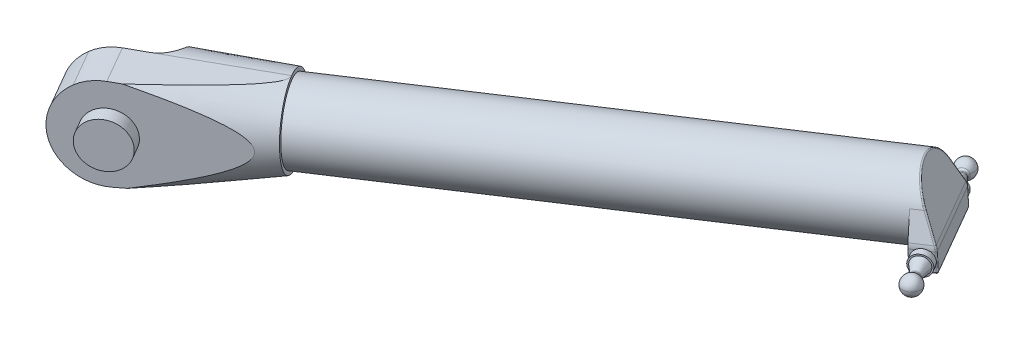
ISO-10303-21;
HEADER;
FILE_DESCRIPTION(('STEP AP214'),'2;1');
FILE_NAME('part.step','',(''),(''),'','','');
FILE_SCHEMA(('AUTOMOTIVE_DESIGN { 1 0 10303 214 1 1 1 1 }'));
ENDSEC;
DATA;
#1=APPLICATION_CONTEXT('core data for automotive mechanical design processes');
#2=APPLICATION_PROTOCOL_DEFINITION('international standard','automotive_design',2000,#1);
#3=PRODUCT_CONTEXT('',#1,'mechanical');
#4=PRODUCT('Part','Part','',(#3));
#5=PRODUCT_RELATED_PRODUCT_CATEGORY('part','',(#4));
#6=PRODUCT_DEFINITION_FORMATION('','',#4);
#7=PRODUCT_DEFINITION_CONTEXT('part definition',#1,'design');
#8=PRODUCT_DEFINITION('design','',#6,#7);
#9=PRODUCT_DEFINITION_SHAPE('','',#8);
#10=(LENGTH_UNIT() NAMED_UNIT(*) SI_UNIT(.MILLI.,.METRE.));
#11=(NAMED_UNIT(*) PLANE_ANGLE_UNIT() SI_UNIT($,.RADIAN.));
#12=(NAMED_UNIT(*) SI_UNIT($,.STERADIAN.) SOLID_ANGLE_UNIT());
#13=UNCERTAINTY_MEASURE_WITH_UNIT(LENGTH_MEASURE(1.E-05),#10,'distance_accuracy_value','');
#14=(GEOMETRIC_REPRESENTATION_CONTEXT(3) GLOBAL_UNCERTAINTY_ASSIGNED_CONTEXT((#13)) GLOBAL_UNIT_ASSIGNED_CONTEXT((#10,
#11,#12)) REPRESENTATION_CONTEXT('',''));
#15=CARTESIAN_POINT('',(0.,0.,0.));
#16=DIRECTION('',(0.,0.,1.));
#17=DIRECTION('',(1.,0.,0.));
#18=AXIS2_PLACEMENT_3D('',#15,#16,#17);
#19=CARTESIAN_POINT('',(521.932720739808,-89.9999999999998,-335.982511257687));
#20=DIRECTION('',(0.5,0.,0.866025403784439));
#21=DIRECTION('',(0.85081590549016,0.186591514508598,-0.491218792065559));
#22=AXIS2_PLACEMENT_3D('',#19,#20,#21);
#23=CYLINDRICAL_SURFACE('',#22,7.);
#24=CARTESIAN_POINT('',(519.432720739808,-89.9999999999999,-340.312638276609));
#25=DIRECTION('',(0.5,0.,0.866025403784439));
#26=DIRECTION('',(0.85081590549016,0.186591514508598,-0.491218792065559));
#27=AXIS2_PLACEMENT_3D('',#24,#25,#26);
#28=CIRCLE('',#27,7.);
#29=CARTESIAN_POINT('',(525.388432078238,-88.6938593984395,-343.751169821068));
#30=VERTEX_POINT('',#29);
#31=CARTESIAN_POINT('',(513.477009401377,-91.3061406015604,-336.87410673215));
#32=VERTEX_POINT('',#31);
#33=EDGE_CURVE('E26',#30,#32,#28,.T.);
#34=ORIENTED_EDGE('',*,*,#33,.T.);
#35=DIRECTION('',(0.5,0.,0.866025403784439));
#36=VECTOR('',#35,1.);
#37=CARTESIAN_POINT('',(515.977009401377,-91.3061406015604,-332.543979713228));
#38=LINE('',#37,#36);
#39=CARTESIAN_POINT('',(515.977009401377,-91.3061406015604,-332.543979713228));
#40=VERTEX_POINT('',#39);
#41=EDGE_CURVE('E39',#32,#40,#38,.T.);
#42=ORIENTED_EDGE('',*,*,#41,.T.);
#43=CARTESIAN_POINT('',(521.932720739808,-89.9999999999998,-335.982511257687));
#44=DIRECTION('',(0.5,0.,0.866025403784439));
#45=DIRECTION('',(0.85081590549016,0.186591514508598,-0.491218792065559));
#46=AXIS2_PLACEMENT_3D('',#43,#44,#45);
#47=CIRCLE('',#46,7.);
#48=CARTESIAN_POINT('',(518.328893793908,-84.3712131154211,-333.901840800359));
#49=VERTEX_POINT('',#48);
#50=EDGE_CURVE('E452',#49,#40,#47,.T.);
#51=ORIENTED_EDGE('',*,*,#50,.F.);
#52=CARTESIAN_POINT('',(521.932720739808,-89.9999999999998,-335.982511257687));
#53=DIRECTION('',(0.5,0.,0.866025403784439));
#54=DIRECTION('',(0.85081590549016,0.186591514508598,-0.491218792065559));
#55=AXIS2_PLACEMENT_3D('',#52,#53,#54);
#56=CIRCLE('',#55,7.);
#57=CARTESIAN_POINT('',(525.118164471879,-84.044280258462,-337.821628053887));
#58=VERTEX_POINT('',#57);
#59=EDGE_CURVE('E637',#58,#49,#56,.T.);
#60=ORIENTED_EDGE('',*,*,#59,.F.);
#61=CARTESIAN_POINT('',(521.932720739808,-89.9999999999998,-335.982511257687));
#62=DIRECTION('',(0.5,0.,0.866025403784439));
#63=DIRECTION('',(0.85081590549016,0.186591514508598,-0.491218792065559));
#64=AXIS2_PLACEMENT_3D('',#61,#62,#63);
#65=CIRCLE('',#64,7.);
#66=CARTESIAN_POINT('',(527.463247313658,-87.1333467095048,-339.17556226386));
#67=VERTEX_POINT('',#66);
#68=EDGE_CURVE('E609',#67,#58,#65,.T.);
#69=ORIENTED_EDGE('',*,*,#68,.F.);
#70=CARTESIAN_POINT('',(521.932720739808,-89.9999999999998,-335.982511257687));
#71=DIRECTION('',(0.5,0.,0.866025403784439));
#72=DIRECTION('',(0.85081590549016,0.186591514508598,-0.491218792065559));
#73=AXIS2_PLACEMENT_3D('',#70,#71,#72);
#74=CIRCLE('',#73,7.);
#75=CARTESIAN_POINT('',(527.888432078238,-88.6938593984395,-339.421042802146));
#76=VERTEX_POINT('',#75);
#77=EDGE_CURVE('E408',#76,#67,#74,.T.);
#78=ORIENTED_EDGE('',*,*,#77,.F.);
#79=DIRECTION('',(0.5,0.,0.866025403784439));
#80=VECTOR('',#79,1.);
#81=CARTESIAN_POINT('',(527.888432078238,-88.6938593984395,-339.421042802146));
#82=LINE('',#81,#80);
#83=EDGE_CURVE('E486',#30,#76,#82,.T.);
#84=ORIENTED_EDGE('',*,*,#83,.F.);
#85=EDGE_LOOP('',(#34,#42,#51,#60,#69,#78,#84));
#86=FACE_BOUND('',#85,.T.);
#87=ADVANCED_FACE('F16',(#86),#23,.T.);
#88=CARTESIAN_POINT('',(514.82094538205,-89.9999999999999,-348.30046750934));
#89=DIRECTION('',(0.5,0.,0.866025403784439));
#90=DIRECTION('',(0.85081590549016,0.186591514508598,-0.491218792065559));
#91=AXIS2_PLACEMENT_3D('',#88,#89,#90);
#92=CONICAL_SURFACE('',#91,3.09252464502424,0.305363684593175);
#93=CARTESIAN_POINT('',(514.82094538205,-89.9999999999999,-348.30046750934));
#94=DIRECTION('',(0.5,0.,0.866025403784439));
#95=DIRECTION('',(0.85081590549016,0.186591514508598,-0.491218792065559));
#96=AXIS2_PLACEMENT_3D('',#93,#94,#95);
#97=CIRCLE('',#96,3.09252464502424);
#98=CARTESIAN_POINT('',(517.452114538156,-89.4229611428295,-349.819573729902));
#99=VERTEX_POINT('',#98);
#100=CARTESIAN_POINT('',(512.189776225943,-90.5770388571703,-346.781361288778));
#101=VERTEX_POINT('',#100);
#102=EDGE_CURVE('E524',#99,#101,#97,.T.);
#103=ORIENTED_EDGE('',*,*,#102,.T.);
#104=DIRECTION('',(0.221079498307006,-0.0560968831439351,0.97364110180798));
#105=VECTOR('',#104,1.);
#106=CARTESIAN_POINT('',(512.189776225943,-90.5770388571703,-346.781361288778));
#107=LINE('',#106,#105);
#108=CARTESIAN_POINT('',(514.327825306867,-91.1195490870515,-337.365325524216));
#109=VERTEX_POINT('',#108);
#110=EDGE_CURVE('E529',#101,#109,#107,.T.);
#111=ORIENTED_EDGE('',*,*,#110,.T.);
#112=CARTESIAN_POINT('',(519.432720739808,-89.9999999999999,-340.312638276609));
#113=DIRECTION('',(0.5,0.,0.866025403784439));
#114=DIRECTION('',(0.85081590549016,0.186591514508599,-0.491218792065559));
#115=AXIS2_PLACEMENT_3D('',#112,#113,#114);
#116=CIRCLE('',#115,6.);
#117=CARTESIAN_POINT('',(524.537616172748,-88.8804509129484,-343.259951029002));
#118=VERTEX_POINT('',#117);
#119=EDGE_CURVE('E456',#118,#109,#116,.T.);
#120=ORIENTED_EDGE('',*,*,#119,.F.);
#121=DIRECTION('',(0.732658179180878,0.0560968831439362,0.678281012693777));
#122=VECTOR('',#121,1.);
#123=CARTESIAN_POINT('',(517.452114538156,-89.4229611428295,-349.819573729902));
#124=LINE('',#123,#122);
#125=EDGE_CURVE('E459',#99,#118,#124,.T.);
#126=ORIENTED_EDGE('',*,*,#125,.F.);
#127=EDGE_LOOP('',(#103,#111,#120,#126));
#128=FACE_BOUND('',#127,.T.);
#129=ADVANCED_FACE('F757',(#128),#92,.T.);
#130=CARTESIAN_POINT('',(514.520305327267,-89.9999999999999,-348.821191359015));
#131=DIRECTION('',(0.5,0.,0.866025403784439));
#132=DIRECTION('',(0.85081590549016,0.186591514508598,-0.491218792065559));
#133=AXIS2_PLACEMENT_3D('',#130,#131,#132);
#134=TOROIDAL_SURFACE('',#133,5.,2.);
#135=CARTESIAN_POINT('',(514.82094538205,-89.9999999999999,-348.30046750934));
#136=DIRECTION('',(0.5,0.,0.866025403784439));
#137=DIRECTION('',(0.85081590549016,0.186591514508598,-0.491218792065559));
#138=AXIS2_PLACEMENT_3D('',#135,#136,#137);
#139=CIRCLE('',#138,3.09252464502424);
#140=EDGE_CURVE('E466',#101,#99,#139,.T.);
#141=ORIENTED_EDGE('',*,*,#140,.F.);
#142=CARTESIAN_POINT('',(510.266225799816,-90.9329575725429,-346.365097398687));
#143=DIRECTION('',(-0.161592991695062,0.982437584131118,0.0932957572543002));
#144=DIRECTION('',(-0.85081590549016,-0.186591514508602,0.491218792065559));
#145=AXIS2_PLACEMENT_3D('',#142,#143,#144);
#146=CIRCLE('',#145,2.);
#147=CARTESIAN_POINT('',(511.967857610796,-90.5597745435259,-347.347534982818));
#148=VERTEX_POINT('',#147);
#149=EDGE_CURVE('E533',#101,#148,#146,.T.);
#150=ORIENTED_EDGE('',*,*,#149,.T.);
#151=CARTESIAN_POINT('',(514.520305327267,-89.9999999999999,-348.821191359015));
#152=DIRECTION('',(0.5,0.,0.866025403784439));
#153=DIRECTION('',(0.85081590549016,0.186591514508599,-0.491218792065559));
#154=AXIS2_PLACEMENT_3D('',#151,#152,#153);
#155=CIRCLE('',#154,3.);
#156=CARTESIAN_POINT('',(517.072753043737,-89.440225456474,-350.294847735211));
#157=VERTEX_POINT('',#156);
#158=EDGE_CURVE('E627',#148,#157,#155,.T.);
#159=ORIENTED_EDGE('',*,*,#158,.T.);
#160=CARTESIAN_POINT('',(518.774384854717,-89.067042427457,-351.277285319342));
#161=DIRECTION('',(0.161592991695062,-0.982437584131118,-0.0932957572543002));
#162=DIRECTION('',(0.85081590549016,0.186591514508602,-0.491218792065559));
#163=AXIS2_PLACEMENT_3D('',#160,#161,#162);
#164=CIRCLE('',#163,2.);
#165=EDGE_CURVE('E465',#99,#157,#164,.T.);
#166=ORIENTED_EDGE('',*,*,#165,.F.);
#167=EDGE_LOOP('',(#141,#150,#159,#166));
#168=FACE_BOUND('',#167,.T.);
#169=ADVANCED_FACE('F753',(#168),#134,.F.);
#170=CARTESIAN_POINT('',(521.932720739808,-89.9999999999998,-335.982511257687));
#171=DIRECTION('',(0.5,0.,0.866025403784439));
#172=DIRECTION('',(0.85081590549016,0.186591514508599,-0.491218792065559));
#173=AXIS2_PLACEMENT_3D('',#170,#171,#172);
#174=CYLINDRICAL_SURFACE('',#173,3.);
#175=CARTESIAN_POINT('',(514.21382192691,-89.9999999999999,-349.35203618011));
#176=DIRECTION('',(0.5,0.,0.866025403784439));
#177=DIRECTION('',(0.85081590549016,0.186591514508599,-0.491218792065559));
#178=AXIS2_PLACEMENT_3D('',#175,#176,#177);
#179=CIRCLE('',#178,3.);
#180=CARTESIAN_POINT('',(516.76626964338,-89.440225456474,-350.825692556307));
#181=VERTEX_POINT('',#180);
#182=CARTESIAN_POINT('',(511.661374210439,-90.5597745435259,-347.878379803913));
#183=VERTEX_POINT('',#182);
#184=EDGE_CURVE('E495',#181,#183,#179,.T.);
#185=ORIENTED_EDGE('',*,*,#184,.T.);
#186=DIRECTION('',(0.5,0.,0.866025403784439));
#187=VECTOR('',#186,1.);
#188=CARTESIAN_POINT('',(519.380273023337,-90.5597745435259,-334.50885488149));
#189=LINE('',#188,#187);
#190=EDGE_CURVE('E492',#183,#148,#189,.T.);
#191=ORIENTED_EDGE('',*,*,#190,.T.);
#192=CARTESIAN_POINT('',(514.520305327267,-89.9999999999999,-348.821191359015));
#193=DIRECTION('',(0.5,0.,0.866025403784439));
#194=DIRECTION('',(0.85081590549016,0.186591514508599,-0.491218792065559));
#195=AXIS2_PLACEMENT_3D('',#192,#193,#194);
#196=CIRCLE('',#195,3.);
#197=EDGE_CURVE('E461',#157,#148,#196,.T.);
#198=ORIENTED_EDGE('',*,*,#197,.F.);
#199=DIRECTION('',(0.5,0.,0.866025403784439));
#200=VECTOR('',#199,1.);
#201=CARTESIAN_POINT('',(524.485168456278,-89.440225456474,-337.456167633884));
#202=LINE('',#201,#200);
#203=EDGE_CURVE('E1174',#181,#157,#202,.T.);
#204=ORIENTED_EDGE('',*,*,#203,.F.);
#205=EDGE_LOOP('',(#185,#191,#198,#204));
#206=FACE_BOUND('',#205,.T.);
#207=ADVANCED_FACE('F756',(#206),#174,.T.);
#208=CARTESIAN_POINT('',(514.21382192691,-89.9999999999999,-349.35203618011));
#209=DIRECTION('',(0.5,0.,0.866025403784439));
#210=DIRECTION('',(0.85081590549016,0.186591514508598,-0.491218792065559));
#211=AXIS2_PLACEMENT_3D('',#208,#209,#210);
#212=TOROIDAL_SURFACE('',#211,5.,2.);
#213=CARTESIAN_POINT('',(514.21382192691,-89.9999999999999,-349.35203618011));
#214=DIRECTION('',(0.5,0.,0.866025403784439));
#215=DIRECTION('',(0.85081590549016,0.186591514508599,-0.491218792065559));
#216=AXIS2_PLACEMENT_3D('',#213,#214,#215);
#217=CIRCLE('',#216,3.);
#218=EDGE_CURVE('E1178',#183,#181,#217,.T.);
#219=ORIENTED_EDGE('',*,*,#218,.F.);
#220=CARTESIAN_POINT('',(509.959742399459,-90.9329575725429,-346.895942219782));
#221=DIRECTION('',(-0.161592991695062,0.982437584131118,0.0932957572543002));
#222=DIRECTION('',(-0.85081590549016,-0.186591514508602,0.491218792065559));
#223=AXIS2_PLACEMENT_3D('',#220,#221,#222);
#224=CIRCLE('',#223,2.);
#225=CARTESIAN_POINT('',(510.195615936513,-90.7067860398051,-348.869064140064));
#226=VERTEX_POINT('',#225);
#227=EDGE_CURVE('E421',#183,#226,#224,.T.);
#228=ORIENTED_EDGE('',*,*,#227,.T.);
#229=CARTESIAN_POINT('',(513.418403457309,-89.9999999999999,-350.729741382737));
#230=DIRECTION('',(0.5,0.,0.866025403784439));
#231=DIRECTION('',(0.85081590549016,0.186591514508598,-0.491218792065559));
#232=AXIS2_PLACEMENT_3D('',#229,#230,#231);
#233=CIRCLE('',#232,3.78787878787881);
#234=CARTESIAN_POINT('',(516.641190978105,-89.2932139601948,-352.590418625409));
#235=VERTEX_POINT('',#234);
#236=EDGE_CURVE('E417',#226,#235,#233,.T.);
#237=ORIENTED_EDGE('',*,*,#236,.T.);
#238=CARTESIAN_POINT('',(518.46790145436,-89.067042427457,-351.808130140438));
#239=DIRECTION('',(0.161592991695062,-0.982437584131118,-0.0932957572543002));
#240=DIRECTION('',(0.85081590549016,0.186591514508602,-0.491218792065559));
#241=AXIS2_PLACEMENT_3D('',#238,#239,#240);
#242=CIRCLE('',#241,2.);
#243=EDGE_CURVE('E1170',#181,#235,#242,.T.);
#244=ORIENTED_EDGE('',*,*,#243,.F.);
#245=EDGE_LOOP('',(#219,#228,#237,#244));
#246=FACE_BOUND('',#245,.T.);
#247=ADVANCED_FACE('F880',(#246),#212,.F.);
#248=CARTESIAN_POINT('',(510.932720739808,-89.9999999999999,-355.035070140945));
#249=DIRECTION('',(0.16159299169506,-0.982437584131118,-0.0932957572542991));
#250=DIRECTION('',(-0.85081590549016,-0.186591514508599,0.491218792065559));
#251=AXIS2_PLACEMENT_3D('',#248,#249,#250);
#252=SPHERICAL_SURFACE('',#251,6.25);
#253=CARTESIAN_POINT('',(510.932720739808,-89.9999999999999,-355.035070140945));
#254=DIRECTION('',(-0.16159299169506,0.982437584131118,0.0932957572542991));
#255=DIRECTION('',(-0.85081590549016,-0.186591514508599,0.491218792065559));
#256=AXIS2_PLACEMENT_3D('',#253,#254,#255);
#257=CIRCLE('',#256,6.25);
#258=CARTESIAN_POINT('',(507.807720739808,-89.9999999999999,-360.447728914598));
#259=VERTEX_POINT('',#258);
#260=EDGE_CURVE('E1167',#259,#226,#257,.T.);
#261=ORIENTED_EDGE('',*,*,#260,.F.);
#262=CARTESIAN_POINT('',(510.932720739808,-89.9999999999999,-355.035070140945));
#263=DIRECTION('',(0.16159299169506,-0.982437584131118,-0.0932957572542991));
#264=DIRECTION('',(0.85081590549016,0.186591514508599,-0.491218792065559));
#265=AXIS2_PLACEMENT_3D('',#262,#263,#264);
#266=CIRCLE('',#265,6.25);
#267=EDGE_CURVE('E422',#259,#235,#266,.T.);
#268=ORIENTED_EDGE('',*,*,#267,.T.);
#269=ORIENTED_EDGE('',*,*,#236,.F.);
#270=EDGE_LOOP('',(#261,#268,#269));
#271=FACE_BOUND('',#270,.T.);
#272=ADVANCED_FACE('F702',(#271),#252,.T.);
#273=CARTESIAN_POINT('',(551.932720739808,-89.9999999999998,-284.020987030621));
#274=DIRECTION('',(-0.5,0.,-0.866025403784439));
#275=DIRECTION('',(0.866021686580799,0.00292993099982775,-0.499997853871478));
#276=AXIS2_PLACEMENT_3D('',#273,#274,#275);
#277=CYLINDRICAL_SURFACE('',#276,7.);
#278=CARTESIAN_POINT('',(554.432720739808,-89.9999999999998,-279.690860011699));
#279=DIRECTION('',(-0.5,0.,-0.866025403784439));
#280=DIRECTION('',(0.866021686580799,0.00292993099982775,-0.499997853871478));
#281=AXIS2_PLACEMENT_3D('',#278,#279,#280);
#282=CIRCLE('',#281,7.);
#283=CARTESIAN_POINT('',(560.494872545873,-89.9794904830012,-283.190844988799));
#284=VERTEX_POINT('',#283);
#285=CARTESIAN_POINT('',(548.370568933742,-90.0205095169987,-276.190875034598));
#286=VERTEX_POINT('',#285);
#287=EDGE_CURVE('E614',#284,#286,#282,.T.);
#288=ORIENTED_EDGE('',*,*,#287,.T.);
#289=DIRECTION('',(-0.5,0.,-0.866025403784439));
#290=VECTOR('',#289,1.);
#291=CARTESIAN_POINT('',(545.870568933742,-90.0205095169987,-280.52100205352));
#292=LINE('',#291,#290);
#293=CARTESIAN_POINT('',(545.870568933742,-90.0205095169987,-280.52100205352));
#294=VERTEX_POINT('',#293);
#295=EDGE_CURVE('E610',#286,#294,#292,.T.);
#296=ORIENTED_EDGE('',*,*,#295,.T.);
#297=CARTESIAN_POINT('',(551.932720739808,-89.9999999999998,-284.020987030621));
#298=DIRECTION('',(-0.5,0.,-0.866025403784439));
#299=DIRECTION('',(0.866021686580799,0.00292993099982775,-0.499997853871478));
#300=AXIS2_PLACEMENT_3D('',#297,#298,#299);
#301=CIRCLE('',#300,7.);
#302=CARTESIAN_POINT('',(549.919223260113,-96.602608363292,-282.858493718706));
#303=VERTEX_POINT('',#302);
#304=EDGE_CURVE('E544',#303,#294,#301,.T.);
#305=ORIENTED_EDGE('',*,*,#304,.F.);
#306=CARTESIAN_POINT('',(551.932720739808,-89.9999999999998,-284.020987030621));
#307=DIRECTION('',(-0.5,0.,-0.866025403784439));
#308=DIRECTION('',(0.866021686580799,0.00292993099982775,-0.499997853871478));
#309=AXIS2_PLACEMENT_3D('',#306,#307,#308);
#310=CIRCLE('',#309,7.);
#311=CARTESIAN_POINT('',(554.415315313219,-96.3861020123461,-285.454313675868));
#312=VERTEX_POINT('',#311);
#313=EDGE_CURVE('E536',#312,#303,#310,.T.);
#314=ORIENTED_EDGE('',*,*,#313,.F.);
#315=CARTESIAN_POINT('',(551.932720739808,-89.9999999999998,-284.020987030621));
#316=DIRECTION('',(-0.5,0.,-0.866025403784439));
#317=DIRECTION('',(0.866021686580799,0.00292993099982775,-0.499997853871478));
#318=AXIS2_PLACEMENT_3D('',#315,#316,#317);
#319=CIRCLE('',#318,7.);
#320=CARTESIAN_POINT('',(557.650747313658,-92.3249866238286,-287.322291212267));
#321=VERTEX_POINT('',#320);
#322=EDGE_CURVE('E427',#321,#312,#319,.T.);
#323=ORIENTED_EDGE('',*,*,#322,.F.);
#324=CARTESIAN_POINT('',(551.932720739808,-89.9999999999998,-284.020987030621));
#325=DIRECTION('',(-0.5,0.,-0.866025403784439));
#326=DIRECTION('',(0.866021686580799,0.00292993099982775,-0.499997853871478));
#327=AXIS2_PLACEMENT_3D('',#324,#325,#326);
#328=CIRCLE('',#327,7.);
#329=CARTESIAN_POINT('',(557.994872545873,-89.9794904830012,-287.520972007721));
#330=VERTEX_POINT('',#329);
#331=EDGE_CURVE('E507',#330,#321,#328,.T.);
#332=ORIENTED_EDGE('',*,*,#331,.F.);
#333=DIRECTION('',(-0.5,0.,-0.866025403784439));
#334=VECTOR('',#333,1.);
#335=CARTESIAN_POINT('',(557.994872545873,-89.9794904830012,-287.520972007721));
#336=LINE('',#335,#334);
#337=EDGE_CURVE('E397',#284,#330,#336,.T.);
#338=ORIENTED_EDGE('',*,*,#337,.F.);
#339=EDGE_LOOP('',(#288,#296,#305,#314,#323,#332,#338));
#340=FACE_BOUND('',#339,.T.);
#341=ADVANCED_FACE('F699',(#340),#277,.T.);
#342=CARTESIAN_POINT('',(559.044496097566,-89.9999999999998,-271.703030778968));
#343=DIRECTION('',(-0.5,0.,-0.866025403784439));
#344=DIRECTION('',(0.866021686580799,0.00292993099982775,-0.499997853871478));
#345=AXIS2_PLACEMENT_3D('',#342,#343,#344);
#346=CONICAL_SURFACE('',#345,3.09252464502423,0.305363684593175);
#347=CARTESIAN_POINT('',(559.044496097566,-89.9999999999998,-271.703030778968));
#348=DIRECTION('',(-0.5,0.,-0.866025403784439));
#349=DIRECTION('',(0.866021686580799,0.00292993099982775,-0.499997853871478));
#350=AXIS2_PLACEMENT_3D('',#347,#348,#349);
#351=CIRCLE('',#350,3.09252464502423);
#352=CARTESIAN_POINT('',(561.722689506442,-89.9909391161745,-273.249286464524));
#353=VERTEX_POINT('',#352);
#354=CARTESIAN_POINT('',(556.366302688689,-90.0090608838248,-270.156775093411));
#355=VERTEX_POINT('',#354);
#356=EDGE_CURVE('E615',#353,#355,#351,.T.);
#357=ORIENTED_EDGE('',*,*,#356,.T.);
#358=DIRECTION('',(-0.737229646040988,-0.00088085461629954,-0.675641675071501));
#359=VECTOR('',#358,1.);
#360=CARTESIAN_POINT('',(556.366302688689,-90.0090608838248,-270.156775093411));
#361=LINE('',#360,#359);
#362=CARTESIAN_POINT('',(549.236590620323,-90.017579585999,-276.690872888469));
#363=VERTEX_POINT('',#362);
#364=EDGE_CURVE('E375',#355,#363,#361,.T.);
#365=ORIENTED_EDGE('',*,*,#364,.T.);
#366=CARTESIAN_POINT('',(554.432720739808,-89.9999999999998,-279.690860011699));
#367=DIRECTION('',(-0.5,0.,-0.866025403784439));
#368=DIRECTION('',(0.866021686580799,0.00292993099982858,-0.499997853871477));
#369=AXIS2_PLACEMENT_3D('',#366,#367,#368);
#370=CIRCLE('',#369,6.);
#371=CARTESIAN_POINT('',(559.628850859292,-89.9824204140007,-282.690847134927));
#372=VERTEX_POINT('',#371);
#373=EDGE_CURVE('E368',#372,#363,#370,.T.);
#374=ORIENTED_EDGE('',*,*,#373,.F.);
#375=DIRECTION('',(-0.216508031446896,0.000880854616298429,-0.976280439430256));
#376=VECTOR('',#375,1.);
#377=CARTESIAN_POINT('',(561.722689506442,-89.9909391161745,-273.249286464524));
#378=LINE('',#377,#376);
#379=EDGE_CURVE('E372',#353,#372,#378,.T.);
#380=ORIENTED_EDGE('',*,*,#379,.F.);
#381=EDGE_LOOP('',(#357,#365,#374,#380));
#382=FACE_BOUND('',#381,.T.);
#383=ADVANCED_FACE('F371',(#382),#346,.T.);
#384=CARTESIAN_POINT('',(559.345136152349,-89.9999999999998,-271.182306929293));
#385=DIRECTION('',(-0.5,0.,-0.866025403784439));
#386=DIRECTION('',(0.866021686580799,0.00292993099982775,-0.499997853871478));
#387=AXIS2_PLACEMENT_3D('',#384,#385,#386);
#388=TOROIDAL_SURFACE('',#387,5.,2.);
#389=CARTESIAN_POINT('',(559.044496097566,-89.9999999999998,-271.703030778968));
#390=DIRECTION('',(-0.5,0.,-0.866025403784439));
#391=DIRECTION('',(0.866021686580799,0.00292993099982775,-0.499997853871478));
#392=AXIS2_PLACEMENT_3D('',#389,#390,#391);
#393=CIRCLE('',#392,3.09252464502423);
#394=EDGE_CURVE('E384',#355,#353,#393,.T.);
#395=ORIENTED_EDGE('',*,*,#394,.F.);
#396=CARTESIAN_POINT('',(555.015027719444,-90.0146496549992,-268.682317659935));
#397=DIRECTION('',(0.00253739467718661,-0.999995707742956,-0.00146496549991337));
#398=DIRECTION('',(0.866021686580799,0.00292993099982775,-0.499997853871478));
#399=AXIS2_PLACEMENT_3D('',#396,#397,#398);
#400=CIRCLE('',#399,2.);
#401=CARTESIAN_POINT('',(556.747071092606,-90.0087897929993,-269.682313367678));
#402=VERTEX_POINT('',#401);
#403=EDGE_CURVE('E621',#355,#402,#400,.T.);
#404=ORIENTED_EDGE('',*,*,#403,.T.);
#405=CARTESIAN_POINT('',(559.345136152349,-89.9999999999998,-271.182306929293));
#406=DIRECTION('',(-0.5,0.,-0.866025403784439));
#407=DIRECTION('',(0.866021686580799,0.00292993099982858,-0.499997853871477));
#408=AXIS2_PLACEMENT_3D('',#405,#406,#407);
#409=CIRCLE('',#408,3.);
#410=CARTESIAN_POINT('',(561.943201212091,-89.9912102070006,-272.682300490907));
#411=VERTEX_POINT('',#410);
#412=EDGE_CURVE('E595',#402,#411,#409,.T.);
#413=ORIENTED_EDGE('',*,*,#412,.T.);
#414=CARTESIAN_POINT('',(563.675244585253,-89.9853503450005,-273.68229619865));
#415=DIRECTION('',(-0.00253739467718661,0.999995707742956,0.00146496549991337));
#416=DIRECTION('',(-0.866021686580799,-0.00292993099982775,0.499997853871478));
#417=AXIS2_PLACEMENT_3D('',#414,#415,#416);
#418=CIRCLE('',#417,2.);
#419=EDGE_CURVE('E600',#353,#411,#418,.T.);
#420=ORIENTED_EDGE('',*,*,#419,.F.);
#421=EDGE_LOOP('',(#395,#404,#413,#420));
#422=FACE_BOUND('',#421,.T.);
#423=ADVANCED_FACE('F773',(#422),#388,.F.);
#424=CARTESIAN_POINT('',(551.932720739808,-89.9999999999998,-284.020987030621));
#425=DIRECTION('',(-0.5,0.,-0.866025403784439));
#426=DIRECTION('',(0.866021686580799,0.00292993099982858,-0.499997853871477));
#427=AXIS2_PLACEMENT_3D('',#424,#425,#426);
#428=CYLINDRICAL_SURFACE('',#427,3.);
#429=CARTESIAN_POINT('',(559.651619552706,-89.9999999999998,-270.651462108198));
#430=DIRECTION('',(-0.5,0.,-0.866025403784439));
#431=DIRECTION('',(0.866021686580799,0.00292993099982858,-0.499997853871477));
#432=AXIS2_PLACEMENT_3D('',#429,#430,#431);
#433=CIRCLE('',#432,3.);
#434=CARTESIAN_POINT('',(562.249684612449,-89.9912102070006,-272.151455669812));
#435=VERTEX_POINT('',#434);
#436=CARTESIAN_POINT('',(557.053554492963,-90.0087897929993,-269.151468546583));
#437=VERTEX_POINT('',#436);
#438=EDGE_CURVE('E591',#435,#437,#433,.T.);
#439=ORIENTED_EDGE('',*,*,#438,.T.);
#440=DIRECTION('',(-0.5,0.,-0.866025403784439));
#441=VECTOR('',#440,1.);
#442=CARTESIAN_POINT('',(549.334655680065,-90.0087897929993,-282.520993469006));
#443=LINE('',#442,#441);
#444=EDGE_CURVE('E596',#437,#402,#443,.T.);
#445=ORIENTED_EDGE('',*,*,#444,.T.);
#446=CARTESIAN_POINT('',(559.345136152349,-89.9999999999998,-271.182306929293));
#447=DIRECTION('',(-0.5,0.,-0.866025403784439));
#448=DIRECTION('',(0.866021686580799,0.00292993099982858,-0.499997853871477));
#449=AXIS2_PLACEMENT_3D('',#446,#447,#448);
#450=CIRCLE('',#449,3.);
#451=EDGE_CURVE('E604',#411,#402,#450,.T.);
#452=ORIENTED_EDGE('',*,*,#451,.F.);
#453=DIRECTION('',(-0.5,0.,-0.866025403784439));
#454=VECTOR('',#453,1.);
#455=CARTESIAN_POINT('',(554.53078579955,-89.9912102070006,-285.520980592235));
#456=LINE('',#455,#454);
#457=EDGE_CURVE('E555',#435,#411,#456,.T.);
#458=ORIENTED_EDGE('',*,*,#457,.F.);
#459=EDGE_LOOP('',(#439,#445,#452,#458));
#460=FACE_BOUND('',#459,.T.);
#461=ADVANCED_FACE('F769',(#460),#428,.T.);
#462=CARTESIAN_POINT('',(559.651619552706,-89.9999999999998,-270.651462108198));
#463=DIRECTION('',(-0.5,0.,-0.866025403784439));
#464=DIRECTION('',(0.866021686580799,0.00292993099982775,-0.499997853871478));
#465=AXIS2_PLACEMENT_3D('',#462,#463,#464);
#466=TOROIDAL_SURFACE('',#465,5.,2.);
#467=CARTESIAN_POINT('',(559.651619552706,-89.9999999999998,-270.651462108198));
#468=DIRECTION('',(-0.5,0.,-0.866025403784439));
#469=DIRECTION('',(0.866021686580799,0.00292993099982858,-0.499997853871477));
#470=AXIS2_PLACEMENT_3D('',#467,#468,#469);
#471=CIRCLE('',#470,3.);
#472=EDGE_CURVE('E550',#437,#435,#471,.T.);
#473=ORIENTED_EDGE('',*,*,#472,.F.);
#474=CARTESIAN_POINT('',(555.321511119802,-90.0146496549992,-268.15147283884));
#475=DIRECTION('',(0.00253739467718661,-0.999995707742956,-0.00146496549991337));
#476=DIRECTION('',(0.866021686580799,0.00292993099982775,-0.499997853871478));
#477=AXIS2_PLACEMENT_3D('',#474,#475,#476);
#478=CIRCLE('',#477,2.);
#479=CARTESIAN_POINT('',(557.166652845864,-90.0110982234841,-267.379825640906));
#480=VERTEX_POINT('',#479);
#481=EDGE_CURVE('E512',#437,#480,#478,.T.);
#482=ORIENTED_EDGE('',*,*,#481,.T.);
#483=CARTESIAN_POINT('',(560.447038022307,-89.9999999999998,-269.273756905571));
#484=DIRECTION('',(-0.5,0.,-0.866025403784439));
#485=DIRECTION('',(0.866021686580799,0.00292993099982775,-0.499997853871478));
#486=AXIS2_PLACEMENT_3D('',#483,#484,#485);
#487=CIRCLE('',#486,3.78787878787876);
#488=CARTESIAN_POINT('',(563.727423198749,-89.9889017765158,-271.167688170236));
#489=VERTEX_POINT('',#488);
#490=EDGE_CURVE('E508',#480,#489,#487,.T.);
#491=ORIENTED_EDGE('',*,*,#490,.T.);
#492=CARTESIAN_POINT('',(563.98172798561,-89.9853503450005,-273.151451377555));
#493=DIRECTION('',(-0.00253739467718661,0.999995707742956,0.00146496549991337));
#494=DIRECTION('',(-0.866021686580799,-0.00292993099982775,0.499997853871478));
#495=AXIS2_PLACEMENT_3D('',#492,#493,#494);
#496=CIRCLE('',#495,2.);
#497=EDGE_CURVE('E401',#435,#489,#496,.T.);
#498=ORIENTED_EDGE('',*,*,#497,.F.);
#499=EDGE_LOOP('',(#473,#482,#491,#498));
#500=FACE_BOUND('',#499,.T.);
#501=ADVANCED_FACE('F772',(#500),#466,.F.);
#502=CARTESIAN_POINT('',(562.932720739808,-89.9999999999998,-264.968428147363));
#503=DIRECTION('',(-0.00253739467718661,0.999995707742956,0.00146496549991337));
#504=DIRECTION('',(-0.866021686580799,-0.00292993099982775,0.499997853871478));
#505=AXIS2_PLACEMENT_3D('',#502,#503,#504);
#506=SPHERICAL_SURFACE('',#505,6.25);
#507=CARTESIAN_POINT('',(562.932720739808,-89.9999999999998,-264.968428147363));
#508=DIRECTION('',(0.00253739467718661,-0.999995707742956,-0.00146496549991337));
#509=DIRECTION('',(0.866021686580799,0.00292993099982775,-0.499997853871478));
#510=AXIS2_PLACEMENT_3D('',#507,#508,#509);
#511=CIRCLE('',#510,6.25);
#512=CARTESIAN_POINT('',(566.057720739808,-89.9999999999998,-259.55576937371));
#513=VERTEX_POINT('',#512);
#514=EDGE_CURVE('E413',#513,#480,#511,.T.);
#515=ORIENTED_EDGE('',*,*,#514,.F.);
#516=CARTESIAN_POINT('',(562.932720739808,-89.9999999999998,-264.968428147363));
#517=DIRECTION('',(-0.00253739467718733,0.999995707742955,0.00146496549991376));
#518=DIRECTION('',(-0.866021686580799,-0.00292993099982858,0.499997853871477));
#519=AXIS2_PLACEMENT_3D('',#516,#517,#518);
#520=CIRCLE('',#519,6.25);
#521=EDGE_CURVE('E513',#513,#489,#520,.T.);
#522=ORIENTED_EDGE('',*,*,#521,.T.);
#523=ORIENTED_EDGE('',*,*,#490,.F.);
#524=EDGE_LOOP('',(#515,#522,#523));
#525=FACE_BOUND('',#524,.T.);
#526=ADVANCED_FACE('F858',(#525),#506,.T.);
#527=CARTESIAN_POINT('',(432868.366282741,20746.1505888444,-249916.671295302));
#528=DIRECTION('',(-0.865273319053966,-0.0416666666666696,0.499565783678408));
#529=DIRECTION('',(-0.5,0.,-0.866025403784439));
#530=AXIS2_PLACEMENT_3D('',#527,#528,#529);
#531=CYLINDRICAL_SURFACE('',#530,25.);
#532=CARTESIAN_POINT('',(248.913466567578,-86.3541666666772,-143.713755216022));
#533=DIRECTION('',(0.865273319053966,0.0416666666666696,-0.499565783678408));
#534=DIRECTION('',(-0.0360843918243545,0.999131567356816,0.0208333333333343));
#535=AXIS2_PLACEMENT_3D('',#532,#533,#534);
#536=CIRCLE('',#535,25.);
#537=CARTESIAN_POINT('',(248.011356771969,-61.3758774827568,-143.192921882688));
#538=VERTEX_POINT('',#537);
#539=EDGE_CURVE('E10',#538,#538,#536,.F.);
#540=ORIENTED_EDGE('',*,*,#539,.F.);
#541=EDGE_LOOP('',(#540));
#542=FACE_BOUND('',#541,.T.);
#543=CARTESIAN_POINT('',(529.811693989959,-72.8276975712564,-305.890422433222));
#544=DIRECTION('',(0.865273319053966,0.0416666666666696,-0.499565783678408));
#545=DIRECTION('',(0.5,0.,0.866025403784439));
#546=AXIS2_PLACEMENT_3D('',#543,#544,#545);
#547=CIRCLE('',#546,25.);
#548=CARTESIAN_POINT('',(542.311693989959,-72.8276975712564,-284.239787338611));
#549=VERTEX_POINT('',#548);
#550=CARTESIAN_POINT('',(530.713803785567,-97.8059867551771,-306.411255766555));
#551=VERTEX_POINT('',#550);
#552=EDGE_CURVE('E540',#549,#551,#547,.T.);
#553=ORIENTED_EDGE('',*,*,#552,.F.);
#554=DIRECTION('',(-0.865273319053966,-0.0416666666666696,0.499565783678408));
#555=VECTOR('',#554,1.);
#556=CARTESIAN_POINT('',(432880.866282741,20746.1505888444,-249895.020660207));
#557=LINE('',#556,#555);
#558=CARTESIAN_POINT('',(348.039554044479,-82.182744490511,-172.076715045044));
#559=VERTEX_POINT('',#558);
#560=EDGE_CURVE('E564',#549,#559,#557,.T.);
#561=ORIENTED_EDGE('',*,*,#560,.T.);
#562=ORIENTED_EDGE('',*,*,#560,.F.);
#563=CARTESIAN_POINT('',(529.811693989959,-72.8276975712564,-305.890422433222));
#564=DIRECTION('',(0.865273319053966,0.0416666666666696,-0.499565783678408));
#565=DIRECTION('',(0.5,0.,0.866025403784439));
#566=AXIS2_PLACEMENT_3D('',#563,#564,#565);
#567=CIRCLE('',#566,25.);
#568=CARTESIAN_POINT('',(541.308757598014,-64.561195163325,-285.287450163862));
#569=VERTEX_POINT('',#568);
#570=EDGE_CURVE('E546',#569,#549,#567,.T.);
#571=ORIENTED_EDGE('',*,*,#570,.F.);
#572=DIRECTION('',(0.865273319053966,0.0416666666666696,-0.499565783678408));
#573=VECTOR('',#572,1.);
#574=CARTESIAN_POINT('',(541.308757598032,-64.5611951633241,-285.287450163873));
#575=LINE('',#574,#573);
#576=CARTESIAN_POINT('',(547.716278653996,-64.2526452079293,-288.986834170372));
#577=VERTEX_POINT('',#576);
#578=EDGE_CURVE('E835',#569,#577,#575,.T.);
#579=ORIENTED_EDGE('',*,*,#578,.T.);
#580=CARTESIAN_POINT('',(524.125049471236,-64.2526452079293,-329.848041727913));
#581=CARTESIAN_POINT('',(523.729588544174,-61.8648943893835,-328.637614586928));
#582=CARTESIAN_POINT('',(523.567393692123,-59.6080239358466,-327.127050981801));
#583=CARTESIAN_POINT('',(523.724545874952,-55.5664496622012,-323.646672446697));
#584=CARTESIAN_POINT('',(524.043902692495,-53.7825536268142,-321.677481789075));
#585=CARTESIAN_POINT('',(525.13423610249,-50.8557950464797,-317.465721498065));
#586=CARTESIAN_POINT('',(525.905049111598,-49.7133716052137,-315.223783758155));
#587=CARTESIAN_POINT('',(527.825699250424,-48.177545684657,-310.677988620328));
#588=CARTESIAN_POINT('',(528.975248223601,-47.7843736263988,-308.374813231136));
#589=CARTESIAN_POINT('',(531.545016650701,-47.7843736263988,-303.923843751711));
#590=CARTESIAN_POINT('',(532.964850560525,-48.1775456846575,-301.776717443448));
#591=CARTESIAN_POINT('',(535.941299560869,-49.7133716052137,-297.840488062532));
#592=CARTESIAN_POINT('',(537.497468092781,-50.8557950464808,-296.051975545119));
#593=CARTESIAN_POINT('',(540.599792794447,-53.782553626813,-293.001838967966));
#594=CARTESIAN_POINT('',(542.145483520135,-55.5664496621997,-291.740672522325));
#595=CARTESIAN_POINT('',(545.081003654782,-59.608023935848,-289.864385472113));
#596=CARTESIAN_POINT('',(546.470287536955,-61.8648943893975,-289.249568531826));
#597=CARTESIAN_POINT('',(547.716278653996,-64.2526452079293,-288.986834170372));
#598=(BOUNDED_CURVE() B_SPLINE_CURVE(3,(#580,#581,#582,#583,#584,#585,#586,#587,#588,#589,#590,
#591,#592,#593,#594,#595,#596,#597),.UNSPECIFIED.,.F.,.F.) B_SPLINE_CURVE_WITH_KNOTS((4,2,2,2,2,
2,2,2,4),(1.90810380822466,2.21647601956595,2.52484823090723,2.83322044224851,3.14159265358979,
3.44996486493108,3.75833707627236,4.06670928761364,4.37508149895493),
.UNSPECIFIED.) CURVE() GEOMETRIC_REPRESENTATION_ITEM() RATIONAL_B_SPLINE_CURVE((1.,1.,1.,1.,1.,
1.,1.,1.,1.,1.,1.,1.,1.,1.,1.,1.,1.,1.)) REPRESENTATION_ITEM(''));
#599=CARTESIAN_POINT('',(524.125049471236,-64.2526452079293,-329.848041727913));
#600=VERTEX_POINT('',#599);
#601=EDGE_CURVE('E665',#577,#600,#598,.F.);
#602=ORIENTED_EDGE('',*,*,#601,.T.);
#603=DIRECTION('',(0.865273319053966,0.0416666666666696,-0.499565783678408));
#604=VECTOR('',#603,1.);
#605=CARTESIAN_POINT('',(517.717528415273,-64.5611951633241,-326.148657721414));
#606=LINE('',#605,#604);
#607=CARTESIAN_POINT('',(517.717528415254,-64.5611951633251,-326.148657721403));
#608=VERTEX_POINT('',#607);
#609=EDGE_CURVE('E571',#608,#600,#606,.T.);
#610=ORIENTED_EDGE('',*,*,#609,.F.);
#611=CARTESIAN_POINT('',(529.811693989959,-72.8276975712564,-305.890422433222));
#612=DIRECTION('',(0.865273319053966,0.0416666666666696,-0.499565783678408));
#613=DIRECTION('',(0.5,0.,0.866025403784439));
#614=AXIS2_PLACEMENT_3D('',#611,#612,#613);
#615=CIRCLE('',#614,25.);
#616=CARTESIAN_POINT('',(517.311693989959,-72.8276975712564,-327.541057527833));
#617=VERTEX_POINT('',#616);
#618=EDGE_CURVE('E1101',#617,#608,#615,.T.);
#619=ORIENTED_EDGE('',*,*,#618,.F.);
#620=DIRECTION('',(-0.865273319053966,-0.0416666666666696,0.499565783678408));
#621=VECTOR('',#620,1.);
#622=CARTESIAN_POINT('',(432855.866282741,20746.1505888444,-249938.321930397));
#623=LINE('',#622,#621);
#624=CARTESIAN_POINT('',(323.039554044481,-82.1827444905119,-215.377985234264));
#625=VERTEX_POINT('',#624);
#626=EDGE_CURVE('E838',#617,#625,#623,.T.);
#627=ORIENTED_EDGE('',*,*,#626,.T.);
#628=ORIENTED_EDGE('',*,*,#626,.F.);
#629=CARTESIAN_POINT('',(529.811693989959,-72.8276975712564,-305.890422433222));
#630=DIRECTION('',(0.865273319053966,0.0416666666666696,-0.499565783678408));
#631=DIRECTION('',(0.5,0.,0.866025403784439));
#632=AXIS2_PLACEMENT_3D('',#629,#630,#631);
#633=CIRCLE('',#632,25.);
#634=EDGE_CURVE('E1090',#551,#617,#633,.T.);
#635=ORIENTED_EDGE('',*,*,#634,.F.);
#636=EDGE_LOOP('',(#553,#561,#562,#571,#579,#602,#610,#619,#627,#628,#635));
#637=FACE_BOUND('',#636,.T.);
#638=ADVANCED_FACE('F848',(#542,#637),#531,.T.);
#639=CARTESIAN_POINT('',(529.811693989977,-72.8276975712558,-305.890422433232));
#640=DIRECTION('',(0.865273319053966,0.0416666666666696,-0.499565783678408));
#641=DIRECTION('',(0.5,0.,0.866025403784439));
#642=AXIS2_PLACEMENT_3D('',#639,#640,#641);
#643=PLANE('',#642);
#644=DIRECTION('',(0.5,0.,0.866025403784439));
#645=VECTOR('',#644,1.);
#646=CARTESIAN_POINT('',(515.713803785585,-97.805986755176,-332.392017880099));
#647=LINE('',#646,#645);
#648=CARTESIAN_POINT('',(516.213803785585,-97.805986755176,-331.525992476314));
#649=VERTEX_POINT('',#648);
#650=EDGE_CURVE('E842',#649,#551,#647,.T.);
#651=ORIENTED_EDGE('',*,*,#650,.T.);
#652=ORIENTED_EDGE('',*,*,#634,.T.);
#653=ORIENTED_EDGE('',*,*,#618,.T.);
#654=DIRECTION('',(-0.131422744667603,-0.942829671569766,-0.306268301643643));
#655=VECTOR('',#654,1.);
#656=CARTESIAN_POINT('',(515.17253790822,-82.8190132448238,-332.079517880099));
#657=LINE('',#656,#655);
#658=CARTESIAN_POINT('',(515.396313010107,-81.2136457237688,-331.558031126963));
#659=VERTEX_POINT('',#658);
#660=EDGE_CURVE('E1105',#608,#659,#657,.T.);
#661=ORIENTED_EDGE('',*,*,#660,.T.);
#662=CARTESIAN_POINT('',(520.233979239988,-84.5202466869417,-323.45473701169));
#663=DIRECTION('',(-0.865273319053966,-0.0416666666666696,0.499565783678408));
#664=DIRECTION('',(-0.499999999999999,0.,-0.866025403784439));
#665=AXIS2_PLACEMENT_3D('',#662,#663,#664);
#666=CIRCLE('',#665,10.);
#667=CARTESIAN_POINT('',(515.233979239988,-84.5202466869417,-332.114991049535));
#668=VERTEX_POINT('',#667);
#669=EDGE_CURVE('E502',#659,#668,#666,.T.);
#670=ORIENTED_EDGE('',*,*,#669,.T.);
#671=DIRECTION('',(0.0360843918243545,-0.999131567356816,-0.0208333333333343));
#672=VECTOR('',#671,1.);
#673=CARTESIAN_POINT('',(515.713803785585,-97.805986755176,-332.392017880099));
#674=LINE('',#673,#672);
#675=CARTESIAN_POINT('',(515.677719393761,-96.8068551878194,-332.371184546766));
#676=VERTEX_POINT('',#675);
#677=EDGE_CURVE('E498',#668,#676,#674,.T.);
#678=ORIENTED_EDGE('',*,*,#677,.T.);
#679=CARTESIAN_POINT('',(516.177719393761,-96.8068551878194,-331.505159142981));
#680=DIRECTION('',(-0.865273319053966,-0.0416666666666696,0.499565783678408));
#681=DIRECTION('',(-0.5,0.,-0.866025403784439));
#682=AXIS2_PLACEMENT_3D('',#679,#680,#681);
#683=CIRCLE('',#682,1.);
#684=EDGE_CURVE('E503',#676,#649,#683,.T.);
#685=ORIENTED_EDGE('',*,*,#684,.T.);
#686=EDGE_LOOP('',(#651,#652,#653,#661,#670,#678,#685));
#687=FACE_BOUND('',#686,.T.);
#688=ADVANCED_FACE('F857',(#687),#643,.F.);
#689=CARTESIAN_POINT('',(551.932720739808,-89.9999999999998,-284.020987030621));
#690=DIRECTION('',(0.5,0.,0.866025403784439));
#691=DIRECTION('',(0.0360843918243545,-0.999131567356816,-0.0208333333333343));
#692=AXIS2_PLACEMENT_3D('',#689,#690,#691);
#693=PLANE('',#692);
#694=ORIENTED_EDGE('',*,*,#313,.T.);
#695=DIRECTION('',(0.865273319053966,0.0416666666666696,-0.499565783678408));
#696=VECTOR('',#695,1.);
#697=CARTESIAN_POINT('',(545.677719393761,-96.8068551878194,-280.409660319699));
#698=LINE('',#697,#696);
#699=EDGE_CURVE('E560',#303,#312,#698,.T.);
#700=ORIENTED_EDGE('',*,*,#699,.T.);
#701=EDGE_LOOP('',(#694,#700));
#702=FACE_BOUND('',#701,.T.);
#703=ADVANCED_FACE('F870',(#702),#693,.F.);
#704=CARTESIAN_POINT('',(551.932720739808,-89.9999999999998,-284.020987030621));
#705=DIRECTION('',(0.5,0.,0.866025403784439));
#706=DIRECTION('',(0.0360843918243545,-0.999131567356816,-0.0208333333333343));
#707=AXIS2_PLACEMENT_3D('',#704,#705,#706);
#708=PLANE('',#707);
#709=CARTESIAN_POINT('',(551.932720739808,-89.9999999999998,-284.020987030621));
#710=DIRECTION('',(-0.5,0.,-0.866025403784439));
#711=DIRECTION('',(0.866021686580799,0.00292993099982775,-0.499997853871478));
#712=AXIS2_PLACEMENT_3D('',#709,#710,#711);
#713=CIRCLE('',#712,7.);
#714=CARTESIAN_POINT('',(557.463247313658,-87.1333467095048,-287.214038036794));
#715=VERTEX_POINT('',#714);
#716=EDGE_CURVE('E556',#715,#330,#713,.T.);
#717=ORIENTED_EDGE('',*,*,#716,.T.);
#718=ORIENTED_EDGE('',*,*,#331,.T.);
#719=DIRECTION('',(-0.0360843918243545,0.999131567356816,0.0208333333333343));
#720=VECTOR('',#719,1.);
#721=CARTESIAN_POINT('',(557.349990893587,-83.9974184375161,-287.148649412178));
#722=LINE('',#721,#720);
#723=EDGE_CURVE('E416',#321,#715,#722,.T.);
#724=ORIENTED_EDGE('',*,*,#723,.T.);
#725=EDGE_LOOP('',(#717,#718,#724));
#726=FACE_BOUND('',#725,.T.);
#727=ADVANCED_FACE('F873',(#726),#708,.F.);
#728=CARTESIAN_POINT('',(562.932720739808,-89.9999999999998,-264.968428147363));
#729=DIRECTION('',(-0.00253739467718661,0.999995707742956,0.00146496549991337));
#730=DIRECTION('',(-0.866021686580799,-0.00292993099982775,0.499997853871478));
#731=AXIS2_PLACEMENT_3D('',#728,#729,#730);
#732=SPHERICAL_SURFACE('',#731,6.25);
#733=ORIENTED_EDGE('',*,*,#521,.F.);
#734=ORIENTED_EDGE('',*,*,#514,.T.);
#735=CARTESIAN_POINT('',(560.447038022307,-89.9999999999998,-269.273756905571));
#736=DIRECTION('',(-0.5,0.,-0.866025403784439));
#737=DIRECTION('',(0.866021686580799,0.00292993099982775,-0.499997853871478));
#738=AXIS2_PLACEMENT_3D('',#735,#736,#737);
#739=CIRCLE('',#738,3.78787878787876);
#740=EDGE_CURVE('E554',#489,#480,#739,.T.);
#741=ORIENTED_EDGE('',*,*,#740,.F.);
#742=EDGE_LOOP('',(#733,#734,#741));
#743=FACE_BOUND('',#742,.T.);
#744=ADVANCED_FACE('F904',(#743),#732,.T.);
#745=CARTESIAN_POINT('',(559.651619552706,-89.9999999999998,-270.651462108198));
#746=DIRECTION('',(-0.5,0.,-0.866025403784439));
#747=DIRECTION('',(0.866021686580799,0.00292993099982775,-0.499997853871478));
#748=AXIS2_PLACEMENT_3D('',#745,#746,#747);
#749=TOROIDAL_SURFACE('',#748,5.,2.);
#750=ORIENTED_EDGE('',*,*,#481,.F.);
#751=ORIENTED_EDGE('',*,*,#438,.F.);
#752=ORIENTED_EDGE('',*,*,#497,.T.);
#753=ORIENTED_EDGE('',*,*,#740,.T.);
#754=EDGE_LOOP('',(#750,#751,#752,#753));
#755=FACE_BOUND('',#754,.T.);
#756=ADVANCED_FACE('F885',(#755),#749,.F.);
#757=CARTESIAN_POINT('',(551.932720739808,-89.9999999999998,-284.020987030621));
#758=DIRECTION('',(-0.5,0.,-0.866025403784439));
#759=DIRECTION('',(0.866021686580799,0.00292993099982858,-0.499997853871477));
#760=AXIS2_PLACEMENT_3D('',#757,#758,#759);
#761=CYLINDRICAL_SURFACE('',#760,3.);
#762=ORIENTED_EDGE('',*,*,#444,.F.);
#763=ORIENTED_EDGE('',*,*,#472,.T.);
#764=ORIENTED_EDGE('',*,*,#457,.T.);
#765=ORIENTED_EDGE('',*,*,#412,.F.);
#766=EDGE_LOOP('',(#762,#763,#764,#765));
#767=FACE_BOUND('',#766,.T.);
#768=ADVANCED_FACE('F882',(#767),#761,.T.);
#769=CARTESIAN_POINT('',(559.345136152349,-89.9999999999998,-271.182306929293));
#770=DIRECTION('',(-0.5,0.,-0.866025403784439));
#771=DIRECTION('',(0.866021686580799,0.00292993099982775,-0.499997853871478));
#772=AXIS2_PLACEMENT_3D('',#769,#770,#771);
#773=TOROIDAL_SURFACE('',#772,5.,2.);
#774=ORIENTED_EDGE('',*,*,#403,.F.);
#775=ORIENTED_EDGE('',*,*,#356,.F.);
#776=ORIENTED_EDGE('',*,*,#419,.T.);
#777=ORIENTED_EDGE('',*,*,#451,.T.);
#778=EDGE_LOOP('',(#774,#775,#776,#777));
#779=FACE_BOUND('',#778,.T.);
#780=ADVANCED_FACE('F698',(#779),#773,.F.);
#781=CARTESIAN_POINT('',(559.044496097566,-89.9999999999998,-271.703030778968));
#782=DIRECTION('',(-0.5,0.,-0.866025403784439));
#783=DIRECTION('',(0.866021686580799,0.00292993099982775,-0.499997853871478));
#784=AXIS2_PLACEMENT_3D('',#781,#782,#783);
#785=CONICAL_SURFACE('',#784,3.09252464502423,0.305363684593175);
#786=ORIENTED_EDGE('',*,*,#364,.F.);
#787=ORIENTED_EDGE('',*,*,#394,.T.);
#788=ORIENTED_EDGE('',*,*,#379,.T.);
#789=CARTESIAN_POINT('',(554.432720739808,-89.9999999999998,-279.690860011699));
#790=DIRECTION('',(-0.5,0.,-0.866025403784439));
#791=DIRECTION('',(0.866021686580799,0.00292993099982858,-0.499997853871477));
#792=AXIS2_PLACEMENT_3D('',#789,#790,#791);
#793=CIRCLE('',#792,6.);
#794=EDGE_CURVE('E380',#363,#372,#793,.T.);
#795=ORIENTED_EDGE('',*,*,#794,.F.);
#796=EDGE_LOOP('',(#786,#787,#788,#795));
#797=FACE_BOUND('',#796,.T.);
#798=ADVANCED_FACE('F383',(#797),#785,.T.);
#799=CARTESIAN_POINT('',(548.370568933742,-90.0205095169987,-276.190875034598));
#800=DIRECTION('',(-0.5,0.,-0.866025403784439));
#801=DIRECTION('',(0.0360843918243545,-0.999131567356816,-0.0208333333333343));
#802=AXIS2_PLACEMENT_3D('',#799,#800,#801);
#803=PLANE('',#802);
#804=ORIENTED_EDGE('',*,*,#287,.F.);
#805=CARTESIAN_POINT('',(554.432720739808,-89.9999999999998,-279.690860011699));
#806=DIRECTION('',(-0.5,0.,-0.866025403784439));
#807=DIRECTION('',(0.866021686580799,0.00292993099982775,-0.499997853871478));
#808=AXIS2_PLACEMENT_3D('',#805,#806,#807);
#809=CIRCLE('',#808,7.);
#810=EDGE_CURVE('E390',#286,#284,#809,.T.);
#811=ORIENTED_EDGE('',*,*,#810,.F.);
#812=EDGE_LOOP('',(#804,#811));
#813=FACE_BOUND('',#812,.T.);
#814=ORIENTED_EDGE('',*,*,#373,.T.);
#815=ORIENTED_EDGE('',*,*,#794,.T.);
#816=EDGE_LOOP('',(#814,#815));
#817=FACE_BOUND('',#816,.T.);
#818=ADVANCED_FACE('F388',(#813,#817),#803,.F.);
#819=CARTESIAN_POINT('',(551.932720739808,-89.9999999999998,-284.020987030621));
#820=DIRECTION('',(-0.5,0.,-0.866025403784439));
#821=DIRECTION('',(0.866021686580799,0.00292993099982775,-0.499997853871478));
#822=AXIS2_PLACEMENT_3D('',#819,#820,#821);
#823=CYLINDRICAL_SURFACE('',#822,7.);
#824=ORIENTED_EDGE('',*,*,#295,.F.);
#825=ORIENTED_EDGE('',*,*,#810,.T.);
#826=ORIENTED_EDGE('',*,*,#337,.T.);
#827=ORIENTED_EDGE('',*,*,#716,.F.);
#828=CARTESIAN_POINT('',(551.932720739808,-89.9999999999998,-284.020987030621));
#829=DIRECTION('',(-0.5,0.,-0.866025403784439));
#830=DIRECTION('',(0.866021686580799,0.00292993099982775,-0.499997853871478));
#831=AXIS2_PLACEMENT_3D('',#828,#829,#830);
#832=CIRCLE('',#831,7.);
#833=CARTESIAN_POINT('',(555.118164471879,-84.044280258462,-285.86010382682));
#834=VERTEX_POINT('',#833);
#835=EDGE_CURVE('E638',#834,#715,#832,.T.);
#836=ORIENTED_EDGE('',*,*,#835,.F.);
#837=CARTESIAN_POINT('',(551.932720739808,-89.9999999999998,-284.020987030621));
#838=DIRECTION('',(-0.5,0.,-0.866025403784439));
#839=DIRECTION('',(0.866021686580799,0.00292993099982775,-0.499997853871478));
#840=AXIS2_PLACEMENT_3D('',#837,#838,#839);
#841=CIRCLE('',#840,7.);
#842=CARTESIAN_POINT('',(548.328893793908,-84.3712131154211,-281.940316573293));
#843=VERTEX_POINT('',#842);
#844=EDGE_CURVE('E439',#843,#834,#841,.T.);
#845=ORIENTED_EDGE('',*,*,#844,.F.);
#846=CARTESIAN_POINT('',(551.932720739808,-89.9999999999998,-284.020987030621));
#847=DIRECTION('',(-0.5,0.,-0.866025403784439));
#848=DIRECTION('',(0.866021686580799,0.00292993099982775,-0.499997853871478));
#849=AXIS2_PLACEMENT_3D('',#846,#847,#848);
#850=CIRCLE('',#849,7.);
#851=EDGE_CURVE('E541',#294,#843,#850,.T.);
#852=ORIENTED_EDGE('',*,*,#851,.F.);
#853=EDGE_LOOP('',(#824,#825,#826,#827,#836,#845,#852));
#854=FACE_BOUND('',#853,.T.);
#855=ADVANCED_FACE('F724',(#854),#823,.T.);
#856=CARTESIAN_POINT('',(551.932720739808,-89.9999999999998,-284.020987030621));
#857=DIRECTION('',(0.5,0.,0.866025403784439));
#858=DIRECTION('',(0.0360843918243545,-0.999131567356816,-0.0208333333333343));
#859=AXIS2_PLACEMENT_3D('',#856,#857,#858);
#860=PLANE('',#859);
#861=ORIENTED_EDGE('',*,*,#844,.T.);
#862=DIRECTION('',(-0.865273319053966,-0.0416666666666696,0.499565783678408));
#863=VECTOR('',#862,1.);
#864=CARTESIAN_POINT('',(545.233979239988,-84.5202466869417,-280.153466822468));
#865=LINE('',#864,#863);
#866=EDGE_CURVE('E435',#834,#843,#865,.T.);
#867=ORIENTED_EDGE('',*,*,#866,.T.);
#868=EDGE_LOOP('',(#861,#867));
#869=FACE_BOUND('',#868,.T.);
#870=ADVANCED_FACE('F720',(#869),#860,.F.);
#871=CARTESIAN_POINT('',(545.713803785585,-97.805986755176,-280.430493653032));
#872=DIRECTION('',(-0.5,0.,-0.866025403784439));
#873=DIRECTION('',(0.865273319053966,0.0416666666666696,-0.499565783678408));
#874=AXIS2_PLACEMENT_3D('',#871,#872,#873);
#875=PLANE('',#874);
#876=DIRECTION('',(-0.0360843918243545,0.999131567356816,0.0208333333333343));
#877=VECTOR('',#876,1.);
#878=CARTESIAN_POINT('',(557.349990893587,-83.9974184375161,-287.148649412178));
#879=LINE('',#878,#877);
#880=CARTESIAN_POINT('',(557.791545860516,-96.2235218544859,-287.403581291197));
#881=VERTEX_POINT('',#880);
#882=EDGE_CURVE('E440',#881,#321,#879,.T.);
#883=ORIENTED_EDGE('',*,*,#882,.T.);
#884=ORIENTED_EDGE('',*,*,#322,.T.);
#885=DIRECTION('',(0.865273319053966,0.0416666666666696,-0.499565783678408));
#886=VECTOR('',#885,1.);
#887=CARTESIAN_POINT('',(545.677719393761,-96.8068551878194,-280.409660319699));
#888=LINE('',#887,#886);
#889=EDGE_CURVE('E423',#312,#881,#888,.T.);
#890=ORIENTED_EDGE('',*,*,#889,.T.);
#891=EDGE_LOOP('',(#883,#884,#890));
#892=FACE_BOUND('',#891,.T.);
#893=ADVANCED_FACE('F716',(#892),#875,.F.);
#894=CARTESIAN_POINT('',(545.713803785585,-97.805986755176,-280.430493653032));
#895=DIRECTION('',(-0.5,0.,-0.866025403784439));
#896=DIRECTION('',(0.865273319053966,0.0416666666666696,-0.499565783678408));
#897=AXIS2_PLACEMENT_3D('',#894,#895,#896);
#898=PLANE('',#897);
#899=DIRECTION('',(0.865273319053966,0.0416666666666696,-0.499565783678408));
#900=VECTOR('',#899,1.);
#901=CARTESIAN_POINT('',(545.677719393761,-96.8068551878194,-280.409660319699));
#902=LINE('',#901,#900);
#903=CARTESIAN_POINT('',(545.677719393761,-96.8068551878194,-280.409660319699));
#904=VERTEX_POINT('',#903);
#905=EDGE_CURVE('E428',#904,#303,#902,.T.);
#906=ORIENTED_EDGE('',*,*,#905,.T.);
#907=ORIENTED_EDGE('',*,*,#304,.T.);
#908=ORIENTED_EDGE('',*,*,#851,.T.);
#909=DIRECTION('',(-0.865273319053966,-0.0416666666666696,0.499565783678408));
#910=VECTOR('',#909,1.);
#911=CARTESIAN_POINT('',(545.233979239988,-84.5202466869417,-280.153466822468));
#912=LINE('',#911,#910);
#913=CARTESIAN_POINT('',(545.233979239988,-84.5202466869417,-280.153466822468));
#914=VERTEX_POINT('',#913);
#915=EDGE_CURVE('E545',#843,#914,#912,.T.);
#916=ORIENTED_EDGE('',*,*,#915,.T.);
#917=DIRECTION('',(-0.0360843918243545,0.999131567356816,0.0208333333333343));
#918=VECTOR('',#917,1.);
#919=CARTESIAN_POINT('',(545.713803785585,-97.805986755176,-280.430493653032));
#920=LINE('',#919,#918);
#921=EDGE_CURVE('E472',#904,#914,#920,.T.);
#922=ORIENTED_EDGE('',*,*,#921,.F.);
#923=EDGE_LOOP('',(#906,#907,#908,#916,#922));
#924=FACE_BOUND('',#923,.T.);
#925=ADVANCED_FACE('F719',(#924),#898,.F.);
#926=CARTESIAN_POINT('',(515.713803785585,-97.805986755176,-332.392017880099));
#927=DIRECTION('',(0.5,0.,0.866025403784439));
#928=DIRECTION('',(-0.0360843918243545,0.999131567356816,0.0208333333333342));
#929=AXIS2_PLACEMENT_3D('',#926,#927,#928);
#930=PLANE('',#929);
#931=DIRECTION('',(0.0360843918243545,-0.999131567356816,-0.0208333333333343));
#932=VECTOR('',#931,1.);
#933=CARTESIAN_POINT('',(527.827630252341,-97.2226534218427,-339.385938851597));
#934=LINE('',#933,#932);
#935=CARTESIAN_POINT('',(527.349990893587,-83.9974184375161,-339.110173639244));
#936=VERTEX_POINT('',#935);
#937=EDGE_CURVE('E605',#936,#67,#934,.T.);
#938=ORIENTED_EDGE('',*,*,#937,.T.);
#939=ORIENTED_EDGE('',*,*,#68,.T.);
#940=DIRECTION('',(0.865273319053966,0.0416666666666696,-0.499565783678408));
#941=VECTOR('',#940,1.);
#942=CARTESIAN_POINT('',(515.233979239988,-84.5202466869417,-332.114991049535));
#943=LINE('',#942,#941);
#944=CARTESIAN_POINT('',(527.347629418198,-83.9369218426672,-339.108810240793));
#945=VERTEX_POINT('',#944);
#946=EDGE_CURVE('E658',#58,#945,#943,.T.);
#947=ORIENTED_EDGE('',*,*,#946,.T.);
#948=CARTESIAN_POINT('',(519.562531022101,-84.3724184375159,-334.614081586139));
#949=DIRECTION('',(-0.5,0.,-0.866025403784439));
#950=DIRECTION('',(0.865273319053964,0.041666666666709,-0.499565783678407));
#951=AXIS2_PLACEMENT_3D('',#948,#949,#950);
#952=CIRCLE('',#951,9.);
#953=EDGE_CURVE('E476',#945,#936,#952,.T.);
#954=ORIENTED_EDGE('',*,*,#953,.T.);
#955=EDGE_LOOP('',(#938,#939,#947,#954));
#956=FACE_BOUND('',#955,.T.);
#957=ADVANCED_FACE('F765',(#956),#930,.F.);
#958=CARTESIAN_POINT('',(515.713803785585,-97.805986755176,-332.392017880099));
#959=DIRECTION('',(0.5,0.,0.866025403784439));
#960=DIRECTION('',(-0.0360843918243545,0.999131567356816,0.0208333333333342));
#961=AXIS2_PLACEMENT_3D('',#958,#959,#960);
#962=PLANE('',#961);
#963=DIRECTION('',(0.865273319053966,0.0416666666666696,-0.499565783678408));
#964=VECTOR('',#963,1.);
#965=CARTESIAN_POINT('',(515.233979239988,-84.5202466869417,-332.114991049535));
#966=LINE('',#965,#964);
#967=EDGE_CURVE('E455',#668,#49,#966,.T.);
#968=ORIENTED_EDGE('',*,*,#967,.T.);
#969=ORIENTED_EDGE('',*,*,#50,.T.);
#970=CARTESIAN_POINT('',(521.932720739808,-89.9999999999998,-335.982511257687));
#971=DIRECTION('',(0.5,0.,0.866025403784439));
#972=DIRECTION('',(0.85081590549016,0.186591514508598,-0.491218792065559));
#973=AXIS2_PLACEMENT_3D('',#970,#971,#972);
#974=CIRCLE('',#973,7.);
#975=CARTESIAN_POINT('',(519.919223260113,-96.602608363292,-334.820017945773));
#976=VERTEX_POINT('',#975);
#977=EDGE_CURVE('E450',#40,#976,#974,.T.);
#978=ORIENTED_EDGE('',*,*,#977,.T.);
#979=DIRECTION('',(-0.865273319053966,-0.0416666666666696,0.499565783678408));
#980=VECTOR('',#979,1.);
#981=CARTESIAN_POINT('',(515.677719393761,-96.8068551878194,-332.371184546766));
#982=LINE('',#981,#980);
#983=EDGE_CURVE('E446',#976,#676,#982,.T.);
#984=ORIENTED_EDGE('',*,*,#983,.T.);
#985=ORIENTED_EDGE('',*,*,#677,.F.);
#986=EDGE_LOOP('',(#968,#969,#978,#984,#985));
#987=FACE_BOUND('',#986,.T.);
#988=ADVANCED_FACE('F747',(#987),#962,.F.);
#989=CARTESIAN_POINT('',(515.713803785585,-97.805986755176,-332.392017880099));
#990=DIRECTION('',(0.5,0.,0.866025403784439));
#991=DIRECTION('',(-0.0360843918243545,0.999131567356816,0.0208333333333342));
#992=AXIS2_PLACEMENT_3D('',#989,#990,#991);
#993=PLANE('',#992);
#994=DIRECTION('',(-0.865273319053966,-0.0416666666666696,0.499565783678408));
#995=VECTOR('',#994,1.);
#996=CARTESIAN_POINT('',(515.677719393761,-96.8068551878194,-332.371184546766));
#997=LINE('',#996,#995);
#998=CARTESIAN_POINT('',(527.791545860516,-96.2235218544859,-339.365105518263));
#999=VERTEX_POINT('',#998);
#1000=CARTESIAN_POINT('',(524.415315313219,-96.3861020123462,-337.415837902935));
#1001=VERTEX_POINT('',#1000);
#1002=EDGE_CURVE('E451',#999,#1001,#997,.T.);
#1003=ORIENTED_EDGE('',*,*,#1002,.T.);
#1004=CARTESIAN_POINT('',(521.932720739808,-89.9999999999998,-335.982511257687));
#1005=DIRECTION('',(0.5,0.,0.866025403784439));
#1006=DIRECTION('',(0.85081590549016,0.186591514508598,-0.491218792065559));
#1007=AXIS2_PLACEMENT_3D('',#1004,#1005,#1006);
#1008=CIRCLE('',#1007,7.);
#1009=CARTESIAN_POINT('',(527.650747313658,-92.3249866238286,-339.283815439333));
#1010=VERTEX_POINT('',#1009);
#1011=EDGE_CURVE('E518',#1001,#1010,#1008,.T.);
#1012=ORIENTED_EDGE('',*,*,#1011,.T.);
#1013=DIRECTION('',(0.0360843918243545,-0.999131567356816,-0.0208333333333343));
#1014=VECTOR('',#1013,1.);
#1015=CARTESIAN_POINT('',(527.827630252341,-97.2226534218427,-339.385938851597));
#1016=LINE('',#1015,#1014);
#1017=EDGE_CURVE('E514',#1010,#999,#1016,.T.);
#1018=ORIENTED_EDGE('',*,*,#1017,.T.);
#1019=EDGE_LOOP('',(#1003,#1012,#1018));
#1020=FACE_BOUND('',#1019,.T.);
#1021=ADVANCED_FACE('F738',(#1020),#993,.F.);
#1022=CARTESIAN_POINT('',(529.811693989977,-72.8276975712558,-305.890422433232));
#1023=DIRECTION('',(0.865273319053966,0.0416666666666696,-0.499565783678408));
#1024=DIRECTION('',(0.5,0.,0.866025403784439));
#1025=AXIS2_PLACEMENT_3D('',#1022,#1023,#1024);
#1026=PLANE('',#1025);
#1027=DIRECTION('',(-0.199524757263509,0.942829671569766,-0.266949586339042));
#1028=VECTOR('',#1027,1.);
#1029=CARTESIAN_POINT('',(541.308757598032,-64.5611951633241,-285.287450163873));
#1030=LINE('',#1029,#1028);
#1031=CARTESIAN_POINT('',(544.83280468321,-81.2136457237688,-280.572531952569));
#1032=VERTEX_POINT('',#1031);
#1033=EDGE_CURVE('E519',#1032,#569,#1030,.T.);
#1034=ORIENTED_EDGE('',*,*,#1033,.T.);
#1035=ORIENTED_EDGE('',*,*,#570,.T.);
#1036=ORIENTED_EDGE('',*,*,#552,.T.);
#1037=DIRECTION('',(0.5,0.,0.866025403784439));
#1038=VECTOR('',#1037,1.);
#1039=CARTESIAN_POINT('',(515.713803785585,-97.805986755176,-332.392017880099));
#1040=LINE('',#1039,#1038);
#1041=CARTESIAN_POINT('',(545.213803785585,-97.805986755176,-281.296519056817));
#1042=VERTEX_POINT('',#1041);
#1043=EDGE_CURVE('E471',#551,#1042,#1040,.T.);
#1044=ORIENTED_EDGE('',*,*,#1043,.T.);
#1045=CARTESIAN_POINT('',(545.177719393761,-96.8068551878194,-281.275685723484));
#1046=DIRECTION('',(-0.865273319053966,-0.0416666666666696,0.499565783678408));
#1047=DIRECTION('',(-0.5,0.,-0.866025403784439));
#1048=AXIS2_PLACEMENT_3D('',#1045,#1046,#1047);
#1049=CIRCLE('',#1048,1.);
#1050=EDGE_CURVE('E467',#1042,#904,#1049,.T.);
#1051=ORIENTED_EDGE('',*,*,#1050,.T.);
#1052=ORIENTED_EDGE('',*,*,#921,.T.);
#1053=CARTESIAN_POINT('',(540.233979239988,-84.5202466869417,-288.813720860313));
#1054=DIRECTION('',(-0.865273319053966,-0.0416666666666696,0.499565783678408));
#1055=DIRECTION('',(-0.5,0.,-0.866025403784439));
#1056=AXIS2_PLACEMENT_3D('',#1053,#1054,#1055);
#1057=CIRCLE('',#1056,10.);
#1058=EDGE_CURVE('E342',#914,#1032,#1057,.T.);
#1059=ORIENTED_EDGE('',*,*,#1058,.T.);
#1060=EDGE_LOOP('',(#1034,#1035,#1036,#1044,#1051,#1052,#1059));
#1061=FACE_BOUND('',#1060,.T.);
#1062=ADVANCED_FACE('F746',(#1061),#1026,.F.);
#1063=CARTESIAN_POINT('',(515.713803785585,-97.805986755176,-332.392017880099));
#1064=DIRECTION('',(-0.0360843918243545,0.999131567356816,0.0208333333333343));
#1065=DIRECTION('',(-0.865273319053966,-0.0416666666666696,0.499565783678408));
#1066=AXIS2_PLACEMENT_3D('',#1063,#1064,#1065);
#1067=PLANE('',#1066);
#1068=DIRECTION('',(0.5,0.,0.866025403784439));
#1069=VECTOR('',#1068,1.);
#1070=CARTESIAN_POINT('',(557.327630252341,-97.2226534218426,-288.290440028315));
#1071=LINE('',#1070,#1069);
#1072=CARTESIAN_POINT('',(528.327630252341,-97.2226534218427,-338.519913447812));
#1073=VERTEX_POINT('',#1072);
#1074=CARTESIAN_POINT('',(557.327630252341,-97.2226534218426,-288.290440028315));
#1075=VERTEX_POINT('',#1074);
#1076=EDGE_CURVE('E1115',#1073,#1075,#1071,.T.);
#1077=ORIENTED_EDGE('',*,*,#1076,.T.);
#1078=DIRECTION('',(-0.865273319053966,-0.0416666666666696,0.499565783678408));
#1079=VECTOR('',#1078,1.);
#1080=CARTESIAN_POINT('',(545.213803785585,-97.805986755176,-281.296519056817));
#1081=LINE('',#1080,#1079);
#1082=EDGE_CURVE('E1100',#1075,#1042,#1081,.T.);
#1083=ORIENTED_EDGE('',*,*,#1082,.T.);
#1084=ORIENTED_EDGE('',*,*,#1043,.F.);
#1085=ORIENTED_EDGE('',*,*,#650,.F.);
#1086=DIRECTION('',(0.865273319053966,0.0416666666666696,-0.499565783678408));
#1087=VECTOR('',#1086,1.);
#1088=CARTESIAN_POINT('',(516.213803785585,-97.805986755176,-331.525992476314));
#1089=LINE('',#1088,#1087);
#1090=EDGE_CURVE('E814',#649,#1073,#1089,.T.);
#1091=ORIENTED_EDGE('',*,*,#1090,.T.);
#1092=EDGE_LOOP('',(#1077,#1083,#1084,#1085,#1091));
#1093=FACE_BOUND('',#1092,.T.);
#1094=ADVANCED_FACE('F865',(#1093),#1067,.F.);
#1095=CARTESIAN_POINT('',(545.713803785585,-97.805986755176,-280.430493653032));
#1096=DIRECTION('',(-0.5,0.,-0.866025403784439));
#1097=DIRECTION('',(0.865273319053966,0.0416666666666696,-0.499565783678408));
#1098=AXIS2_PLACEMENT_3D('',#1095,#1096,#1097);
#1099=PLANE('',#1098);
#1100=DIRECTION('',(-0.865273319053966,-0.0416666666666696,0.499565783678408));
#1101=VECTOR('',#1100,1.);
#1102=CARTESIAN_POINT('',(545.233979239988,-84.5202466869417,-280.153466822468));
#1103=LINE('',#1102,#1101);
#1104=CARTESIAN_POINT('',(557.347629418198,-83.9369218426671,-287.147286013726));
#1105=VERTEX_POINT('',#1104);
#1106=EDGE_CURVE('E641',#1105,#834,#1103,.T.);
#1107=ORIENTED_EDGE('',*,*,#1106,.T.);
#1108=ORIENTED_EDGE('',*,*,#835,.T.);
#1109=DIRECTION('',(-0.0360843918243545,0.999131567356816,0.0208333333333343));
#1110=VECTOR('',#1109,1.);
#1111=CARTESIAN_POINT('',(557.349990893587,-83.9974184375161,-287.148649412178));
#1112=LINE('',#1111,#1110);
#1113=CARTESIAN_POINT('',(557.349990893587,-83.9974184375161,-287.148649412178));
#1114=VERTEX_POINT('',#1113);
#1115=EDGE_CURVE('E642',#715,#1114,#1112,.T.);
#1116=ORIENTED_EDGE('',*,*,#1115,.T.);
#1117=CARTESIAN_POINT('',(549.562531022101,-84.3724184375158,-282.652557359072));
#1118=DIRECTION('',(0.5,0.,0.866025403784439));
#1119=DIRECTION('',(-0.865273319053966,-0.0416666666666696,0.499565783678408));
#1120=AXIS2_PLACEMENT_3D('',#1117,#1118,#1119);
#1121=CIRCLE('',#1120,9.);
#1122=EDGE_CURVE('E799',#1114,#1105,#1121,.T.);
#1123=ORIENTED_EDGE('',*,*,#1122,.T.);
#1124=EDGE_LOOP('',(#1107,#1108,#1116,#1123));
#1125=FACE_BOUND('',#1124,.T.);
#1126=ADVANCED_FACE('F868',(#1125),#1099,.F.);
#1127=CARTESIAN_POINT('',(541.308757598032,-64.5611951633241,-285.287450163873));
#1128=DIRECTION('',(-0.459882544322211,-0.330660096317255,-0.824118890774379));
#1129=DIRECTION('',(0.865273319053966,0.0416666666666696,-0.499565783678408));
#1130=AXIS2_PLACEMENT_3D('',#1127,#1128,#1129);
#1131=PLANE('',#1130);
#1132=DIRECTION('',(0.865273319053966,0.0416666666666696,-0.499565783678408));
#1133=VECTOR('',#1132,1.);
#1134=CARTESIAN_POINT('',(544.83280468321,-81.2136457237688,-280.572531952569));
#1135=LINE('',#1134,#1133);
#1136=CARTESIAN_POINT('',(556.489214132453,-80.6523390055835,-287.302363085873));
#1137=VERTEX_POINT('',#1136);
#1138=EDGE_CURVE('E808',#1032,#1137,#1135,.T.);
#1139=ORIENTED_EDGE('',*,*,#1138,.T.);
#1140=CARTESIAN_POINT('',(556.489214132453,-80.6523390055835,-287.302363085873));
#1141=CARTESIAN_POINT('',(556.482407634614,-80.6395023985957,-287.303715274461));
#1142=CARTESIAN_POINT('',(556.475577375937,-80.6266778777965,-287.305049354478));
#1143=CARTESIAN_POINT('',(556.468723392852,-80.613865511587,-287.306365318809));
#1144=(BOUNDED_CURVE() B_SPLINE_CURVE(3,(#1140,#1141,#1142,#1143),.UNSPECIFIED.,.F.,
.F.) B_SPLINE_CURVE_WITH_KNOTS((4,4),(1.9152432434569,1.91986217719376),
.UNSPECIFIED.) CURVE() GEOMETRIC_REPRESENTATION_ITEM() RATIONAL_B_SPLINE_CURVE((1.,
0.999998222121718,0.999998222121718,1.)) REPRESENTATION_ITEM(''));
#1145=CARTESIAN_POINT('',(556.468723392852,-80.613865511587,-287.306365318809));
#1146=VERTEX_POINT('',#1145);
#1147=EDGE_CURVE('E817',#1137,#1146,#1144,.T.);
#1148=ORIENTED_EDGE('',*,*,#1147,.T.);
#1149=DIRECTION('',(-0.469775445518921,0.878166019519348,-0.0901968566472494));
#1150=VECTOR('',#1149,1.);
#1151=CARTESIAN_POINT('',(546.586250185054,-62.1402474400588,-289.203799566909));
#1152=LINE('',#1151,#1150);
#1153=EDGE_CURVE('E671',#1146,#577,#1152,.T.);
#1154=ORIENTED_EDGE('',*,*,#1153,.T.);
#1155=ORIENTED_EDGE('',*,*,#578,.F.);
#1156=ORIENTED_EDGE('',*,*,#1033,.F.);
#1157=EDGE_LOOP('',(#1139,#1148,#1154,#1155,#1156));
#1158=FACE_BOUND('',#1157,.T.);
#1159=ADVANCED_FACE('F1073',(#1158),#1131,.F.);
#1160=CARTESIAN_POINT('',(515.17253790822,-82.8190132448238,-332.079517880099));
#1161=DIRECTION('',(0.483766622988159,-0.330660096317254,0.810329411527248));
#1162=DIRECTION('',(-0.865273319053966,-0.0416666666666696,0.499565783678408));
#1163=AXIS2_PLACEMENT_3D('',#1160,#1161,#1162);
#1164=PLANE('',#1163);
#1165=DIRECTION('',(0.15677495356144,-0.878166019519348,-0.451935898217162));
#1166=VECTOR('',#1165,1.);
#1167=CARTESIAN_POINT('',(526.61923051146,-78.2236589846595,-337.038029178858));
#1168=LINE('',#1167,#1166);
#1169=CARTESIAN_POINT('',(527.045943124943,-80.613865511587,-338.268115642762));
#1170=VERTEX_POINT('',#1169);
#1171=EDGE_CURVE('E991',#600,#1170,#1168,.T.);
#1172=ORIENTED_EDGE('',*,*,#1171,.T.);
#1173=CARTESIAN_POINT('',(527.045943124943,-80.613865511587,-338.268115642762));
#1174=CARTESIAN_POINT('',(527.048230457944,-80.6266778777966,-338.274709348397));
#1175=CARTESIAN_POINT('',(527.050490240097,-80.6395023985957,-338.281291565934));
#1176=CARTESIAN_POINT('',(527.052722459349,-80.6523390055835,-338.287862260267));
#1177=(BOUNDED_CURVE() B_SPLINE_CURVE(3,(#1173,#1174,#1175,#1176),.UNSPECIFIED.,.F.,
.F.) B_SPLINE_CURVE_WITH_KNOTS((4,4),(1.22173047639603,1.22634941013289),
.UNSPECIFIED.) CURVE() GEOMETRIC_REPRESENTATION_ITEM() RATIONAL_B_SPLINE_CURVE((1.,
0.999998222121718,0.999998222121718,1.)) REPRESENTATION_ITEM(''));
#1178=CARTESIAN_POINT('',(527.052722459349,-80.6523390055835,-338.287862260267));
#1179=VERTEX_POINT('',#1178);
#1180=EDGE_CURVE('E985',#1170,#1179,#1177,.T.);
#1181=ORIENTED_EDGE('',*,*,#1180,.T.);
#1182=DIRECTION('',(-0.865273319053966,-0.0416666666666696,0.499565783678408));
#1183=VECTOR('',#1182,1.);
#1184=CARTESIAN_POINT('',(515.396313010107,-81.2136457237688,-331.558031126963));
#1185=LINE('',#1184,#1183);
#1186=EDGE_CURVE('E976',#1179,#659,#1185,.T.);
#1187=ORIENTED_EDGE('',*,*,#1186,.T.);
#1188=ORIENTED_EDGE('',*,*,#660,.F.);
#1189=ORIENTED_EDGE('',*,*,#609,.T.);
#1190=EDGE_LOOP('',(#1172,#1181,#1187,#1188,#1189));
#1191=FACE_BOUND('',#1190,.T.);
#1192=ADVANCED_FACE('F1271',(#1191),#1164,.F.);
#1193=CARTESIAN_POINT('',(542.790793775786,-72.2026975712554,-313.383909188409));
#1194=DIRECTION('',(0.865273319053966,0.0416666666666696,-0.499565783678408));
#1195=DIRECTION('',(0.5,0.,0.866025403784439));
#1196=AXIS2_PLACEMENT_3D('',#1193,#1194,#1195);
#1197=PLANE('',#1196);
#1198=DIRECTION('',(0.0360843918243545,-0.999131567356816,-0.0208333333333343));
#1199=VECTOR('',#1198,1.);
#1200=CARTESIAN_POINT('',(558.192903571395,-97.1809867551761,-288.790005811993));
#1201=LINE('',#1200,#1199);
#1202=CARTESIAN_POINT('',(557.715264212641,-83.955751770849,-288.514240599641));
#1203=VERTEX_POINT('',#1202);
#1204=CARTESIAN_POINT('',(558.156819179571,-96.181855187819,-288.76917247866));
#1205=VERTEX_POINT('',#1204);
#1206=EDGE_CURVE('E406',#1203,#1205,#1201,.T.);
#1207=ORIENTED_EDGE('',*,*,#1206,.T.);
#1208=DIRECTION('',(-0.5,0.,-0.866025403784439));
#1209=VECTOR('',#1208,1.);
#1210=CARTESIAN_POINT('',(529.156819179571,-96.181855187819,-338.998645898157));
#1211=LINE('',#1210,#1209);
#1212=CARTESIAN_POINT('',(529.156819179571,-96.181855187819,-338.998645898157));
#1213=VERTEX_POINT('',#1212);
#1214=EDGE_CURVE('E403',#1205,#1213,#1211,.T.);
#1215=ORIENTED_EDGE('',*,*,#1214,.T.);
#1216=DIRECTION('',(-0.0360843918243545,0.999131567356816,0.0208333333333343));
#1217=VECTOR('',#1216,1.);
#1218=CARTESIAN_POINT('',(528.715264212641,-83.955751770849,-338.743714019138));
#1219=LINE('',#1218,#1217);
#1220=CARTESIAN_POINT('',(528.715264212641,-83.955751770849,-338.743714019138));
#1221=VERTEX_POINT('',#1220);
#1222=EDGE_CURVE('E407',#1213,#1221,#1219,.T.);
#1223=ORIENTED_EDGE('',*,*,#1222,.T.);
#1224=DIRECTION('',(0.5,0.,0.866025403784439));
#1225=VECTOR('',#1224,1.);
#1226=CARTESIAN_POINT('',(558.215264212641,-83.955751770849,-287.648215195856));
#1227=LINE('',#1226,#1225);
#1228=EDGE_CURVE('E631',#1221,#1203,#1227,.T.);
#1229=ORIENTED_EDGE('',*,*,#1228,.T.);
#1230=EDGE_LOOP('',(#1207,#1215,#1223,#1229));
#1231=FACE_BOUND('',#1230,.T.);
#1232=ADVANCED_FACE('F918',(#1231),#1197,.T.);
#1233=CARTESIAN_POINT('',(558.15163769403,-82.1940132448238,-287.611480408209));
#1234=DIRECTION('',(-0.800749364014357,-0.380876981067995,0.46231286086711));
#1235=DIRECTION('',(-0.5,0.,-0.866025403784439));
#1236=AXIS2_PLACEMENT_3D('',#1233,#1234,#1235);
#1237=PLANE('',#1236);
#1238=CARTESIAN_POINT('',(525.409565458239,-64.2024283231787,-329.500025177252));
#1239=CARTESIAN_POINT('',(520.891640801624,-38.8955293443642,-316.476182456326));
#1240=CARTESIAN_POINT('',(534.519204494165,-38.8955293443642,-292.872549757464));
#1241=CARTESIAN_POINT('',(548.057145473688,-64.2024283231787,-290.273265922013));
#1242=(BOUNDED_CURVE() B_SPLINE_CURVE(3,(#1238,#1239,#1240,#1241),.UNSPECIFIED.,.F.,
.F.) B_SPLINE_CURVE_WITH_KNOTS((4,4),(1.90810380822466,4.37508149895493),
.UNSPECIFIED.) CURVE() GEOMETRIC_REPRESENTATION_ITEM() RATIONAL_B_SPLINE_CURVE((1.,
0.553965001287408,0.553965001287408,1.)) REPRESENTATION_ITEM(''));
#1243=CARTESIAN_POINT('',(525.409565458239,-64.2024283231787,-329.500025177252));
#1244=VERTEX_POINT('',#1243);
#1245=CARTESIAN_POINT('',(548.057145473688,-64.2024283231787,-290.273265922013));
#1246=VERTEX_POINT('',#1245);
#1247=EDGE_CURVE('E433',#1244,#1246,#1242,.T.);
#1248=ORIENTED_EDGE('',*,*,#1247,.T.);
#1249=DIRECTION('',(0.46977544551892,-0.878166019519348,0.090196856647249));
#1250=VECTOR('',#1249,1.);
#1251=CARTESIAN_POINT('',(557.819937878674,-82.4523233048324,-288.398810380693));
#1252=LINE('',#1251,#1250);
#1253=CARTESIAN_POINT('',(556.809590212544,-80.563648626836,-288.592797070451));
#1254=VERTEX_POINT('',#1253);
#1255=EDGE_CURVE('E429',#1246,#1254,#1252,.T.);
#1256=ORIENTED_EDGE('',*,*,#1255,.T.);
#1257=DIRECTION('',(-0.5,0.,-0.866025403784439));
#1258=VECTOR('',#1257,1.);
#1259=CARTESIAN_POINT('',(527.570024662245,-80.563648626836,-339.23721019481));
#1260=LINE('',#1259,#1258);
#1261=CARTESIAN_POINT('',(528.330459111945,-80.563648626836,-337.920099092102));
#1262=VERTEX_POINT('',#1261);
#1263=EDGE_CURVE('E434',#1254,#1262,#1260,.T.);
#1264=ORIENTED_EDGE('',*,*,#1263,.T.);
#1265=DIRECTION('',(-0.15677495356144,0.878166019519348,0.451935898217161));
#1266=VECTOR('',#1265,1.);
#1267=CARTESIAN_POINT('',(525.723397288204,-65.9603395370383,-330.404709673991));
#1268=LINE('',#1267,#1266);
#1269=EDGE_CURVE('E575',#1262,#1244,#1268,.T.);
#1270=ORIENTED_EDGE('',*,*,#1269,.T.);
#1271=EDGE_LOOP('',(#1248,#1256,#1264,#1270));
#1272=FACE_BOUND('',#1271,.T.);
#1273=ADVANCED_FACE('F1339',(#1272),#1237,.F.);
#1274=CARTESIAN_POINT('',(520.233979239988,-84.5202466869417,-323.45473701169));
#1275=DIRECTION('',(0.865273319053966,0.0416666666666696,-0.499565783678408));
#1276=DIRECTION('',(-0.5,0.,-0.866025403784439));
#1277=AXIS2_PLACEMENT_3D('',#1274,#1275,#1276);
#1278=CYLINDRICAL_SURFACE('',#1277,10.);
#1279=ORIENTED_EDGE('',*,*,#1186,.F.);
#1280=CARTESIAN_POINT('',(527.347629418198,-83.9369218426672,-339.108810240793));
#1281=CARTESIAN_POINT('',(527.323753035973,-83.3597902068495,-339.095025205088));
#1282=CARTESIAN_POINT('',(527.286553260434,-82.7972135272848,-339.016195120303));
#1283=CARTESIAN_POINT('',(527.187466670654,-81.6990279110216,-338.739073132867));
#1284=CARTESIAN_POINT('',(527.124916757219,-81.1602539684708,-338.538220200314));
#1285=CARTESIAN_POINT('',(527.052722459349,-80.6523390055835,-338.287862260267));
#1286=(BOUNDED_CURVE() B_SPLINE_CURVE(3,(#1280,#1281,#1282,#1283,#1284,#1285),.UNSPECIFIED.,.F.,
.F.) B_SPLINE_CURVE_WITH_KNOTS((4,2,4),(0.,0.00153620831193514,0.00307241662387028),
.UNSPECIFIED.) CURVE() GEOMETRIC_REPRESENTATION_ITEM() RATIONAL_B_SPLINE_CURVE((1.,1.,1.,1.,1.,1.)) REPRESENTATION_ITEM(''));
#1287=EDGE_CURVE('E582',#1179,#945,#1286,.F.);
#1288=ORIENTED_EDGE('',*,*,#1287,.T.);
#1289=ORIENTED_EDGE('',*,*,#946,.F.);
#1290=DIRECTION('',(0.865273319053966,0.0416666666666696,-0.499565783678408));
#1291=VECTOR('',#1290,1.);
#1292=CARTESIAN_POINT('',(515.233979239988,-84.5202466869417,-332.114991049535));
#1293=LINE('',#1292,#1291);
#1294=EDGE_CURVE('E1163',#49,#58,#1293,.T.);
#1295=ORIENTED_EDGE('',*,*,#1294,.F.);
#1296=ORIENTED_EDGE('',*,*,#967,.F.);
#1297=ORIENTED_EDGE('',*,*,#669,.F.);
#1298=EDGE_LOOP('',(#1279,#1288,#1289,#1295,#1296,#1297));
#1299=FACE_BOUND('',#1298,.T.);
#1300=ADVANCED_FACE('F916',(#1299),#1278,.T.);
#1301=CARTESIAN_POINT('',(549.562531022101,-84.3724184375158,-282.652557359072));
#1302=DIRECTION('',(0.5,0.,0.866025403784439));
#1303=DIRECTION('',(0.865273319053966,0.0416666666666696,-0.499565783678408));
#1304=AXIS2_PLACEMENT_3D('',#1301,#1302,#1303);
#1305=CYLINDRICAL_SURFACE('',#1304,10.);
#1306=CARTESIAN_POINT('',(557.712640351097,-83.8885333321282,-288.512725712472));
#1307=CARTESIAN_POINT('',(557.688427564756,-83.3114177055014,-288.49874645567));
#1308=CARTESIAN_POINT('',(557.599415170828,-82.7490640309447,-288.498972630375));
#1309=CARTESIAN_POINT('',(557.302246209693,-81.6517044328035,-288.525324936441));
#1310=CARTESIAN_POINT('',(557.09146920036,-81.1135420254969,-288.551898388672));
#1311=CARTESIAN_POINT('',(556.831595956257,-80.6063969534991,-288.589669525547));
#1312=(BOUNDED_CURVE() B_SPLINE_CURVE(3,(#1306,#1307,#1308,#1309,#1310,#1311),.UNSPECIFIED.,.F.,
.F.) B_SPLINE_CURVE_WITH_KNOTS((4,2,4),(0.,0.00153620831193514,0.00307241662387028),
.UNSPECIFIED.) CURVE() GEOMETRIC_REPRESENTATION_ITEM() RATIONAL_B_SPLINE_CURVE((1.,1.,1.,1.,1.,1.)) REPRESENTATION_ITEM(''));
#1313=CARTESIAN_POINT('',(556.831595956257,-80.6063969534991,-288.589669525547));
#1314=VERTEX_POINT('',#1313);
#1315=CARTESIAN_POINT('',(557.712640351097,-83.8885333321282,-288.512725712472));
#1316=VERTEX_POINT('',#1315);
#1317=EDGE_CURVE('E1020',#1314,#1316,#1312,.F.);
#1318=ORIENTED_EDGE('',*,*,#1317,.T.);
#1319=CARTESIAN_POINT('',(549.062531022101,-84.3724184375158,-283.518582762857));
#1320=DIRECTION('',(-0.5,0.,-0.866025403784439));
#1321=DIRECTION('',(-0.865273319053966,-0.0416666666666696,0.499565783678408));
#1322=AXIS2_PLACEMENT_3D('',#1319,#1320,#1321);
#1323=CIRCLE('',#1322,10.);
#1324=EDGE_CURVE('E1023',#1316,#1203,#1323,.T.);
#1325=ORIENTED_EDGE('',*,*,#1324,.T.);
#1326=ORIENTED_EDGE('',*,*,#1228,.F.);
#1327=CARTESIAN_POINT('',(520.062531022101,-84.3724184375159,-333.748056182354));
#1328=DIRECTION('',(0.5,0.,0.866025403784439));
#1329=DIRECTION('',(0.865273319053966,0.0416666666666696,-0.499565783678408));
#1330=AXIS2_PLACEMENT_3D('',#1327,#1328,#1329);
#1331=CIRCLE('',#1330,10.);
#1332=CARTESIAN_POINT('',(528.712640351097,-83.8885333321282,-338.74219913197));
#1333=VERTEX_POINT('',#1332);
#1334=EDGE_CURVE('E947',#1221,#1333,#1331,.T.);
#1335=ORIENTED_EDGE('',*,*,#1334,.T.);
#1336=CARTESIAN_POINT('',(528.338753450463,-80.6063969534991,-337.940720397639));
#1337=CARTESIAN_POINT('',(528.43597930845,-81.1135420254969,-338.184662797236));
#1338=CARTESIAN_POINT('',(528.51835452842,-81.6517044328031,-338.380487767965));
#1339=CARTESIAN_POINT('',(528.644117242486,-82.7490640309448,-338.651019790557));
#1340=CARTESIAN_POINT('',(528.688427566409,-83.311417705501,-338.728219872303));
#1341=CARTESIAN_POINT('',(528.712640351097,-83.8885333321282,-338.74219913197));
#1342=(BOUNDED_CURVE() B_SPLINE_CURVE(3,(#1336,#1337,#1338,#1339,#1340,#1341),.UNSPECIFIED.,.F.,
.F.) B_SPLINE_CURVE_WITH_KNOTS((4,2,4),(0.,0.00153620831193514,0.00307241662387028),
.UNSPECIFIED.) CURVE() GEOMETRIC_REPRESENTATION_ITEM() RATIONAL_B_SPLINE_CURVE((1.,1.,1.,1.,1.,1.)) REPRESENTATION_ITEM(''));
#1343=CARTESIAN_POINT('',(528.338753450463,-80.6063969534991,-337.940720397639));
#1344=VERTEX_POINT('',#1343);
#1345=EDGE_CURVE('E941',#1333,#1344,#1342,.F.);
#1346=ORIENTED_EDGE('',*,*,#1345,.T.);
#1347=CARTESIAN_POINT('',(528.338753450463,-80.6063969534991,-337.940720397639));
#1348=CARTESIAN_POINT('',(528.336019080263,-80.5921340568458,-337.93385978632));
#1349=CARTESIAN_POINT('',(528.333254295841,-80.5778845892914,-337.926986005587));
#1350=CARTESIAN_POINT('',(528.330459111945,-80.563648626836,-337.920099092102));
#1351=(BOUNDED_CURVE() B_SPLINE_CURVE(3,(#1347,#1348,#1349,#1350),.UNSPECIFIED.,.F.,
.F.) B_SPLINE_CURVE_WITH_KNOTS((4,4),(5.05683589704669,5.06145483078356),
.UNSPECIFIED.) CURVE() GEOMETRIC_REPRESENTATION_ITEM() RATIONAL_B_SPLINE_CURVE((1.,
0.999998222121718,0.999998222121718,1.)) REPRESENTATION_ITEM(''));
#1352=EDGE_CURVE('E1055',#1344,#1262,#1351,.T.);
#1353=ORIENTED_EDGE('',*,*,#1352,.T.);
#1354=ORIENTED_EDGE('',*,*,#1263,.F.);
#1355=CARTESIAN_POINT('',(556.809590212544,-80.563648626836,-288.592797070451));
#1356=CARTESIAN_POINT('',(556.816952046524,-80.5778845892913,-288.59177431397));
#1357=CARTESIAN_POINT('',(556.824287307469,-80.5921340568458,-288.590731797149));
#1358=CARTESIAN_POINT('',(556.831595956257,-80.6063969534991,-288.589669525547));
#1359=(BOUNDED_CURVE() B_SPLINE_CURVE(3,(#1355,#1356,#1357,#1358),.UNSPECIFIED.,.F.,
.F.) B_SPLINE_CURVE_WITH_KNOTS((4,4),(4.36332312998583,4.36794206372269),
.UNSPECIFIED.) CURVE() GEOMETRIC_REPRESENTATION_ITEM() RATIONAL_B_SPLINE_CURVE((1.,
0.999998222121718,0.999998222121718,1.)) REPRESENTATION_ITEM(''));
#1360=EDGE_CURVE('E1025',#1254,#1314,#1359,.T.);
#1361=ORIENTED_EDGE('',*,*,#1360,.T.);
#1362=EDGE_LOOP('',(#1318,#1325,#1326,#1335,#1346,#1353,#1354,#1361));
#1363=FACE_BOUND('',#1362,.T.);
#1364=ADVANCED_FACE('F912',(#1363),#1305,.T.);
#1365=CARTESIAN_POINT('',(540.233979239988,-84.5202466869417,-288.813720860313));
#1366=DIRECTION('',(0.865273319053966,0.0416666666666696,-0.499565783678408));
#1367=DIRECTION('',(-0.5,0.,-0.866025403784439));
#1368=AXIS2_PLACEMENT_3D('',#1365,#1366,#1367);
#1369=CYLINDRICAL_SURFACE('',#1368,10.);
#1370=ORIENTED_EDGE('',*,*,#1106,.F.);
#1371=CARTESIAN_POINT('',(556.489214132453,-80.6523390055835,-287.302363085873));
#1372=CARTESIAN_POINT('',(556.742127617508,-81.1602539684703,-287.239706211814));
#1373=CARTESIAN_POINT('',(556.94734631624,-81.699027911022,-287.193449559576));
#1374=CARTESIAN_POINT('',(557.236884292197,-82.7972135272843,-287.140700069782));
#1375=CARTESIAN_POINT('',(557.323753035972,-83.3597902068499,-287.133500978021));
#1376=CARTESIAN_POINT('',(557.347629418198,-83.9369218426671,-287.147286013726));
#1377=(BOUNDED_CURVE() B_SPLINE_CURVE(3,(#1371,#1372,#1373,#1374,#1375,#1376),.UNSPECIFIED.,.F.,
.F.) B_SPLINE_CURVE_WITH_KNOTS((4,2,4),(0.,0.00153620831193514,0.00307241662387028),
.UNSPECIFIED.) CURVE() GEOMETRIC_REPRESENTATION_ITEM() RATIONAL_B_SPLINE_CURVE((1.,1.,1.,1.,1.,1.)) REPRESENTATION_ITEM(''));
#1378=EDGE_CURVE('E444',#1105,#1137,#1377,.F.);
#1379=ORIENTED_EDGE('',*,*,#1378,.T.);
#1380=ORIENTED_EDGE('',*,*,#1138,.F.);
#1381=ORIENTED_EDGE('',*,*,#1058,.F.);
#1382=ORIENTED_EDGE('',*,*,#915,.F.);
#1383=ORIENTED_EDGE('',*,*,#866,.F.);
#1384=EDGE_LOOP('',(#1370,#1379,#1380,#1381,#1382,#1383));
#1385=FACE_BOUND('',#1384,.T.);
#1386=ADVANCED_FACE('F18',(#1385),#1369,.T.);
#1387=CARTESIAN_POINT('',(528.327630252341,-97.2226534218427,-338.519913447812));
#1388=DIRECTION('',(-0.0360843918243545,0.999131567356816,0.0208333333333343));
#1389=DIRECTION('',(-0.865273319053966,-0.0416666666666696,0.499565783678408));
#1390=AXIS2_PLACEMENT_3D('',#1387,#1388,#1389);
#1391=CYLINDRICAL_SURFACE('',#1390,1.);
#1392=ORIENTED_EDGE('',*,*,#1222,.F.);
#1393=CARTESIAN_POINT('',(528.291545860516,-96.2235218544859,-338.499080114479));
#1394=DIRECTION('',(-0.0360843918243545,0.999131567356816,0.0208333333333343));
#1395=DIRECTION('',(-0.865273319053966,-0.0416666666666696,0.499565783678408));
#1396=AXIS2_PLACEMENT_3D('',#1393,#1394,#1395);
#1397=CIRCLE('',#1396,1.);
#1398=EDGE_CURVE('E441',#1213,#999,#1397,.T.);
#1399=ORIENTED_EDGE('',*,*,#1398,.T.);
#1400=ORIENTED_EDGE('',*,*,#1017,.F.);
#1401=DIRECTION('',(0.0360843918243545,-0.999131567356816,-0.0208333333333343));
#1402=VECTOR('',#1401,1.);
#1403=CARTESIAN_POINT('',(527.827630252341,-97.2226534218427,-339.385938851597));
#1404=LINE('',#1403,#1402);
#1405=EDGE_CURVE('E412',#67,#1010,#1404,.T.);
#1406=ORIENTED_EDGE('',*,*,#1405,.F.);
#1407=ORIENTED_EDGE('',*,*,#937,.F.);
#1408=CARTESIAN_POINT('',(527.849990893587,-83.9974184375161,-338.24414823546));
#1409=DIRECTION('',(-0.0360843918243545,0.999131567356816,0.0208333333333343));
#1410=DIRECTION('',(-0.865273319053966,-0.0416666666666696,0.499565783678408));
#1411=AXIS2_PLACEMENT_3D('',#1408,#1409,#1410);
#1412=CIRCLE('',#1411,1.);
#1413=EDGE_CURVE('E445',#1221,#936,#1412,.T.);
#1414=ORIENTED_EDGE('',*,*,#1413,.F.);
#1415=EDGE_LOOP('',(#1392,#1399,#1400,#1406,#1407,#1414));
#1416=FACE_BOUND('',#1415,.T.);
#1417=ADVANCED_FACE('F726',(#1416),#1391,.T.);
#1418=CARTESIAN_POINT('',(520.062531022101,-84.3724184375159,-333.748056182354));
#1419=DIRECTION('',(0.5,0.,0.866025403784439));
#1420=DIRECTION('',(0.865273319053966,0.0416666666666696,-0.499565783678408));
#1421=AXIS2_PLACEMENT_3D('',#1418,#1419,#1420);
#1422=TOROIDAL_SURFACE('',#1421,9.,1.);
#1423=ORIENTED_EDGE('',*,*,#1413,.T.);
#1424=ORIENTED_EDGE('',*,*,#953,.F.);
#1425=CARTESIAN_POINT('',(527.847629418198,-83.9369218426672,-338.242784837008));
#1426=DIRECTION('',(-0.0419056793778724,0.998828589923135,0.0241942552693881));
#1427=DIRECTION('',(-0.865010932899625,-0.0483885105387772,0.499414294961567));
#1428=AXIS2_PLACEMENT_3D('',#1425,#1426,#1427);
#1429=CIRCLE('',#1428,1.00000000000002);
#1430=EDGE_CURVE('E651',#1333,#945,#1429,.T.);
#1431=ORIENTED_EDGE('',*,*,#1430,.F.);
#1432=ORIENTED_EDGE('',*,*,#1334,.F.);
#1433=EDGE_LOOP('',(#1423,#1424,#1431,#1432));
#1434=FACE_BOUND('',#1433,.T.);
#1435=ADVANCED_FACE('F729',(#1434),#1422,.T.);
#1436=CARTESIAN_POINT('',(527.347629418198,-83.9369218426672,-339.108810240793));
#1437=CARTESIAN_POINT('',(528.212640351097,-83.8885333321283,-339.608224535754));
#1438=CARTESIAN_POINT('',(528.712640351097,-83.8885333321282,-338.74219913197));
#1439=CARTESIAN_POINT('',(527.323753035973,-83.3597902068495,-339.095025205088));
#1440=CARTESIAN_POINT('',(528.186199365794,-83.2536748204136,-339.592509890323));
#1441=CARTESIAN_POINT('',(528.688427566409,-83.311417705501,-338.728219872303));
#1442=CARTESIAN_POINT('',(527.286553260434,-82.7972135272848,-339.016195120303));
#1443=CARTESIAN_POINT('',(528.139060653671,-82.6415005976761,-339.496779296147));
#1444=CARTESIAN_POINT('',(528.644117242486,-82.7490640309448,-338.651019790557));
#1445=CARTESIAN_POINT('',(527.187466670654,-81.6990279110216,-338.739073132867));
#1446=CARTESIAN_POINT('',(528.006764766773,-81.4538298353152,-339.160028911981));
#1447=CARTESIAN_POINT('',(528.51835452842,-81.6517044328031,-338.380487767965));
#1448=CARTESIAN_POINT('',(527.124916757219,-81.1602539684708,-338.538220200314));
#1449=CARTESIAN_POINT('',(527.922333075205,-80.8836155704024,-338.921005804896));
#1450=CARTESIAN_POINT('',(528.43597930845,-81.1135420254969,-338.184662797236));
#1451=CARTESIAN_POINT('',(527.052722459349,-80.6523390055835,-338.287862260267));
#1452=CARTESIAN_POINT('',(527.822971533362,-80.3468306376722,-338.62303628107));
#1453=CARTESIAN_POINT('',(528.338753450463,-80.6063969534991,-337.940720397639));
#1454=(BOUNDED_SURFACE() B_SPLINE_SURFACE(3,2,((#1436,#1437,#1438),(#1439,#1440,#1441),(#1442,
#1443,#1444),(#1445,#1446,#1447),(#1448,#1449,#1450),(#1451,#1452,#1453)),.UNSPECIFIED.,.F.,.F.,
.F.) B_SPLINE_SURFACE_WITH_KNOTS((4,2,4),(3,3),(0.,0.00153620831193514,0.00307241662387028),(0.,
1.),.UNSPECIFIED.) GEOMETRIC_REPRESENTATION_ITEM() RATIONAL_B_SPLINE_SURFACE(((1.,
0.707106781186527,1.),(1.,0.707238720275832,1.),(1.,0.710935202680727,1.),(1.,0.724272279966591,
1.),(1.,0.733996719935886,1.),(1.,0.745571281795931,1.))) REPRESENTATION_ITEM('') SURFACE());
#1455=CARTESIAN_POINT('',(527.536489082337,-80.9829991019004,-337.47753284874));
#1456=DIRECTION('',(-0.152972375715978,0.87968342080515,0.450284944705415));
#1457=DIRECTION('',(-0.802264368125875,-0.376602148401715,0.463187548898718));
#1458=AXIS2_PLACEMENT_3D('',#1455,#1456,#1457);
#1459=CIRCLE('',#1458,0.99999999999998);
#1460=EDGE_CURVE('E996',#1344,#1179,#1459,.T.);
#1461=ORIENTED_EDGE('',*,*,#1430,.T.);
#1462=ORIENTED_EDGE('',*,*,#1287,.F.);
#1463=ORIENTED_EDGE('',*,*,#1460,.F.);
#1464=ORIENTED_EDGE('',*,*,#1345,.F.);
#1465=EDGE_LOOP('',(#1461,#1462,#1463,#1464));
#1466=FACE_BOUND('',#1465,.T.);
#1467=ADVANCED_FACE('F949',(#1466),#1454,.T.);
#1468=CARTESIAN_POINT('',(527.052722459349,-80.6523390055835,-338.287862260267));
#1469=CARTESIAN_POINT('',(527.822971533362,-80.3468306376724,-338.623036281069));
#1470=CARTESIAN_POINT('',(528.338753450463,-80.6063969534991,-337.940720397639));
#1471=CARTESIAN_POINT('',(527.050490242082,-80.6395024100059,-338.281291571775));
#1472=CARTESIAN_POINT('',(527.820164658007,-80.3329885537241,-338.615712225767));
#1473=CARTESIAN_POINT('',(528.336019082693,-80.5921340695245,-337.933859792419));
#1474=CARTESIAN_POINT('',(527.048230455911,-80.6266778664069,-338.274709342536));
#1475=CARTESIAN_POINT('',(527.81732790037,-80.3191578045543,-338.608374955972));
#1476=CARTESIAN_POINT('',(528.333254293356,-80.5778845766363,-337.926985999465));
#1477=CARTESIAN_POINT('',(527.045943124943,-80.613865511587,-338.268115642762));
#1478=CARTESIAN_POINT('',(527.814461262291,-80.3053385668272,-338.601024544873));
#1479=CARTESIAN_POINT('',(528.330459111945,-80.563648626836,-337.920099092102));
#1480=(BOUNDED_SURFACE() B_SPLINE_SURFACE(3,2,((#1468,#1469,#1470),(#1471,#1472,#1473),(#1474,
#1475,#1476),(#1477,#1478,#1479)),.UNSPECIFIED.,.F.,.F.,.F.) B_SPLINE_SURFACE_WITH_KNOTS((4,4),
(3,3),(5.05683589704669,5.06145483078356),(0.,1.),
.UNSPECIFIED.) GEOMETRIC_REPRESENTATION_ITEM() RATIONAL_B_SPLINE_SURFACE(((1.,0.74557128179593,
1.),(1.,0.745732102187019,1.),(1.,0.745892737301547,1.),(1.,0.746053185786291,1.))) REPRESENTATION_ITEM('') SURFACE());
#1481=CARTESIAN_POINT('',(527.529709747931,-80.9445256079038,-337.457786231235));
#1482=DIRECTION('',(-0.156774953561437,0.878166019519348,0.451935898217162));
#1483=DIRECTION('',(-0.800749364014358,-0.380876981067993,0.462312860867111));
#1484=AXIS2_PLACEMENT_3D('',#1481,#1482,#1483);
#1485=CIRCLE('',#1484,1.);
#1486=EDGE_CURVE('E1003',#1262,#1170,#1485,.T.);
#1487=ORIENTED_EDGE('',*,*,#1460,.T.);
#1488=ORIENTED_EDGE('',*,*,#1180,.F.);
#1489=ORIENTED_EDGE('',*,*,#1486,.F.);
#1490=ORIENTED_EDGE('',*,*,#1352,.F.);
#1491=EDGE_LOOP('',(#1487,#1488,#1489,#1490));
#1492=FACE_BOUND('',#1491,.T.);
#1493=ADVANCED_FACE('F687',(#1492),#1480,.T.);
#1494=CARTESIAN_POINT('',(527.102997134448,-78.5543190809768,-336.227699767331));
#1495=DIRECTION('',(0.156774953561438,-0.878166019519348,-0.45193589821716));
#1496=DIRECTION('',(0.800749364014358,0.380876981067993,-0.462312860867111));
#1497=AXIS2_PLACEMENT_3D('',#1494,#1495,#1496);
#1498=CYLINDRICAL_SURFACE('',#1497,1.);
#1499=ORIENTED_EDGE('',*,*,#1486,.T.);
#1500=ORIENTED_EDGE('',*,*,#1171,.F.);
#1501=CARTESIAN_POINT('',(524.608816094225,-64.5833053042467,-329.037712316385));
#1502=DIRECTION('',(-0.156774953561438,0.878166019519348,0.451935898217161));
#1503=DIRECTION('',(-0.800749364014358,-0.380876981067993,0.462312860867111));
#1504=AXIS2_PLACEMENT_3D('',#1501,#1502,#1503);
#1505=CIRCLE('',#1504,1.);
#1506=EDGE_CURVE('E1112',#1244,#600,#1505,.T.);
#1507=ORIENTED_EDGE('',*,*,#1506,.F.);
#1508=ORIENTED_EDGE('',*,*,#1269,.F.);
#1509=EDGE_LOOP('',(#1499,#1500,#1507,#1508));
#1510=FACE_BOUND('',#1509,.T.);
#1511=ADVANCED_FACE('F686',(#1510),#1498,.T.);
#1512=CARTESIAN_POINT('',(548.057145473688,-64.2024283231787,-290.273265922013));
#1513=CARTESIAN_POINT('',(548.388845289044,-63.9441182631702,-289.485935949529));
#1514=CARTESIAN_POINT('',(547.716278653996,-64.2526452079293,-288.986834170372));
#1515=CARTESIAN_POINT('',(546.831663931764,-61.9115971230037,-290.508558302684));
#1516=CARTESIAN_POINT('',(547.12994774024,-61.6199088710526,-289.751607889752));
#1517=CARTESIAN_POINT('',(546.470287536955,-61.8648943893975,-289.249568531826));
#1518=CARTESIAN_POINT('',(545.47023183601,-59.7463390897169,-291.082777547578));
#1519=CARTESIAN_POINT('',(545.715090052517,-59.385222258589,-290.361164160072));
#1520=CARTESIAN_POINT('',(545.081003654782,-59.608023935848,-289.864385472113));
#1521=CARTESIAN_POINT('',(542.602490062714,-55.8688182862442,-292.855352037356));
#1522=CARTESIAN_POINT('',(542.745221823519,-55.4090422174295,-292.229346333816));
#1523=CARTESIAN_POINT('',(542.145483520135,-55.5664496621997,-291.740672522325));
#1524=CARTESIAN_POINT('',(541.096715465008,-54.1573332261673,-294.053421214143));
#1525=CARTESIAN_POINT('',(541.185225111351,-53.6462421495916,-293.479055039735));
#1526=CARTESIAN_POINT('',(540.599792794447,-53.782553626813,-293.001838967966));
#1527=CARTESIAN_POINT('',(538.082534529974,-51.3493761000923,-296.960797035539));
#1528=CARTESIAN_POINT('',(538.075567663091,-50.7749491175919,-296.499621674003));
#1529=CARTESIAN_POINT('',(537.497468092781,-50.8557950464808,-296.051975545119));
#1530=CARTESIAN_POINT('',(536.574580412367,-50.2533253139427,-298.6696674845));
#1531=CARTESIAN_POINT('',(536.515630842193,-49.6473870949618,-298.272568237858));
#1532=CARTESIAN_POINT('',(535.941299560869,-49.7133716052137,-297.840488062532));
#1533=CARTESIAN_POINT('',(533.698324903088,-48.779840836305,-302.437556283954));
#1534=CARTESIAN_POINT('',(533.552614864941,-48.1430397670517,-302.165304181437));
#1535=CARTESIAN_POINT('',(532.964850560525,-48.1775456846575,-301.776717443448));
#1536=CARTESIAN_POINT('',(532.330455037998,-48.4026282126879,-304.4960093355));
#1537=CARTESIAN_POINT('',(532.137789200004,-47.755198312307,-304.29633048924));
#1538=CARTESIAN_POINT('',(531.545016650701,-47.7843736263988,-303.923843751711));
#1539=CARTESIAN_POINT('',(529.863477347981,-48.4026282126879,-308.768940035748));
#1540=CARTESIAN_POINT('',(529.594217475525,-47.755198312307,-308.701925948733));
#1541=CARTESIAN_POINT('',(528.975248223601,-47.7843736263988,-308.374813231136));
#1542=CARTESIAN_POINT('',(528.76473964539,-48.779840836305,-310.982776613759));
#1543=CARTESIAN_POINT('',(528.456107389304,-48.1430397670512,-310.992714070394));
#1544=CARTESIAN_POINT('',(527.825699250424,-48.177545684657,-310.677988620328));
#1545=CARTESIAN_POINT('',(526.939779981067,-50.2533253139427,-315.357631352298));
#1546=CARTESIAN_POINT('',(526.566407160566,-49.6473870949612,-315.505129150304));
#1547=CARTESIAN_POINT('',(525.905049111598,-49.7133716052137,-315.223783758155));
#1548=CARTESIAN_POINT('',(526.213831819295,-51.3493761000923,-317.517993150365));
#1549=CARTESIAN_POINT('',(525.810958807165,-50.7749491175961,-317.742547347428));
#1550=CARTESIAN_POINT('',(525.13423610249,-50.8557950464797,-317.465721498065));
#1551=CARTESIAN_POINT('',(525.203060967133,-54.1573332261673,-321.582038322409));
#1552=CARTESIAN_POINT('',(524.749900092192,-53.6462421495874,-321.945873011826));
#1553=CARTESIAN_POINT('',(524.043902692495,-53.7825536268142,-321.677481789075));
#1554=CARTESIAN_POINT('',(524.918389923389,-55.8688182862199,-323.485111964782));
#1555=CARTESIAN_POINT('',(524.447618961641,-55.4090422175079,-323.921724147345));
#1556=CARTESIAN_POINT('',(523.724545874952,-55.5664496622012,-323.646672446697));
#1557=CARTESIAN_POINT('',(524.817166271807,-59.7463390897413,-326.85493643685));
#1558=CARTESIAN_POINT('',(524.314659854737,-59.3852222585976,-327.427796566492));
#1559=CARTESIAN_POINT('',(523.567393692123,-59.6080239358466,-327.127050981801));
#1560=CARTESIAN_POINT('',(525.000593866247,-61.9115971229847,-328.32108083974));
#1561=CARTESIAN_POINT('',(524.494197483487,-61.6199088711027,-328.957877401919));
#1562=CARTESIAN_POINT('',(523.729588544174,-61.8648943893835,-328.637614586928));
#1563=CARTESIAN_POINT('',(525.409565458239,-64.2024283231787,-329.500025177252));
#1564=CARTESIAN_POINT('',(524.893567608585,-63.9441182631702,-330.180950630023));
#1565=CARTESIAN_POINT('',(524.125049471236,-64.2526452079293,-329.848041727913));
#1566=(BOUNDED_SURFACE() B_SPLINE_SURFACE(3,2,((#1512,#1513,#1514),(#1515,#1516,#1517),(#1518,
#1519,#1520),(#1521,#1522,#1523),(#1524,#1525,#1526),(#1527,#1528,#1529),(#1530,#1531,#1532),
(#1533,#1534,#1535),(#1536,#1537,#1538),(#1539,#1540,#1541),(#1542,#1543,#1544),(#1545,#1546,
#1547),(#1548,#1549,#1550),(#1551,#1552,#1553),(#1554,#1555,#1556),(#1557,#1558,#1559),(#1560,
#1561,#1562),(#1563,#1564,#1565)),.UNSPECIFIED.,.F.,.F.,.F.) B_SPLINE_SURFACE_WITH_KNOTS((4,2,2,
2,2,2,2,2,4),(3,3),(1.90810380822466,2.21647601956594,2.52484823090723,2.83322044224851,
3.1415926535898,3.44996486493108,3.75833707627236,4.06670928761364,4.37508149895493),(0.,1.),
.UNSPECIFIED.) GEOMETRIC_REPRESENTATION_ITEM() RATIONAL_B_SPLINE_SURFACE(((1.,0.746053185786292,
1.),(1.,0.75717364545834,1.),(1.,0.767428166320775,1.),(1.,0.785509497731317,1.),(1.,
0.793333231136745,1.),(1.,0.806046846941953,1.),(1.,0.810937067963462,1.),(1.,0.817489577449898,
1.),(1.,0.819152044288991,1.),(1.,0.819152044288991,1.),(1.,0.817489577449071,1.),(1.,
0.810937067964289,1.),(1.,0.806046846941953,1.),(1.,0.793333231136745,1.),(1.,0.785509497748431,
1.),(1.,0.767428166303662,1.),(1.,0.7571736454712,1.),(1.,0.746053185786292,1.))) REPRESENTATION_ITEM('') SURFACE());
#1567=CARTESIAN_POINT('',(547.256396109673,-64.5833053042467,-289.810953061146));
#1568=DIRECTION('',(0.469775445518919,-0.878166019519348,0.0901968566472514));
#1569=DIRECTION('',(0.800749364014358,0.380876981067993,-0.462312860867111));
#1570=AXIS2_PLACEMENT_3D('',#1567,#1568,#1569);
#1571=CIRCLE('',#1570,1.);
#1572=EDGE_CURVE('E1096',#1246,#577,#1571,.T.);
#1573=ORIENTED_EDGE('',*,*,#1506,.T.);
#1574=ORIENTED_EDGE('',*,*,#601,.F.);
#1575=ORIENTED_EDGE('',*,*,#1572,.F.);
#1576=ORIENTED_EDGE('',*,*,#1247,.F.);
#1577=EDGE_LOOP('',(#1573,#1574,#1575,#1576));
#1578=FACE_BOUND('',#1577,.T.);
#1579=ADVANCED_FACE('F673',(#1578),#1566,.T.);
#1580=CARTESIAN_POINT('',(546.126367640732,-62.4709075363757,-290.027918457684));
#1581=DIRECTION('',(-0.469775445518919,0.878166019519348,-0.0901968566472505));
#1582=DIRECTION('',(-0.800749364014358,-0.380876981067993,0.462312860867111));
#1583=AXIS2_PLACEMENT_3D('',#1580,#1581,#1582);
#1584=CYLINDRICAL_SURFACE('',#1583,1.);
#1585=ORIENTED_EDGE('',*,*,#1572,.T.);
#1586=ORIENTED_EDGE('',*,*,#1153,.F.);
#1587=CARTESIAN_POINT('',(556.008840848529,-80.9445256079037,-288.130484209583));
#1588=DIRECTION('',(0.469775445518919,-0.878166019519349,0.0901968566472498));
#1589=DIRECTION('',(0.800749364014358,0.380876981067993,-0.462312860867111));
#1590=AXIS2_PLACEMENT_3D('',#1587,#1588,#1589);
#1591=CIRCLE('',#1590,1.);
#1592=EDGE_CURVE('E1071',#1254,#1146,#1591,.T.);
#1593=ORIENTED_EDGE('',*,*,#1592,.F.);
#1594=ORIENTED_EDGE('',*,*,#1255,.F.);
#1595=EDGE_LOOP('',(#1585,#1586,#1593,#1594));
#1596=FACE_BOUND('',#1595,.T.);
#1597=ADVANCED_FACE('F685',(#1596),#1584,.T.);
#1598=CARTESIAN_POINT('',(556.468723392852,-80.613865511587,-287.306365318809));
#1599=CARTESIAN_POINT('',(557.1412900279,-80.3053385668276,-287.805467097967));
#1600=CARTESIAN_POINT('',(556.809590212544,-80.563648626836,-288.592797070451));
#1601=CARTESIAN_POINT('',(556.475577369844,-80.6266778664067,-287.305049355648));
#1602=CARTESIAN_POINT('',(557.149088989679,-80.3191578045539,-287.804274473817));
#1603=CARTESIAN_POINT('',(556.816952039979,-80.5778845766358,-288.591774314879));
#1604=CARTESIAN_POINT('',(556.482407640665,-80.6395024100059,-287.303715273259));
#1605=CARTESIAN_POINT('',(557.156861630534,-80.3329885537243,-287.803062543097));
#1606=CARTESIAN_POINT('',(556.824287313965,-80.5921340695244,-288.590731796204));
#1607=CARTESIAN_POINT('',(556.489214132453,-80.6523390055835,-287.302363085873));
#1608=CARTESIAN_POINT('',(557.164607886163,-80.3468306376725,-287.801831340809));
#1609=CARTESIAN_POINT('',(556.831595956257,-80.6063969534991,-288.589669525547));
#1610=(BOUNDED_SURFACE() B_SPLINE_SURFACE(3,2,((#1598,#1599,#1600),(#1601,#1602,#1603),(#1604,
#1605,#1606),(#1607,#1608,#1609)),.UNSPECIFIED.,.F.,.F.,.F.) B_SPLINE_SURFACE_WITH_KNOTS((4,4),
(3,3),(4.36332312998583,4.36794206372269),(0.,1.),
.UNSPECIFIED.) GEOMETRIC_REPRESENTATION_ITEM() RATIONAL_B_SPLINE_SURFACE(((1.,0.746053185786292,
1.),(1.,0.745892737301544,1.),(1.,0.745732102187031,1.),(1.,0.745571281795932,1.))) REPRESENTATION_ITEM('') SURFACE());
#1611=CARTESIAN_POINT('',(556.02933158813,-80.9829991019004,-288.126481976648));
#1612=DIRECTION('',(0.46644438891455,-0.87968342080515,0.0926645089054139));
#1613=DIRECTION('',(0.802264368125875,0.376602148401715,-0.463187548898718));
#1614=AXIS2_PLACEMENT_3D('',#1611,#1612,#1613);
#1615=CIRCLE('',#1614,0.99999999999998);
#1616=EDGE_CURVE('E481',#1314,#1137,#1615,.T.);
#1617=ORIENTED_EDGE('',*,*,#1592,.T.);
#1618=ORIENTED_EDGE('',*,*,#1147,.F.);
#1619=ORIENTED_EDGE('',*,*,#1616,.F.);
#1620=ORIENTED_EDGE('',*,*,#1360,.F.);
#1621=EDGE_LOOP('',(#1617,#1618,#1619,#1620));
#1622=FACE_BOUND('',#1621,.T.);
#1623=ADVANCED_FACE('F731',(#1622),#1610,.T.);
#1624=CARTESIAN_POINT('',(557.327630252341,-97.2226534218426,-288.290440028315));
#1625=DIRECTION('',(0.0360843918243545,-0.999131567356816,-0.0208333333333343));
#1626=DIRECTION('',(0.865273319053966,0.0416666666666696,-0.499565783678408));
#1627=AXIS2_PLACEMENT_3D('',#1624,#1625,#1626);
#1628=CYLINDRICAL_SURFACE('',#1627,1.);
#1629=ORIENTED_EDGE('',*,*,#882,.F.);
#1630=CARTESIAN_POINT('',(557.291545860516,-96.2235218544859,-288.269606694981));
#1631=DIRECTION('',(-0.0360843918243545,0.999131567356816,0.0208333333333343));
#1632=DIRECTION('',(0.865273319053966,0.0416666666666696,-0.499565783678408));
#1633=AXIS2_PLACEMENT_3D('',#1630,#1631,#1632);
#1634=CIRCLE('',#1633,1.);
#1635=EDGE_CURVE('E1047',#881,#1205,#1634,.T.);
#1636=ORIENTED_EDGE('',*,*,#1635,.T.);
#1637=ORIENTED_EDGE('',*,*,#1206,.F.);
#1638=CARTESIAN_POINT('',(556.849990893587,-83.9974184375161,-288.014674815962));
#1639=DIRECTION('',(-0.0360843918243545,0.999131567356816,0.0208333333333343));
#1640=DIRECTION('',(-0.865273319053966,-0.0416666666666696,0.499565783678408));
#1641=AXIS2_PLACEMENT_3D('',#1638,#1639,#1640);
#1642=CIRCLE('',#1641,1.);
#1643=EDGE_CURVE('E477',#1114,#1203,#1642,.T.);
#1644=ORIENTED_EDGE('',*,*,#1643,.F.);
#1645=ORIENTED_EDGE('',*,*,#1115,.F.);
#1646=ORIENTED_EDGE('',*,*,#723,.F.);
#1647=EDGE_LOOP('',(#1629,#1636,#1637,#1644,#1645,#1646));
#1648=FACE_BOUND('',#1647,.T.);
#1649=ADVANCED_FACE('F736',(#1648),#1628,.T.);
#1650=CARTESIAN_POINT('',(557.712640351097,-83.8885333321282,-288.512725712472));
#1651=CARTESIAN_POINT('',(558.212640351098,-83.888533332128,-287.646700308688));
#1652=CARTESIAN_POINT('',(557.347629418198,-83.9369218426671,-287.147286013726));
#1653=CARTESIAN_POINT('',(557.688427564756,-83.3114177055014,-288.49874645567));
#1654=CARTESIAN_POINT('',(558.18581057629,-83.2536748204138,-287.631659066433));
#1655=CARTESIAN_POINT('',(557.323753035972,-83.3597902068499,-287.133500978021));
#1656=CARTESIAN_POINT('',(557.599415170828,-82.7490640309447,-288.498972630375));
#1657=CARTESIAN_POINT('',(558.079336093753,-82.6415005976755,-287.638701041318));
#1658=CARTESIAN_POINT('',(557.236884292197,-82.7972135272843,-287.140700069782));
#1659=CARTESIAN_POINT('',(557.302246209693,-81.6517044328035,-288.525324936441));
#1660=CARTESIAN_POINT('',(557.721553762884,-81.4538298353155,-287.692504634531));
#1661=CARTESIAN_POINT('',(556.94734631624,-81.699027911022,-287.193449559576));
#1662=CARTESIAN_POINT('',(557.09146920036,-81.1135420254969,-288.551898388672));
#1663=CARTESIAN_POINT('',(557.47233783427,-80.8836155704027,-287.738896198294));
#1664=CARTESIAN_POINT('',(556.742127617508,-81.1602539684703,-287.239706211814));
#1665=CARTESIAN_POINT('',(556.831595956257,-80.6063969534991,-288.589669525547));
#1666=CARTESIAN_POINT('',(557.164607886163,-80.3468306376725,-287.801831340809));
#1667=CARTESIAN_POINT('',(556.489214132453,-80.6523390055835,-287.302363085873));
#1668=(BOUNDED_SURFACE() B_SPLINE_SURFACE(3,2,((#1650,#1651,#1652),(#1653,#1654,#1655),(#1656,
#1657,#1658),(#1659,#1660,#1661),(#1662,#1663,#1664),(#1665,#1666,#1667)),.UNSPECIFIED.,.F.,.F.,
.F.) B_SPLINE_SURFACE_WITH_KNOTS((4,2,4),(3,3),(0.,0.00153620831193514,0.00307241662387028),(0.,
1.),.UNSPECIFIED.) GEOMETRIC_REPRESENTATION_ITEM() RATIONAL_B_SPLINE_SURFACE(((1.,
0.707106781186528,1.),(1.,0.707238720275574,1.),(1.,0.71093520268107,1.),(1.,0.72427227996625,
1.),(1.,0.733996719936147,1.),(1.,0.745571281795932,1.))) REPRESENTATION_ITEM('') SURFACE());
#1669=CARTESIAN_POINT('',(556.847629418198,-83.9369218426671,-288.013311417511));
#1670=DIRECTION('',(0.0419056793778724,-0.998828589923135,-0.0241942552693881));
#1671=DIRECTION('',(0.865010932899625,0.0483885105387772,-0.499414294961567));
#1672=AXIS2_PLACEMENT_3D('',#1669,#1670,#1671);
#1673=CIRCLE('',#1672,1.00000000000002);
#1674=EDGE_CURVE('E482',#1316,#1105,#1673,.T.);
#1675=ORIENTED_EDGE('',*,*,#1616,.T.);
#1676=ORIENTED_EDGE('',*,*,#1378,.F.);
#1677=ORIENTED_EDGE('',*,*,#1674,.F.);
#1678=ORIENTED_EDGE('',*,*,#1317,.F.);
#1679=EDGE_LOOP('',(#1675,#1676,#1677,#1678));
#1680=FACE_BOUND('',#1679,.T.);
#1681=ADVANCED_FACE('F751',(#1680),#1668,.T.);
#1682=CARTESIAN_POINT('',(549.062531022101,-84.3724184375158,-283.518582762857));
#1683=DIRECTION('',(-0.5,0.,-0.866025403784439));
#1684=DIRECTION('',(-0.865273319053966,-0.0416666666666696,0.499565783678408));
#1685=AXIS2_PLACEMENT_3D('',#1682,#1683,#1684);
#1686=TOROIDAL_SURFACE('',#1685,9.,1.);
#1687=ORIENTED_EDGE('',*,*,#1643,.T.);
#1688=ORIENTED_EDGE('',*,*,#1324,.F.);
#1689=ORIENTED_EDGE('',*,*,#1674,.T.);
#1690=ORIENTED_EDGE('',*,*,#1122,.F.);
#1691=EDGE_LOOP('',(#1687,#1688,#1689,#1690));
#1692=FACE_BOUND('',#1691,.T.);
#1693=ADVANCED_FACE('F708',(#1692),#1686,.T.);
#1694=CARTESIAN_POINT('',(516.177719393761,-96.8068551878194,-331.505159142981));
#1695=DIRECTION('',(0.865273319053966,0.0416666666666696,-0.499565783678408));
#1696=DIRECTION('',(-0.5,0.,-0.866025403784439));
#1697=AXIS2_PLACEMENT_3D('',#1694,#1695,#1696);
#1698=CYLINDRICAL_SURFACE('',#1697,1.);
#1699=ORIENTED_EDGE('',*,*,#684,.F.);
#1700=ORIENTED_EDGE('',*,*,#983,.F.);
#1701=DIRECTION('',(-0.865273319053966,-0.0416666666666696,0.499565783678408));
#1702=VECTOR('',#1701,1.);
#1703=CARTESIAN_POINT('',(515.677719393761,-96.8068551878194,-332.371184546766));
#1704=LINE('',#1703,#1702);
#1705=EDGE_CURVE('E491',#1001,#976,#1704,.T.);
#1706=ORIENTED_EDGE('',*,*,#1705,.F.);
#1707=ORIENTED_EDGE('',*,*,#1002,.F.);
#1708=CARTESIAN_POINT('',(528.291545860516,-96.2235218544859,-338.499080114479));
#1709=DIRECTION('',(0.865273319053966,0.0416666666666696,-0.499565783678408));
#1710=DIRECTION('',(-0.5,0.,-0.866025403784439));
#1711=AXIS2_PLACEMENT_3D('',#1708,#1709,#1710);
#1712=CIRCLE('',#1711,1.);
#1713=EDGE_CURVE('E587',#1073,#999,#1712,.T.);
#1714=ORIENTED_EDGE('',*,*,#1713,.F.);
#1715=ORIENTED_EDGE('',*,*,#1090,.F.);
#1716=EDGE_LOOP('',(#1699,#1700,#1706,#1707,#1714,#1715));
#1717=FACE_BOUND('',#1716,.T.);
#1718=ADVANCED_FACE('F704',(#1717),#1698,.T.);
#1719=CARTESIAN_POINT('',(528.291545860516,-96.2235218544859,-338.499080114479));
#1720=DIRECTION('',(-0.0360843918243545,0.999131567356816,0.0208333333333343));
#1721=DIRECTION('',(0.5,0.,0.866025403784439));
#1722=AXIS2_PLACEMENT_3D('',#1719,#1720,#1721);
#1723=SPHERICAL_SURFACE('',#1722,1.);
#1724=ORIENTED_EDGE('',*,*,#1713,.T.);
#1725=ORIENTED_EDGE('',*,*,#1398,.F.);
#1726=CARTESIAN_POINT('',(528.291545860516,-96.2235218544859,-338.499080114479));
#1727=DIRECTION('',(0.5,0.,0.866025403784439));
#1728=DIRECTION('',(0.865273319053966,0.0416666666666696,-0.499565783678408));
#1729=AXIS2_PLACEMENT_3D('',#1726,#1727,#1728);
#1730=CIRCLE('',#1729,1.);
#1731=EDGE_CURVE('E583',#1073,#1213,#1730,.T.);
#1732=ORIENTED_EDGE('',*,*,#1731,.F.);
#1733=EDGE_LOOP('',(#1724,#1725,#1732));
#1734=FACE_BOUND('',#1733,.T.);
#1735=ADVANCED_FACE('F707',(#1734),#1723,.T.);
#1736=CARTESIAN_POINT('',(527.791545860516,-96.2235218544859,-339.365105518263));
#1737=DIRECTION('',(-0.5,0.,-0.866025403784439));
#1738=DIRECTION('',(-0.865273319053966,-0.0416666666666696,0.499565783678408));
#1739=AXIS2_PLACEMENT_3D('',#1736,#1737,#1738);
#1740=CYLINDRICAL_SURFACE('',#1739,1.);
#1741=ORIENTED_EDGE('',*,*,#1731,.T.);
#1742=ORIENTED_EDGE('',*,*,#1214,.F.);
#1743=CARTESIAN_POINT('',(557.291545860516,-96.2235218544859,-288.269606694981));
#1744=DIRECTION('',(0.5,0.,0.866025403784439));
#1745=DIRECTION('',(0.865273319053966,0.0416666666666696,-0.499565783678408));
#1746=AXIS2_PLACEMENT_3D('',#1743,#1744,#1745);
#1747=CIRCLE('',#1746,1.);
#1748=EDGE_CURVE('E354',#1075,#1205,#1747,.T.);
#1749=ORIENTED_EDGE('',*,*,#1748,.F.);
#1750=ORIENTED_EDGE('',*,*,#1076,.F.);
#1751=EDGE_LOOP('',(#1741,#1742,#1749,#1750));
#1752=FACE_BOUND('',#1751,.T.);
#1753=ADVANCED_FACE('F897',(#1752),#1740,.T.);
#1754=CARTESIAN_POINT('',(557.291545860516,-96.2235218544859,-288.269606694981));
#1755=DIRECTION('',(-0.0360843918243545,0.999131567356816,0.0208333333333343));
#1756=DIRECTION('',(0.5,0.,0.866025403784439));
#1757=AXIS2_PLACEMENT_3D('',#1754,#1755,#1756);
#1758=SPHERICAL_SURFACE('',#1757,1.);
#1759=ORIENTED_EDGE('',*,*,#1748,.T.);
#1760=ORIENTED_EDGE('',*,*,#1635,.F.);
#1761=CARTESIAN_POINT('',(557.291545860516,-96.2235218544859,-288.269606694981));
#1762=DIRECTION('',(-0.865273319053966,-0.0416666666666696,0.499565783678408));
#1763=DIRECTION('',(0.5,0.,0.866025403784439));
#1764=AXIS2_PLACEMENT_3D('',#1761,#1762,#1763);
#1765=CIRCLE('',#1764,1.);
#1766=EDGE_CURVE('E528',#1075,#881,#1765,.T.);
#1767=ORIENTED_EDGE('',*,*,#1766,.F.);
#1768=EDGE_LOOP('',(#1759,#1760,#1767));
#1769=FACE_BOUND('',#1768,.T.);
#1770=ADVANCED_FACE('F1145',(#1769),#1758,.T.);
#1771=CARTESIAN_POINT('',(545.177719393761,-96.8068551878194,-281.275685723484));
#1772=DIRECTION('',(0.865273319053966,0.0416666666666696,-0.499565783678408));
#1773=DIRECTION('',(-0.5,0.,-0.866025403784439));
#1774=AXIS2_PLACEMENT_3D('',#1771,#1772,#1773);
#1775=CYLINDRICAL_SURFACE('',#1774,1.);
#1776=ORIENTED_EDGE('',*,*,#1050,.F.);
#1777=ORIENTED_EDGE('',*,*,#1082,.F.);
#1778=ORIENTED_EDGE('',*,*,#1766,.T.);
#1779=ORIENTED_EDGE('',*,*,#889,.F.);
#1780=ORIENTED_EDGE('',*,*,#699,.F.);
#1781=ORIENTED_EDGE('',*,*,#905,.F.);
#1782=EDGE_LOOP('',(#1776,#1777,#1778,#1779,#1780,#1781));
#1783=FACE_BOUND('',#1782,.T.);
#1784=ADVANCED_FACE('F763',(#1783),#1775,.T.);
#1785=CARTESIAN_POINT('',(521.932720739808,-89.9999999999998,-335.982511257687));
#1786=DIRECTION('',(-0.5,0.,-0.866025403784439));
#1787=DIRECTION('',(0.0360843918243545,-0.999131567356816,-0.0208333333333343));
#1788=AXIS2_PLACEMENT_3D('',#1785,#1786,#1787);
#1789=PLANE('',#1788);
#1790=CARTESIAN_POINT('',(521.932720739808,-89.9999999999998,-335.982511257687));
#1791=DIRECTION('',(0.5,0.,0.866025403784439));
#1792=DIRECTION('',(0.85081590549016,0.186591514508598,-0.491218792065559));
#1793=AXIS2_PLACEMENT_3D('',#1790,#1791,#1792);
#1794=CIRCLE('',#1793,7.);
#1795=EDGE_CURVE('E411',#1010,#76,#1794,.T.);
#1796=ORIENTED_EDGE('',*,*,#1795,.T.);
#1797=ORIENTED_EDGE('',*,*,#77,.T.);
#1798=ORIENTED_EDGE('',*,*,#1405,.T.);
#1799=EDGE_LOOP('',(#1796,#1797,#1798));
#1800=FACE_BOUND('',#1799,.T.);
#1801=ADVANCED_FACE('F759',(#1800),#1789,.F.);
#1802=CARTESIAN_POINT('',(521.932720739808,-89.9999999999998,-335.982511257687));
#1803=DIRECTION('',(-0.5,0.,-0.866025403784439));
#1804=DIRECTION('',(0.0360843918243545,-0.999131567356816,-0.0208333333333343));
#1805=AXIS2_PLACEMENT_3D('',#1802,#1803,#1804);
#1806=PLANE('',#1805);
#1807=CARTESIAN_POINT('',(521.932720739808,-89.9999999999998,-335.982511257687));
#1808=DIRECTION('',(0.5,0.,0.866025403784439));
#1809=DIRECTION('',(0.85081590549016,0.186591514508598,-0.491218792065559));
#1810=AXIS2_PLACEMENT_3D('',#1807,#1808,#1809);
#1811=CIRCLE('',#1810,7.);
#1812=EDGE_CURVE('E487',#976,#1001,#1811,.T.);
#1813=ORIENTED_EDGE('',*,*,#1812,.T.);
#1814=ORIENTED_EDGE('',*,*,#1705,.T.);
#1815=EDGE_LOOP('',(#1813,#1814));
#1816=FACE_BOUND('',#1815,.T.);
#1817=ADVANCED_FACE('F762',(#1816),#1806,.F.);
#1818=CARTESIAN_POINT('',(521.932720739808,-89.9999999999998,-335.982511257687));
#1819=DIRECTION('',(-0.5,0.,-0.866025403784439));
#1820=DIRECTION('',(0.0360843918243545,-0.999131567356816,-0.0208333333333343));
#1821=AXIS2_PLACEMENT_3D('',#1818,#1819,#1820);
#1822=PLANE('',#1821);
#1823=ORIENTED_EDGE('',*,*,#59,.T.);
#1824=ORIENTED_EDGE('',*,*,#1294,.T.);
#1825=EDGE_LOOP('',(#1823,#1824));
#1826=FACE_BOUND('',#1825,.T.);
#1827=ADVANCED_FACE('F891',(#1826),#1822,.F.);
#1828=CARTESIAN_POINT('',(510.932720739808,-89.9999999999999,-355.035070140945));
#1829=DIRECTION('',(0.16159299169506,-0.982437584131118,-0.0932957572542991));
#1830=DIRECTION('',(-0.85081590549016,-0.186591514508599,0.491218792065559));
#1831=AXIS2_PLACEMENT_3D('',#1828,#1829,#1830);
#1832=SPHERICAL_SURFACE('',#1831,6.25);
#1833=ORIENTED_EDGE('',*,*,#267,.F.);
#1834=ORIENTED_EDGE('',*,*,#260,.T.);
#1835=CARTESIAN_POINT('',(513.418403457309,-89.9999999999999,-350.729741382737));
#1836=DIRECTION('',(0.5,0.,0.866025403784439));
#1837=DIRECTION('',(0.85081590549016,0.186591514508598,-0.491218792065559));
#1838=AXIS2_PLACEMENT_3D('',#1835,#1836,#1837);
#1839=CIRCLE('',#1838,3.78787878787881);
#1840=EDGE_CURVE('E1182',#235,#226,#1839,.T.);
#1841=ORIENTED_EDGE('',*,*,#1840,.F.);
#1842=EDGE_LOOP('',(#1833,#1834,#1841));
#1843=FACE_BOUND('',#1842,.T.);
#1844=ADVANCED_FACE('F889',(#1843),#1832,.T.);
#1845=CARTESIAN_POINT('',(514.21382192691,-89.9999999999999,-349.35203618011));
#1846=DIRECTION('',(0.5,0.,0.866025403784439));
#1847=DIRECTION('',(0.85081590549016,0.186591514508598,-0.491218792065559));
#1848=AXIS2_PLACEMENT_3D('',#1845,#1846,#1847);
#1849=TOROIDAL_SURFACE('',#1848,5.,2.);
#1850=ORIENTED_EDGE('',*,*,#227,.F.);
#1851=ORIENTED_EDGE('',*,*,#184,.F.);
#1852=ORIENTED_EDGE('',*,*,#243,.T.);
#1853=ORIENTED_EDGE('',*,*,#1840,.T.);
#1854=EDGE_LOOP('',(#1850,#1851,#1852,#1853));
#1855=FACE_BOUND('',#1854,.T.);
#1856=ADVANCED_FACE('F714',(#1855),#1849,.F.);
#1857=CARTESIAN_POINT('',(521.932720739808,-89.9999999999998,-335.982511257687));
#1858=DIRECTION('',(0.5,0.,0.866025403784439));
#1859=DIRECTION('',(0.85081590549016,0.186591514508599,-0.491218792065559));
#1860=AXIS2_PLACEMENT_3D('',#1857,#1858,#1859);
#1861=CYLINDRICAL_SURFACE('',#1860,3.);
#1862=ORIENTED_EDGE('',*,*,#190,.F.);
#1863=ORIENTED_EDGE('',*,*,#218,.T.);
#1864=ORIENTED_EDGE('',*,*,#203,.T.);
#1865=ORIENTED_EDGE('',*,*,#158,.F.);
#1866=EDGE_LOOP('',(#1862,#1863,#1864,#1865));
#1867=FACE_BOUND('',#1866,.T.);
#1868=ADVANCED_FACE('F710',(#1867),#1861,.T.);
#1869=CARTESIAN_POINT('',(514.520305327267,-89.9999999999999,-348.821191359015));
#1870=DIRECTION('',(0.5,0.,0.866025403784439));
#1871=DIRECTION('',(0.85081590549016,0.186591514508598,-0.491218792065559));
#1872=AXIS2_PLACEMENT_3D('',#1869,#1870,#1871);
#1873=TOROIDAL_SURFACE('',#1872,5.,2.);
#1874=ORIENTED_EDGE('',*,*,#149,.F.);
#1875=ORIENTED_EDGE('',*,*,#102,.F.);
#1876=ORIENTED_EDGE('',*,*,#165,.T.);
#1877=ORIENTED_EDGE('',*,*,#197,.T.);
#1878=EDGE_LOOP('',(#1874,#1875,#1876,#1877));
#1879=FACE_BOUND('',#1878,.T.);
#1880=ADVANCED_FACE('F713',(#1879),#1873,.F.);
#1881=CARTESIAN_POINT('',(514.82094538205,-89.9999999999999,-348.30046750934));
#1882=DIRECTION('',(0.5,0.,0.866025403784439));
#1883=DIRECTION('',(0.85081590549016,0.186591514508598,-0.491218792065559));
#1884=AXIS2_PLACEMENT_3D('',#1881,#1882,#1883);
#1885=CONICAL_SURFACE('',#1884,3.09252464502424,0.305363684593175);
#1886=ORIENTED_EDGE('',*,*,#110,.F.);
#1887=ORIENTED_EDGE('',*,*,#140,.T.);
#1888=ORIENTED_EDGE('',*,*,#125,.T.);
#1889=CARTESIAN_POINT('',(519.432720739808,-89.9999999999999,-340.312638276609));
#1890=DIRECTION('',(0.5,0.,0.866025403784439));
#1891=DIRECTION('',(0.85081590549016,0.186591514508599,-0.491218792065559));
#1892=AXIS2_PLACEMENT_3D('',#1889,#1890,#1891);
#1893=CIRCLE('',#1892,6.);
#1894=EDGE_CURVE('E460',#109,#118,#1893,.T.);
#1895=ORIENTED_EDGE('',*,*,#1894,.F.);
#1896=EDGE_LOOP('',(#1886,#1887,#1888,#1895));
#1897=FACE_BOUND('',#1896,.T.);
#1898=ADVANCED_FACE('F1488',(#1897),#1885,.T.);
#1899=CARTESIAN_POINT('',(513.477009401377,-91.3061406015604,-336.87410673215));
#1900=DIRECTION('',(0.5,0.,0.866025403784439));
#1901=DIRECTION('',(0.0360843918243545,-0.999131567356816,-0.0208333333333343));
#1902=AXIS2_PLACEMENT_3D('',#1899,#1900,#1901);
#1903=PLANE('',#1902);
#1904=ORIENTED_EDGE('',*,*,#33,.F.);
#1905=CARTESIAN_POINT('',(519.432720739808,-89.9999999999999,-340.312638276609));
#1906=DIRECTION('',(0.5,0.,0.866025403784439));
#1907=DIRECTION('',(0.85081590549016,0.186591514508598,-0.491218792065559));
#1908=AXIS2_PLACEMENT_3D('',#1905,#1906,#1907);
#1909=CIRCLE('',#1908,7.);
#1910=EDGE_CURVE('E483',#32,#30,#1909,.T.);
#1911=ORIENTED_EDGE('',*,*,#1910,.F.);
#1912=EDGE_LOOP('',(#1904,#1911));
#1913=FACE_BOUND('',#1912,.T.);
#1914=ORIENTED_EDGE('',*,*,#119,.T.);
#1915=ORIENTED_EDGE('',*,*,#1894,.T.);
#1916=EDGE_LOOP('',(#1914,#1915));
#1917=FACE_BOUND('',#1916,.T.);
#1918=ADVANCED_FACE('F1499',(#1913,#1917),#1903,.F.);
#1919=CARTESIAN_POINT('',(521.932720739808,-89.9999999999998,-335.982511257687));
#1920=DIRECTION('',(0.5,0.,0.866025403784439));
#1921=DIRECTION('',(0.85081590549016,0.186591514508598,-0.491218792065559));
#1922=AXIS2_PLACEMENT_3D('',#1919,#1920,#1921);
#1923=CYLINDRICAL_SURFACE('',#1922,7.);
#1924=ORIENTED_EDGE('',*,*,#41,.F.);
#1925=ORIENTED_EDGE('',*,*,#1910,.T.);
#1926=ORIENTED_EDGE('',*,*,#83,.T.);
#1927=ORIENTED_EDGE('',*,*,#1795,.F.);
#1928=ORIENTED_EDGE('',*,*,#1011,.F.);
#1929=ORIENTED_EDGE('',*,*,#1812,.F.);
#1930=ORIENTED_EDGE('',*,*,#977,.F.);
#1931=EDGE_LOOP('',(#1924,#1925,#1926,#1927,#1928,#1929,#1930));
#1932=FACE_BOUND('',#1931,.T.);
#1933=ADVANCED_FACE('F961',(#1932),#1923,.T.);
#1934=CARTESIAN_POINT('',(190.202051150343,-90.000000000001,-70.5568854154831));
#1935=DIRECTION('',(-0.5,0.,-0.866025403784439));
#1936=DIRECTION('',(-0.0360843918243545,0.999131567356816,0.0208333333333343));
#1937=AXIS2_PLACEMENT_3D('',#1934,#1935,#1936);
#1938=CYLINDRICAL_SURFACE('',#1937,15.75);
#1939=CARTESIAN_POINT('',(188.202051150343,-90.000000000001,-74.0209870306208));
#1940=DIRECTION('',(0.5,0.,0.866025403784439));
#1941=DIRECTION('',(-0.0360843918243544,0.999131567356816,0.0208333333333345));
#1942=AXIS2_PLACEMENT_3D('',#1939,#1940,#1941);
#1943=CIRCLE('',#1942,15.75);
#1944=CARTESIAN_POINT('',(187.63372197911,-74.2636778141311,-73.6928620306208));
#1945=VERTEX_POINT('',#1944);
#1946=EDGE_CURVE('E2789',#1945,#1945,#1943,.T.);
#1947=CARTESIAN_POINT('',(193.202051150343,-90.000000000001,-65.3607329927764));
#1948=DIRECTION('',(0.5,0.,0.866025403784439));
#1949=DIRECTION('',(0.311574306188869,0.933039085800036,-0.179887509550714));
#1950=AXIS2_PLACEMENT_3D('',#1947,#1948,#1949);
#1951=CIRCLE('',#1950,15.75);
#1952=CARTESIAN_POINT('',(192.63372197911,-74.2636778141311,-65.0326079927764));
#1953=VERTEX_POINT('',#1952);
#1954=EDGE_CURVE('E3001',#1953,#1953,#1951,.T.);
#1955=CARTESIAN_POINT('',(187.63372197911,-74.2636778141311,-73.6928620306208));
#1956=CARTESIAN_POINT('',(187.685805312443,-74.2636778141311,-73.6026510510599));
#1957=CARTESIAN_POINT('',(187.737888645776,-74.2636778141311,-73.5124400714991));
#1958=CARTESIAN_POINT('',(187.842055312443,-74.2636778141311,-73.3320181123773));
#1959=CARTESIAN_POINT('',(187.894138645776,-74.2636778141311,-73.2418071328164));
#1960=CARTESIAN_POINT('',(187.998305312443,-74.2636778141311,-73.0613851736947));
#1961=CARTESIAN_POINT('',(188.050388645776,-74.2636778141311,-72.9711741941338));
#1962=CARTESIAN_POINT('',(188.154555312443,-74.2636778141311,-72.790752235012));
#1963=CARTESIAN_POINT('',(188.206638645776,-74.2636778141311,-72.7005412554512));
#1964=CARTESIAN_POINT('',(188.310805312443,-74.2636778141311,-72.5201192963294));
#1965=CARTESIAN_POINT('',(188.362888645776,-74.2636778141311,-72.4299083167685));
#1966=CARTESIAN_POINT('',(188.467055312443,-74.2636778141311,-72.2494863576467));
#1967=CARTESIAN_POINT('',(188.519138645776,-74.2636778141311,-72.1592753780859));
#1968=CARTESIAN_POINT('',(188.623305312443,-74.2636778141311,-71.9788534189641));
#1969=CARTESIAN_POINT('',(188.675388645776,-74.2636778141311,-71.8886424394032));
#1970=CARTESIAN_POINT('',(188.779555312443,-74.2636778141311,-71.7082204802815));
#1971=CARTESIAN_POINT('',(188.831638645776,-74.2636778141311,-71.6180095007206));
#1972=CARTESIAN_POINT('',(188.935805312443,-74.2636778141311,-71.4375875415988));
#1973=CARTESIAN_POINT('',(188.987888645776,-74.2636778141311,-71.347376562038));
#1974=CARTESIAN_POINT('',(189.092055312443,-74.2636778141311,-71.1669546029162));
#1975=CARTESIAN_POINT('',(189.144138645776,-74.2636778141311,-71.0767436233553));
#1976=CARTESIAN_POINT('',(189.248305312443,-74.2636778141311,-70.8963216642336));
#1977=CARTESIAN_POINT('',(189.300388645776,-74.2636778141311,-70.8061106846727));
#1978=CARTESIAN_POINT('',(189.404555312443,-74.2636778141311,-70.6256887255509));
#1979=CARTESIAN_POINT('',(189.456638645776,-74.2636778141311,-70.5354777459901));
#1980=CARTESIAN_POINT('',(189.560805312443,-74.2636778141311,-70.3550557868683));
#1981=CARTESIAN_POINT('',(189.612888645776,-74.2636778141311,-70.2648448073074));
#1982=CARTESIAN_POINT('',(189.717055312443,-74.2636778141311,-70.0844228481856));
#1983=CARTESIAN_POINT('',(189.769138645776,-74.2636778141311,-69.9942118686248));
#1984=CARTESIAN_POINT('',(189.873305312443,-74.2636778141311,-69.813789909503));
#1985=CARTESIAN_POINT('',(189.925388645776,-74.2636778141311,-69.7235789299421));
#1986=CARTESIAN_POINT('',(190.029555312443,-74.2636778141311,-69.5431569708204));
#1987=CARTESIAN_POINT('',(190.081638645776,-74.2636778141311,-69.4529459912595));
#1988=CARTESIAN_POINT('',(190.185805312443,-74.2636778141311,-69.2725240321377));
#1989=CARTESIAN_POINT('',(190.237888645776,-74.2636778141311,-69.1823130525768));
#1990=CARTESIAN_POINT('',(190.342055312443,-74.2636778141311,-69.0018910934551));
#1991=CARTESIAN_POINT('',(190.394138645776,-74.2636778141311,-68.9116801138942));
#1992=CARTESIAN_POINT('',(190.498305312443,-74.2636778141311,-68.7312581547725));
#1993=CARTESIAN_POINT('',(190.550388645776,-74.2636778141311,-68.6410471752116));
#1994=CARTESIAN_POINT('',(190.654555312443,-74.2636778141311,-68.4606252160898));
#1995=CARTESIAN_POINT('',(190.706638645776,-74.2636778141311,-68.3704142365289));
#1996=CARTESIAN_POINT('',(190.810805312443,-74.2636778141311,-68.1899922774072));
#1997=CARTESIAN_POINT('',(190.862888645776,-74.2636778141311,-68.0997812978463));
#1998=CARTESIAN_POINT('',(190.967055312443,-74.2636778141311,-67.9193593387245));
#1999=CARTESIAN_POINT('',(191.019138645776,-74.2636778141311,-67.8291483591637));
#2000=CARTESIAN_POINT('',(191.123305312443,-74.2636778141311,-67.6487264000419));
#2001=CARTESIAN_POINT('',(191.175388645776,-74.2636778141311,-67.558515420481));
#2002=CARTESIAN_POINT('',(191.279555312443,-74.2636778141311,-67.3780934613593));
#2003=CARTESIAN_POINT('',(191.331638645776,-74.2636778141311,-67.2878824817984));
#2004=CARTESIAN_POINT('',(191.435805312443,-74.2636778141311,-67.1074605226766));
#2005=CARTESIAN_POINT('',(191.487888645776,-74.2636778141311,-67.0172495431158));
#2006=CARTESIAN_POINT('',(191.592055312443,-74.2636778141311,-66.836827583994));
#2007=CARTESIAN_POINT('',(191.644138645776,-74.2636778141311,-66.7466166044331));
#2008=CARTESIAN_POINT('',(191.748305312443,-74.2636778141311,-66.5661946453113));
#2009=CARTESIAN_POINT('',(191.800388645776,-74.2636778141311,-66.4759836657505));
#2010=CARTESIAN_POINT('',(191.904555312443,-74.2636778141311,-66.2955617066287));
#2011=CARTESIAN_POINT('',(191.956638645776,-74.2636778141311,-66.2053507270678));
#2012=CARTESIAN_POINT('',(192.060805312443,-74.2636778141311,-66.0249287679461));
#2013=CARTESIAN_POINT('',(192.112888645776,-74.2636778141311,-65.9347177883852));
#2014=CARTESIAN_POINT('',(192.217055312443,-74.2636778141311,-65.7542958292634));
#2015=CARTESIAN_POINT('',(192.269138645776,-74.2636778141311,-65.6640848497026));
#2016=CARTESIAN_POINT('',(192.373305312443,-74.2636778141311,-65.4836628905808));
#2017=CARTESIAN_POINT('',(192.425388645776,-74.2636778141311,-65.3934519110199));
#2018=CARTESIAN_POINT('',(192.529555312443,-74.2636778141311,-65.2130299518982));
#2019=CARTESIAN_POINT('',(192.581638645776,-74.2636778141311,-65.1228189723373));
#2020=CARTESIAN_POINT('',(192.63372197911,-74.2636778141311,-65.0326079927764));
#2021=B_SPLINE_CURVE_WITH_KNOTS('',3,(#1955,#1956,#1957,#1958,#1959,#1960,#1961,#1962,#1963,
#1964,#1965,#1966,#1967,#1968,#1969,#1970,#1971,#1972,#1973,#1974,#1975,#1976,#1977,#1978,#1979,
#1980,#1981,#1982,#1983,#1984,#1985,#1986,#1987,#1988,#1989,#1990,#1991,#1992,#1993,#1994,#1995,
#1996,#1997,#1998,#1999,#2000,#2001,#2002,#2003,#2004,#2005,#2006,#2007,#2008,#2009,#2010,#2011,
#2012,#2013,#2014,#2015,#2016,#2017,#2018,#2019,#2020),.UNSPECIFIED.,.F.,.F.,(4,2,2,2,2,2,2,2,2,
2,2,2,2,2,2,2,2,2,2,2,2,2,2,2,2,2,2,2,2,2,2,2,4),(0.,0.312499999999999,0.625000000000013,
0.937500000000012,1.25000000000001,1.56250000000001,1.87500000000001,2.18750000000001,
2.50000000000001,2.81250000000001,3.12500000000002,3.43750000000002,3.75000000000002,
4.06250000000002,4.37500000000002,4.68750000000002,5.00000000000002,5.31250000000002,
5.62500000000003,5.93750000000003,6.25000000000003,6.56250000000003,6.87500000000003,
7.18750000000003,7.50000000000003,7.81250000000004,8.12500000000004,8.43750000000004,
8.75000000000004,9.06250000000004,9.37500000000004,9.68750000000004,10.),.UNSPECIFIED.);
#2022=EDGE_CURVE('BSEAM1520',#1945,#1953,#2021,.T.);
#2023=ORIENTED_EDGE('',*,*,#1946,.T.);
#2024=ORIENTED_EDGE('',*,*,#1954,.F.);
#2025=ORIENTED_EDGE('',*,*,#2022,.T.);
#2026=ORIENTED_EDGE('',*,*,#2022,.F.);
#2027=EDGE_LOOP('',(#2023,#2025,#2024,#2026));
#2028=FACE_BOUND('',#2027,.T.);
#2029=ADVANCED_FACE('F1520',(#2028),#1938,.T.);
#2030=CARTESIAN_POINT('',(156.952051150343,-90.0000000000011,-128.147574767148));
#2031=DIRECTION('',(0.5,0.,0.866025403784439));
#2032=DIRECTION('',(-0.865273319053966,-0.0416666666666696,0.499565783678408));
#2033=AXIS2_PLACEMENT_3D('',#2030,#2031,#2032);
#2034=CYLINDRICAL_SURFACE('',#2033,32.5);
#2035=CARTESIAN_POINT('',(173.202051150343,-90.000000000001,-100.001749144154));
#2036=DIRECTION('',(-0.499999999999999,0.,-0.866025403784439));
#2037=DIRECTION('',(-0.865273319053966,-0.0416666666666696,0.499565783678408));
#2038=AXIS2_PLACEMENT_3D('',#2035,#2036,#2037);
#2039=CIRCLE('',#2038,32.5);
#2040=CARTESIAN_POINT('',(145.08066828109,-91.3541666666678,-83.7658611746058));
#2041=VERTEX_POINT('',#2040);
#2042=CARTESIAN_POINT('',(157.205929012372,-63.2589809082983,-90.7663837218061));
#2043=VERTEX_POINT('',#2042);
#2044=EDGE_CURVE('E2971',#2041,#2043,#2039,.T.);
#2045=ORIENTED_EDGE('',*,*,#2044,.F.);
#2046=DIRECTION('',(0.5,0.,0.866025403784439));
#2047=VECTOR('',#2046,1.);
#2048=CARTESIAN_POINT('',(128.83066828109,-91.3541666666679,-111.9116867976));
#2049=LINE('',#2048,#2047);
#2050=CARTESIAN_POINT('',(160.080668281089,-91.3541666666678,-57.7850990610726));
#2051=VERTEX_POINT('',#2050);
#2052=EDGE_CURVE('E2793',#2041,#2051,#2049,.T.);
#2053=ORIENTED_EDGE('',*,*,#2052,.T.);
#2054=CARTESIAN_POINT('',(188.202051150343,-90.000000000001,-74.0209870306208));
#2055=DIRECTION('',(-0.5,0.,-0.866025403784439));
#2056=DIRECTION('',(-0.865273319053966,-0.0416666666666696,0.499565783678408));
#2057=AXIS2_PLACEMENT_3D('',#2054,#2055,#2056);
#2058=CIRCLE('',#2057,32.5);
#2059=CARTESIAN_POINT('',(172.205929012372,-63.2589809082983,-64.7856216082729));
#2060=VERTEX_POINT('',#2059);
#2061=EDGE_CURVE('E2797',#2051,#2060,#2058,.T.);
#2062=ORIENTED_EDGE('',*,*,#2061,.T.);
#2063=DIRECTION('',(-0.5,0.,-0.866025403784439));
#2064=VECTOR('',#2063,1.);
#2065=CARTESIAN_POINT('',(140.955929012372,-63.2589809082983,-118.9122093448));
#2066=LINE('',#2065,#2064);
#2067=EDGE_CURVE('E2798',#2060,#2043,#2066,.T.);
#2068=ORIENTED_EDGE('',*,*,#2067,.T.);
#2069=EDGE_LOOP('',(#2045,#2053,#2062,#2068));
#2070=FACE_BOUND('',#2069,.T.);
#2071=ADVANCED_FACE('F1529',(#2070),#2034,.T.);
#2072=CARTESIAN_POINT('',(248.913466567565,-86.3541666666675,-143.713755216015));
#2073=DIRECTION('',(0.865273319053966,0.0416666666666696,-0.499565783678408));
#2074=DIRECTION('',(0.5,0.,0.866025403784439));
#2075=AXIS2_PLACEMENT_3D('',#2072,#2073,#2074);
#2076=PLANE('',#2075);
#2077=ORIENTED_EDGE('',*,*,#539,.T.);
#2078=EDGE_LOOP('',(#2077));
#2079=FACE_BOUND('',#2078,.T.);
#2080=CARTESIAN_POINT('',(248.913466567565,-86.3541666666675,-143.713755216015));
#2081=DIRECTION('',(-0.865273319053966,-0.0416666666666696,0.499565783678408));
#2082=DIRECTION('',(-0.5,0.,-0.866025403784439));
#2083=AXIS2_PLACEMENT_3D('',#2080,#2081,#2082);
#2084=CIRCLE('',#2083,27.5);
#2085=CARTESIAN_POINT('',(249.905787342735,-113.83028476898,-144.286671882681));
#2086=VERTEX_POINT('',#2085);
#2087=CARTESIAN_POINT('',(247.921145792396,-58.878048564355,-143.140838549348));
#2088=VERTEX_POINT('',#2087);
#2089=EDGE_CURVE('E2957',#2086,#2088,#2084,.T.);
#2090=ORIENTED_EDGE('',*,*,#2089,.F.);
#2091=CARTESIAN_POINT('',(248.913466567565,-86.3541666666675,-143.713755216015));
#2092=DIRECTION('',(-0.865273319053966,-0.0416666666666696,0.499565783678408));
#2093=DIRECTION('',(-0.5,0.,-0.866025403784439));
#2094=AXIS2_PLACEMENT_3D('',#2091,#2092,#2093);
#2095=CIRCLE('',#2094,27.5);
#2096=EDGE_CURVE('E2868',#2088,#2086,#2095,.T.);
#2097=ORIENTED_EDGE('',*,*,#2096,.F.);
#2098=EDGE_LOOP('',(#2090,#2097));
#2099=FACE_BOUND('',#2098,.T.);
#2100=ADVANCED_FACE('F1540',(#2079,#2099),#2076,.T.);
#2101=CARTESIAN_POINT('',(190.054871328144,-56.2990573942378,-127.0522374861));
#2102=DIRECTION('',(0.865273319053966,0.0416666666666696,-0.499565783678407));
#2103=DIRECTION('',(0.499999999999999,0.,0.866025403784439));
#2104=AXIS2_PLACEMENT_3D('',#2101,#2102,#2103);
#2105=PLANE('',#2104);
#2106=DIRECTION('',(0.0360843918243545,-0.999131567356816,-0.0208333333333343));
#2107=VECTOR('',#2106,1.);
#2108=CARTESIAN_POINT('',(190.054871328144,-56.2990573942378,-127.0522374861));
#2109=LINE('',#2108,#2107);
#2110=CARTESIAN_POINT('',(190.267694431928,-62.1918623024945,-127.17511096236));
#2111=VERTEX_POINT('',#2110);
#2112=CARTESIAN_POINT('',(192.187533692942,-115.349804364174,-128.283530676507));
#2113=VERTEX_POINT('',#2112);
#2114=EDGE_CURVE('E2871',#2111,#2113,#2109,.T.);
#2115=ORIENTED_EDGE('',*,*,#2114,.F.);
#2116=CARTESIAN_POINT('',(198.727614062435,-88.7708333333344,-114.738939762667));
#2117=DIRECTION('',(-0.865273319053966,-0.0416666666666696,0.499565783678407));
#2118=DIRECTION('',(0.499999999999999,0.,0.866025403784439));
#2119=AXIS2_PLACEMENT_3D('',#2116,#2117,#2118);
#2120=CIRCLE('',#2119,30.5396511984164);
#2121=EDGE_CURVE('E2802',#2111,#2113,#2120,.T.);
#2122=ORIENTED_EDGE('',*,*,#2121,.T.);
#2123=EDGE_LOOP('',(#2115,#2122));
#2124=FACE_BOUND('',#2123,.T.);
#2125=ADVANCED_FACE('F1551',(#2124),#2105,.F.);
#2126=CARTESIAN_POINT('',(265.086209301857,-118.825942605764,-118.410076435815));
#2127=DIRECTION('',(-0.5,0.,-0.866025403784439));
#2128=DIRECTION('',(0.0360843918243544,-0.999131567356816,-0.0208333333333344));
#2129=AXIS2_PLACEMENT_3D('',#2126,#2127,#2128);
#2130=PLANE('',#2129);
#2131=DIRECTION('',(-0.865976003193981,0.0106809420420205,0.499971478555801));
#2132=VECTOR('',#2131,1.);
#2133=CARTESIAN_POINT('',(265.640446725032,-58.9115884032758,-118.73006556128));
#2134=LINE('',#2133,#2132);
#2135=CARTESIAN_POINT('',(194.263602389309,-58.0312268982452,-77.5206252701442));
#2136=VERTEX_POINT('',#2135);
#2137=CARTESIAN_POINT('',(187.249079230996,-57.9447098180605,-73.4707884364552));
#2138=VERTEX_POINT('',#2137);
#2139=EDGE_CURVE('E2878',#2136,#2138,#2134,.T.);
#2140=ORIENTED_EDGE('',*,*,#2139,.T.);
#2141=CARTESIAN_POINT('',(186.971580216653,-87.9429985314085,-73.3105743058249));
#2142=DIRECTION('',(0.5,0.,0.866025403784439));
#2143=DIRECTION('',(-0.0360843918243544,0.999131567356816,0.0208333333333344));
#2144=AXIS2_PLACEMENT_3D('',#2141,#2142,#2143);
#2145=CIRCLE('',#2144,30.);
#2146=EDGE_CURVE('E2787',#2138,#2060,#2145,.T.);
#2147=ORIENTED_EDGE('',*,*,#2146,.T.);
#2148=ORIENTED_EDGE('',*,*,#2061,.F.);
#2149=CARTESIAN_POINT('',(188.202051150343,-90.000000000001,-74.0209870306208));
#2150=DIRECTION('',(-0.5,0.,-0.866025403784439));
#2151=DIRECTION('',(-0.865273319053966,-0.0416666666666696,0.499565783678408));
#2152=AXIS2_PLACEMENT_3D('',#2149,#2150,#2151);
#2153=CIRCLE('',#2152,32.5);
#2154=CARTESIAN_POINT('',(174.189661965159,-118.186059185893,-65.9309303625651));
#2155=VERTEX_POINT('',#2154);
#2156=EDGE_CURVE('E2867',#2155,#2051,#2153,.T.);
#2157=ORIENTED_EDGE('',*,*,#2156,.F.);
#2158=CARTESIAN_POINT('',(187.124175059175,-92.1681583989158,-73.398674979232));
#2159=DIRECTION('',(0.5,0.,0.866025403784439));
#2160=DIRECTION('',(-0.0360843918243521,0.999131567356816,0.020833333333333));
#2161=AXIS2_PLACEMENT_3D('',#2158,#2159,#2160);
#2162=CIRCLE('',#2161,30.);
#2163=CARTESIAN_POINT('',(189.563770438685,-122.035607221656,-74.8071760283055));
#2164=VERTEX_POINT('',#2163);
#2165=EDGE_CURVE('E2889',#2155,#2164,#2162,.T.);
#2166=ORIENTED_EDGE('',*,*,#2165,.T.);
#2167=DIRECTION('',(0.862198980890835,0.0939000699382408,-0.497790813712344));
#2168=VECTOR('',#2167,1.);
#2169=CARTESIAN_POINT('',(264.680167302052,-113.854856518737,-118.175647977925));
#2170=LINE('',#2169,#2168);
#2171=CARTESIAN_POINT('',(196.547699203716,-121.275003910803,-78.8393491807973));
#2172=VERTEX_POINT('',#2171);
#2173=EDGE_CURVE('E2777',#2164,#2172,#2170,.T.);
#2174=ORIENTED_EDGE('',*,*,#2173,.T.);
#2175=CARTESIAN_POINT('',(194.263602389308,-58.0312268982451,-77.5206252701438));
#2176=CARTESIAN_POINT('',(195.141588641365,-58.2703588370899,-78.0275302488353));
#2177=CARTESIAN_POINT('',(196.019240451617,-58.5111462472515,-78.5342358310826));
#2178=CARTESIAN_POINT('',(197.753920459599,-58.9908226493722,-79.5357364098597));
#2179=CARTESIAN_POINT('',(198.610965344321,-59.2296310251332,-80.0305411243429));
#2180=CARTESIAN_POINT('',(200.304430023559,-59.7053790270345,-81.0082475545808));
#2181=CARTESIAN_POINT('',(201.140867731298,-59.9422338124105,-81.4911595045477));
#2182=CARTESIAN_POINT('',(202.793116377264,-60.4141172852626,-82.4450823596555));
#2183=CARTESIAN_POINT('',(203.608946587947,-60.6490563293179,-82.9161042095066));
#2184=CARTESIAN_POINT('',(205.21998084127,-61.1171525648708,-83.8462460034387));
#2185=CARTESIAN_POINT('',(206.015205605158,-61.3502149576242,-84.3053777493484));
#2186=CARTESIAN_POINT('',(207.585031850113,-61.8146065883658,-85.2117356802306));
#2187=CARTESIAN_POINT('',(208.359655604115,-62.0458354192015,-85.6589746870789));
#2188=CARTESIAN_POINT('',(209.513497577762,-62.393641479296,-86.3251543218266));
#2189=CARTESIAN_POINT('',(209.893079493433,-62.508605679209,-86.5443079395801));
#2190=CARTESIAN_POINT('',(210.721672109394,-62.7608087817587,-87.0226964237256));
#2191=CARTESIAN_POINT('',(211.170634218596,-62.8982618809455,-87.2819025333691));
#2192=CARTESIAN_POINT('',(212.496786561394,-63.3067597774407,-88.0475461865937));
#2193=CARTESIAN_POINT('',(213.373467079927,-63.5800231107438,-88.5536856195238));
#2194=CARTESIAN_POINT('',(215.098422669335,-64.1247324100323,-89.5495668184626));
#2195=CARTESIAN_POINT('',(215.946745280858,-64.3959776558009,-90.0393359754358));
#2196=CARTESIAN_POINT('',(217.61498180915,-64.9367582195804,-91.0024812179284));
#2197=CARTESIAN_POINT('',(218.434948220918,-65.2060778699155,-91.4758873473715));
#2198=CARTESIAN_POINT('',(220.046470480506,-65.7431246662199,-92.4063055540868));
#2199=CARTESIAN_POINT('',(220.838084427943,-66.0106196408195,-92.8633508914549));
#2200=CARTESIAN_POINT('',(222.392902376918,-66.544142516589,-93.7610450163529));
#2201=CARTESIAN_POINT('',(223.156170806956,-66.8099200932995,-94.2017307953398));
#2202=CARTESIAN_POINT('',(224.654297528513,-67.3401553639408,-95.0666916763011));
#2203=CARTESIAN_POINT('',(225.389227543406,-67.6043422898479,-95.4910084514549));
#2204=CARTESIAN_POINT('',(227.050479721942,-68.2119021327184,-96.4501438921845));
#2205=CARTESIAN_POINT('',(227.976119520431,-68.5577709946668,-96.9845686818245));
#2206=CARTESIAN_POINT('',(229.778522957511,-69.2481137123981,-98.0252151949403));
#2207=CARTESIAN_POINT('',(230.655496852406,-69.5918551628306,-98.5315575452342));
#2208=CARTESIAN_POINT('',(232.360557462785,-70.2783787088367,-99.5160116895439));
#2209=CARTESIAN_POINT('',(233.18888999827,-70.6203441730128,-99.9942656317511));
#2210=CARTESIAN_POINT('',(234.79665021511,-71.3037806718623,-100.922523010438));
#2211=CARTESIAN_POINT('',(235.576367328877,-71.6443397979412,-101.372694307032));
#2212=CARTESIAN_POINT('',(237.08686197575,-72.325478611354,-102.244761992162));
#2213=CARTESIAN_POINT('',(237.81798315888,-72.6650378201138,-102.666857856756));
#2214=CARTESIAN_POINT('',(239.231259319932,-73.3447342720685,-103.482770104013));
#2215=CARTESIAN_POINT('',(239.913823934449,-73.6837284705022,-103.876823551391));
#2216=CARTESIAN_POINT('',(240.916011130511,-74.2009432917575,-104.45541092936));
#2217=CARTESIAN_POINT('',(241.238942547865,-74.3706294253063,-104.641849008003));
#2218=CARTESIAN_POINT('',(241.999985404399,-74.7785104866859,-105.08124096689));
#2219=CARTESIAN_POINT('',(242.437124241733,-75.0191089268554,-105.333640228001));
#2220=CARTESIAN_POINT('',(243.679743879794,-75.7239708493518,-106.051130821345));
#2221=CARTESIAN_POINT('',(244.479152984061,-76.2028687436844,-106.512729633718));
#2222=CARTESIAN_POINT('',(245.629081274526,-76.9440097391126,-107.176659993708));
#2223=CARTESIAN_POINT('',(245.990127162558,-77.1844954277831,-107.385105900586));
#2224=CARTESIAN_POINT('',(246.686516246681,-77.6666145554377,-107.787138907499));
#2225=CARTESIAN_POINT('',(247.022222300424,-77.9075437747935,-107.980936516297));
#2226=CARTESIAN_POINT('',(247.590975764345,-78.3332558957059,-108.309262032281));
#2227=CARTESIAN_POINT('',(247.826020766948,-78.5144779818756,-108.444944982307));
#2228=CARTESIAN_POINT('',(248.281648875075,-78.8777307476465,-108.70797091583));
#2229=CARTESIAN_POINT('',(248.502431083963,-79.0594278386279,-108.835428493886));
#2230=CARTESIAN_POINT('',(248.957463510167,-79.4475989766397,-109.098139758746));
#2231=CARTESIAN_POINT('',(249.191215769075,-79.6548537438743,-109.233107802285));
#2232=CARTESIAN_POINT('',(249.639085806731,-80.0702348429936,-109.491707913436));
#2233=CARTESIAN_POINT('',(249.853599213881,-80.2777897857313,-109.615568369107));
#2234=CARTESIAN_POINT('',(250.26294823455,-80.6939580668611,-109.851918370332));
#2235=CARTESIAN_POINT('',(250.458230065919,-80.9019837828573,-109.964666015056));
#2236=CARTESIAN_POINT('',(250.829097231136,-81.3193159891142,-110.178777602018));
#2237=CARTESIAN_POINT('',(251.005179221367,-81.5280281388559,-110.28042888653));
#2238=CARTESIAN_POINT('',(251.225003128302,-81.8050397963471,-110.407329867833));
#2239=CARTESIAN_POINT('',(251.273968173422,-81.8678530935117,-110.435596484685));
#2240=CARTESIAN_POINT('',(251.37015094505,-81.9935754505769,-110.49112117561));
#2241=CARTESIAN_POINT('',(251.41738385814,-82.0564689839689,-110.518388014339));
#2242=CARTESIAN_POINT('',(251.510101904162,-82.1823547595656,-110.571913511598));
#2243=CARTESIAN_POINT('',(251.555602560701,-82.2453317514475,-110.598181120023));
#2244=CARTESIAN_POINT('',(251.644853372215,-82.3713887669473,-110.649706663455));
#2245=CARTESIAN_POINT('',(251.688619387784,-82.434453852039,-110.674973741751));
#2246=CARTESIAN_POINT('',(251.825031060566,-82.6351842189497,-110.753732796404));
#2247=CARTESIAN_POINT('',(251.915629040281,-82.774720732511,-110.806049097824));
#2248=CARTESIAN_POINT('',(252.087945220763,-83.054084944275,-110.905566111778));
#2249=CARTESIAN_POINT('',(252.169857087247,-83.1937533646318,-110.952878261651));
#2250=CARTESIAN_POINT('',(252.324808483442,-83.4734478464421,-111.042381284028));
#2251=CARTESIAN_POINT('',(252.398044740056,-83.613327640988,-111.084685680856));
#2252=CARTESIAN_POINT('',(252.50197869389,-83.8249341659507,-111.144720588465));
#2253=CARTESIAN_POINT('',(252.535289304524,-83.8949597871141,-111.163961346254));
#2254=CARTESIAN_POINT('',(252.599717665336,-84.0350942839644,-111.201175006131));
#2255=CARTESIAN_POINT('',(252.630859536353,-84.1051883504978,-111.219161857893));
#2256=CARTESIAN_POINT('',(252.708677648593,-84.2868476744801,-111.264105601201));
#2257=CARTESIAN_POINT('',(252.754035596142,-84.3991722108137,-111.290299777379));
#2258=CARTESIAN_POINT('',(252.83910549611,-84.6240927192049,-111.339421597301));
#2259=CARTESIAN_POINT('',(252.878908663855,-84.7366426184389,-111.362402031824));
#2260=CARTESIAN_POINT('',(252.952877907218,-84.9620373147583,-111.405101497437));
#2261=CARTESIAN_POINT('',(252.987127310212,-85.0748455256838,-111.424868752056));
#2262=CARTESIAN_POINT('',(253.049997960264,-85.300775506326,-111.46114799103));
#2263=CARTESIAN_POINT('',(253.078692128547,-85.4138701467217,-111.477702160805));
#2264=CARTESIAN_POINT('',(253.130463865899,-85.6403929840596,-111.507563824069));
#2265=CARTESIAN_POINT('',(253.153601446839,-85.753802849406,-111.520906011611));
#2266=CARTESIAN_POINT('',(253.194273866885,-85.9809773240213,-111.544354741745));
#2267=CARTESIAN_POINT('',(253.211853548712,-86.0947312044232,-111.554487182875));
#2268=CARTESIAN_POINT('',(253.241424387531,-86.322613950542,-111.571528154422));
#2269=CARTESIAN_POINT('',(253.25344339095,-86.4367380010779,-111.578452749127));
#2270=CARTESIAN_POINT('',(253.271913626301,-86.665392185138,-111.589096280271));
#2271=CARTESIAN_POINT('',(253.278374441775,-86.7799212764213,-111.592820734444));
#2272=CARTESIAN_POINT('',(253.284169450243,-86.9607023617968,-111.596165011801));
#2273=CARTESIAN_POINT('',(253.285362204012,-87.0268822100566,-111.596854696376));
#2274=CARTESIAN_POINT('',(253.285885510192,-87.1593103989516,-111.597158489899));
#2275=CARTESIAN_POINT('',(253.285214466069,-87.225558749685,-111.596771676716));
#2276=CARTESIAN_POINT('',(253.282014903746,-87.358127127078,-111.594925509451));
#2277=CARTESIAN_POINT('',(253.279482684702,-87.4244470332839,-111.593464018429));
#2278=CARTESIAN_POINT('',(253.272562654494,-87.5571651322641,-111.589468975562));
#2279=CARTESIAN_POINT('',(253.268169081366,-87.6235629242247,-111.58693209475));
#2280=CARTESIAN_POINT('',(253.257528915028,-87.7564427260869,-111.58078755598));
#2281=CARTESIAN_POINT('',(253.251274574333,-87.8229239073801,-111.577175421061));
#2282=CARTESIAN_POINT('',(253.236914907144,-87.9559766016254,-111.568881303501));
#2283=CARTESIAN_POINT('',(253.22879994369,-88.0225467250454,-111.564193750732));
#2284=CARTESIAN_POINT('',(253.210721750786,-88.1557842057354,-111.553750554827));
#2285=CARTESIAN_POINT('',(253.200747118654,-88.2224494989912,-111.547988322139));
#2286=CARTESIAN_POINT('',(253.178949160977,-88.3558816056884,-111.535394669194));
#2287=CARTESIAN_POINT('',(253.16711278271,-88.422645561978,-111.528555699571));
#2288=CARTESIAN_POINT('',(253.134807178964,-88.5918851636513,-111.509892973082));
#2289=CARTESIAN_POINT('',(253.113141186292,-88.6940589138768,-111.497379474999));
#2290=CARTESIAN_POINT('',(253.065581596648,-88.8985651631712,-111.469917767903));
#2291=CARTESIAN_POINT('',(253.039634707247,-89.0008810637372,-111.45493887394));
#2292=CARTESIAN_POINT('',(252.983516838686,-89.2056995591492,-111.422544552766));
#2293=CARTESIAN_POINT('',(252.953286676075,-89.3081805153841,-111.40509499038));
#2294=CARTESIAN_POINT('',(252.888611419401,-89.5133510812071,-111.367763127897));
#2295=CARTESIAN_POINT('',(252.854102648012,-89.6160138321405,-111.34784407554));
#2296=CARTESIAN_POINT('',(252.767253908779,-89.8598082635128,-111.297712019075));
#2297=CARTESIAN_POINT('',(252.713247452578,-90.0001506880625,-111.266536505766));
#2298=CARTESIAN_POINT('',(252.5974613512,-90.2813500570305,-111.199694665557));
#2299=CARTESIAN_POINT('',(252.535505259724,-90.4221096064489,-111.163926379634));
#2300=CARTESIAN_POINT('',(252.40382548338,-90.7042137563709,-111.087902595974));
#2301=CARTESIAN_POINT('',(252.333923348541,-90.8454469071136,-111.047543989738));
#2302=CARTESIAN_POINT('',(252.186349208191,-91.1285640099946,-110.962339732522));
#2303=CARTESIAN_POINT('',(252.108500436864,-91.2703249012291,-110.917391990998));
#2304=CARTESIAN_POINT('',(251.989196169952,-91.4777708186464,-110.848512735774));
#2305=CARTESIAN_POINT('',(251.949690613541,-91.5449644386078,-110.825705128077));
#2306=CARTESIAN_POINT('',(251.868956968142,-91.6794460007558,-110.779096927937));
#2307=CARTESIAN_POINT('',(251.827711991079,-91.7467204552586,-110.755286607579));
#2308=CARTESIAN_POINT('',(251.743500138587,-91.8813671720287,-110.706672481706));
#2309=CARTESIAN_POINT('',(251.700516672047,-91.9487255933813,-110.681859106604));
#2310=CARTESIAN_POINT('',(251.612828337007,-92.0835441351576,-110.63123876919));
#2311=CARTESIAN_POINT('',(251.568107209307,-92.1509901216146,-110.605422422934));
#2312=CARTESIAN_POINT('',(251.366988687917,-92.4488236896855,-110.489321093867));
#2313=CARTESIAN_POINT('',(251.205007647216,-92.6742213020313,-110.39581079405));
#2314=CARTESIAN_POINT('',(250.862335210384,-93.1267385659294,-110.197976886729));
#2315=CARTESIAN_POINT('',(250.681106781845,-93.3533105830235,-110.093342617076));
#2316=CARTESIAN_POINT('',(250.299871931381,-93.8083919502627,-109.873223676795));
#2317=CARTESIAN_POINT('',(250.099379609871,-94.0363563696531,-109.757458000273));
#2318=CARTESIAN_POINT('',(249.679570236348,-94.4943818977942,-109.515058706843));
#2319=CARTESIAN_POINT('',(249.45981906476,-94.7239101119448,-109.388174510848));
#2320=CARTESIAN_POINT('',(249.031838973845,-95.1546297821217,-109.141082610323));
#2321=CARTESIAN_POINT('',(248.824184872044,-95.3565851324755,-109.02120483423));
#2322=CARTESIAN_POINT('',(248.394911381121,-95.761704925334,-108.773394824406));
#2323=CARTESIAN_POINT('',(248.173072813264,-95.9645591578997,-108.645336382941));
#2324=CARTESIAN_POINT('',(247.635485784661,-96.4426682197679,-108.335004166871));
#2325=CARTESIAN_POINT('',(247.317515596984,-96.7145901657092,-108.151445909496));
#2326=CARTESIAN_POINT('',(246.656809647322,-97.2610883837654,-107.770013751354));
#2327=CARTESIAN_POINT('',(246.31366743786,-97.5350048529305,-107.571904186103));
#2328=CARTESIAN_POINT('',(245.219328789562,-98.3826497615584,-106.940067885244));
#2329=CARTESIAN_POINT('',(244.456199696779,-98.9358565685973,-106.499415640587));
#2330=CARTESIAN_POINT('',(243.267395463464,-99.7564756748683,-105.812996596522));
#2331=CARTESIAN_POINT('',(242.848767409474,-100.037806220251,-105.571285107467));
#2332=CARTESIAN_POINT('',(242.119092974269,-100.516763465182,-105.150004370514));
#2333=CARTESIAN_POINT('',(241.809178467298,-100.716676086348,-104.971081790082));
#2334=CARTESIAN_POINT('',(240.846832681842,-101.327710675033,-104.41549698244));
#2335=CARTESIAN_POINT('',(240.190518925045,-101.730690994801,-104.036598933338));
#2336=CARTESIAN_POINT('',(238.830180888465,-102.542971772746,-103.251249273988));
#2337=CARTESIAN_POINT('',(238.125670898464,-102.951181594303,-102.84451667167));
#2338=CARTESIAN_POINT('',(236.668858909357,-103.774241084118,-102.003441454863));
#2339=CARTESIAN_POINT('',(235.916144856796,-104.188114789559,-101.568859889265));
#2340=CARTESIAN_POINT('',(234.36287337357,-105.022803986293,-100.672061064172));
#2341=CARTESIAN_POINT('',(233.561964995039,-105.44274547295,-100.209640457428));
#2342=CARTESIAN_POINT('',(231.912255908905,-106.289848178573,-99.2571439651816));
#2343=CARTESIAN_POINT('',(231.063153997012,-106.7162252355,-98.7668939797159));
#2344=CARTESIAN_POINT('',(229.317017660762,-107.576468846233,-97.7587347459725));
#2345=CARTESIAN_POINT('',(228.419723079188,-108.009630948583,-97.240676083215));
#2346=CARTESIAN_POINT('',(226.80932209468,-108.773523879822,-96.3109010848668));
#2347=CARTESIAN_POINT('',(226.097074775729,-109.106676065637,-95.899680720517));
#2348=CARTESIAN_POINT('',(224.644686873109,-109.777534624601,-95.0611277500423));
#2349=CARTESIAN_POINT('',(223.904456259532,-110.114980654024,-94.6337428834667));
#2350=CARTESIAN_POINT('',(222.396095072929,-110.794532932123,-93.7628703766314));
#2351=CARTESIAN_POINT('',(221.627883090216,-111.136398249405,-93.3193359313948));
#2352=CARTESIAN_POINT('',(220.063552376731,-111.824878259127,-92.4161631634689));
#2353=CARTESIAN_POINT('',(219.26735974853,-112.171269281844,-91.9564824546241));
#2354=CARTESIAN_POINT('',(217.647064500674,-112.868885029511,-91.0210154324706));
#2355=CARTESIAN_POINT('',(216.822894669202,-113.219901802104,-90.5451905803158));
#2356=CARTESIAN_POINT('',(215.146643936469,-113.926846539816,-89.5774287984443));
#2357=CARTESIAN_POINT('',(214.294501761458,-114.28258080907,-89.0854565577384));
#2358=CARTESIAN_POINT('',(213.005151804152,-114.815865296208,-88.341061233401));
#2359=CARTESIAN_POINT('',(212.56860788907,-114.995564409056,-88.0890250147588));
#2360=CARTESIAN_POINT('',(211.762846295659,-115.325742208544,-87.6238185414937));
#2361=CARTESIAN_POINT('',(211.393692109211,-115.476428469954,-87.4106856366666));
#2362=CARTESIAN_POINT('',(210.271470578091,-115.932820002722,-86.7627627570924));
#2363=CARTESIAN_POINT('',(209.517927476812,-116.236962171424,-86.3276949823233));
#2364=CARTESIAN_POINT('',(207.990576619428,-116.849133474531,-85.445860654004));
#2365=CARTESIAN_POINT('',(207.216739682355,-117.157065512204,-84.9990772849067));
#2366=CARTESIAN_POINT('',(205.648797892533,-117.7768539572,-84.0938149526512));
#2367=CARTESIAN_POINT('',(204.854665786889,-118.088618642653,-83.6353204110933));
#2368=CARTESIAN_POINT('',(203.246132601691,-118.716106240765,-82.7066363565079));
#2369=CARTESIAN_POINT('',(202.431706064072,-119.031742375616,-82.2364323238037));
#2370=CARTESIAN_POINT('',(200.782585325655,-119.667005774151,-81.2843273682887));
#2371=CARTESIAN_POINT('',(199.94786734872,-119.986550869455,-80.8024128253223));
#2372=CARTESIAN_POINT('',(198.258164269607,-120.629653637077,-79.8268792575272));
#2373=CARTESIAN_POINT('',(197.403156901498,-120.953133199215,-79.3332472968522));
#2374=CARTESIAN_POINT('',(196.547699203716,-121.275003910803,-78.8393491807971));
#2375=B_SPLINE_CURVE_WITH_KNOTS('',3,(#2175,#2176,#2177,#2178,#2179,#2180,#2181,#2182,#2183,
#2184,#2185,#2186,#2187,#2188,#2189,#2190,#2191,#2192,#2193,#2194,#2195,#2196,#2197,#2198,#2199,
#2200,#2201,#2202,#2203,#2204,#2205,#2206,#2207,#2208,#2209,#2210,#2211,#2212,#2213,#2214,#2215,
#2216,#2217,#2218,#2219,#2220,#2221,#2222,#2223,#2224,#2225,#2226,#2227,#2228,#2229,#2230,#2231,
#2232,#2233,#2234,#2235,#2236,#2237,#2238,#2239,#2240,#2241,#2242,#2243,#2244,#2245,#2246,#2247,
#2248,#2249,#2250,#2251,#2252,#2253,#2254,#2255,#2256,#2257,#2258,#2259,#2260,#2261,#2262,#2263,
#2264,#2265,#2266,#2267,#2268,#2269,#2270,#2271,#2272,#2273,#2274,#2275,#2276,#2277,#2278,#2279,
#2280,#2281,#2282,#2283,#2284,#2285,#2286,#2287,#2288,#2289,#2290,#2291,#2292,#2293,#2294,#2295,
#2296,#2297,#2298,#2299,#2300,#2301,#2302,#2303,#2304,#2305,#2306,#2307,#2308,#2309,#2310,#2311,
#2312,#2313,#2314,#2315,#2316,#2317,#2318,#2319,#2320,#2321,#2322,#2323,#2324,#2325,#2326,#2327,
#2328,#2329,#2330,#2331,#2332,#2333,#2334,#2335,#2336,#2337,#2338,#2339,#2340,#2341,#2342,#2343,
#2344,#2345,#2346,#2347,#2348,#2349,#2350,#2351,#2352,#2353,#2354,#2355,#2356,#2357,#2358,#2359,
#2360,#2361,#2362,#2363,#2364,#2365,#2366,#2367,#2368,#2369,#2370,#2371,#2372,#2373,#2374),
.UNSPECIFIED.,.F.,.F.,(4,2,2,2,2,2,2,2,2,2,2,2,2,2,2,2,2,2,2,2,2,2,2,2,2,2,2,2,2,2,2,2,2,2,2,2,
2,2,2,2,2,2,2,2,2,2,2,2,2,2,2,2,2,2,2,2,2,2,2,2,2,2,2,2,2,2,2,2,2,2,2,2,2,2,2,2,2,2,2,2,2,2,2,2,
2,2,2,2,2,2,2,2,2,2,2,2,2,2,2,4),(0.,3.1248953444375,6.17898198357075,9.16232679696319,
12.0750034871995,14.9170932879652,17.6886857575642,19.0480769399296,20.6570602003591,
23.8026333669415,26.8518552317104,29.8049498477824,32.6621693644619,35.423797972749,
38.0901565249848,41.4602738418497,44.668362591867,47.7155441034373,50.6031514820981,
53.3327780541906,55.9063393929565,57.1353326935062,58.8128144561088,61.930906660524,
63.3745652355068,64.7434708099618,65.722355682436,66.6613693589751,67.6820235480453,
68.651189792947,69.5711998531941,70.4447847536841,70.6983070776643,70.9480320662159,
71.1940594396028,71.436493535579,71.9594890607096,72.4653520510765,72.9554795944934,
73.195140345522,73.4314554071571,73.8031169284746,74.1676869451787,74.5261441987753,
74.8795184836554,75.2288848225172,75.5753558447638,75.920072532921,76.264193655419,
76.4627460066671,76.6614684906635,76.860587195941,77.0603268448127,77.260910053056,
77.4625566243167,77.6654828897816,77.8699011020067,78.1853631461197,78.5050985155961,
78.8297845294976,79.1600678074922,79.6205531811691,80.0940428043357,80.5818759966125,
81.0852769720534,81.3289096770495,81.5761693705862,81.8271599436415,82.0819806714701,
82.9601256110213,83.8850398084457,84.8594399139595,85.8856448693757,86.8259677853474,
87.8060662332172,89.1764132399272,90.6212808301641,93.7409953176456,95.4188462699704,
96.6485287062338,99.2231686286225,101.953452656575,104.84127630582,107.888216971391,
111.095595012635,114.464521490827,117.126534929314,119.883350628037,122.735285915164,
125.682621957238,128.725608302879,131.864466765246,133.469912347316,134.826252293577,
137.591476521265,140.426842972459,143.332440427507,146.30834943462,149.354643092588,
152.471387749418),.UNSPECIFIED.);
#2376=EDGE_CURVE('E2959',#2136,#2172,#2375,.T.);
#2377=ORIENTED_EDGE('',*,*,#2376,.F.);
#2378=EDGE_LOOP('',(#2140,#2147,#2148,#2157,#2166,#2174,#2377));
#2379=FACE_BOUND('',#2378,.T.);
#2380=ORIENTED_EDGE('',*,*,#1946,.F.);
#2381=EDGE_LOOP('',(#2380));
#2382=FACE_BOUND('',#2381,.T.);
#2383=ADVANCED_FACE('F1562',(#2379,#2382),#2130,.F.);
#2384=CARTESIAN_POINT('',(143.907925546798,-58.8823907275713,-83.0887778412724));
#2385=DIRECTION('',(0.499999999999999,0.,0.866025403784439));
#2386=DIRECTION('',(-0.865273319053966,-0.0416666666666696,0.499565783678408));
#2387=AXIS2_PLACEMENT_3D('',#2384,#2385,#2386);
#2388=PLANE('',#2387);
#2389=CARTESIAN_POINT('',(173.202051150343,-90.000000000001,-100.001749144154));
#2390=DIRECTION('',(-0.499999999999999,0.,-0.866025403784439));
#2391=DIRECTION('',(-0.865273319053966,-0.0416666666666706,0.499565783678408));
#2392=AXIS2_PLACEMENT_3D('',#2389,#2390,#2391);
#2393=CIRCLE('',#2392,32.5);
#2394=CARTESIAN_POINT('',(159.189661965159,-118.186059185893,-91.9116924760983));
#2395=VERTEX_POINT('',#2394);
#2396=EDGE_CURVE('E2899',#2395,#2041,#2393,.T.);
#2397=ORIENTED_EDGE('',*,*,#2396,.T.);
#2398=ORIENTED_EDGE('',*,*,#2044,.T.);
#2399=CARTESIAN_POINT('',(171.971580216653,-87.9429985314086,-99.2913364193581));
#2400=DIRECTION('',(-0.499999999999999,0.,-0.866025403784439));
#2401=DIRECTION('',(-0.865273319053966,-0.0416666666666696,0.499565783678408));
#2402=AXIS2_PLACEMENT_3D('',#2399,#2400,#2401);
#2403=CIRCLE('',#2402,30.);
#2404=CARTESIAN_POINT('',(172.249079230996,-57.9447098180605,-99.4515505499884));
#2405=VERTEX_POINT('',#2404);
#2406=EDGE_CURVE('E2860',#2043,#2405,#2403,.T.);
#2407=ORIENTED_EDGE('',*,*,#2406,.T.);
#2408=DIRECTION('',(0.865976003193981,-0.0106809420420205,-0.499971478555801));
#2409=VECTOR('',#2408,1.);
#2410=CARTESIAN_POINT('',(247.921145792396,-58.878048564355,-143.140838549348));
#2411=LINE('',#2410,#2409);
#2412=CARTESIAN_POINT('',(184.618142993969,-58.0972697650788,-106.592832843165));
#2413=VERTEX_POINT('',#2412);
#2414=EDGE_CURVE('E2855',#2405,#2413,#2411,.T.);
#2415=ORIENTED_EDGE('',*,*,#2414,.T.);
#2416=DIRECTION('',(0.0360843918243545,-0.999131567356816,-0.0208333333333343));
#2417=VECTOR('',#2416,1.);
#2418=CARTESIAN_POINT('',(184.575771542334,-56.9240573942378,-106.568369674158));
#2419=LINE('',#2418,#2417);
#2420=CARTESIAN_POINT('',(186.878885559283,-120.69439690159,-107.898073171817));
#2421=VERTEX_POINT('',#2420);
#2422=EDGE_CURVE('E2758',#2413,#2421,#2419,.T.);
#2423=ORIENTED_EDGE('',*,*,#2422,.T.);
#2424=DIRECTION('',(0.862198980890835,0.0939000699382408,-0.497790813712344));
#2425=VECTOR('',#2424,1.);
#2426=CARTESIAN_POINT('',(249.905787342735,-113.83028476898,-144.286671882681));
#2427=LINE('',#2426,#2425);
#2428=CARTESIAN_POINT('',(174.563770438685,-122.035607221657,-100.787938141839));
#2429=VERTEX_POINT('',#2428);
#2430=EDGE_CURVE('E2751',#2429,#2421,#2427,.T.);
#2431=ORIENTED_EDGE('',*,*,#2430,.F.);
#2432=CARTESIAN_POINT('',(172.124175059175,-92.1681583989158,-99.3794370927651));
#2433=DIRECTION('',(-0.499999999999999,0.,-0.866025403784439));
#2434=DIRECTION('',(-0.865273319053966,-0.0416666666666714,0.499565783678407));
#2435=AXIS2_PLACEMENT_3D('',#2432,#2433,#2434);
#2436=CIRCLE('',#2435,30.);
#2437=EDGE_CURVE('E2754',#2429,#2395,#2436,.T.);
#2438=ORIENTED_EDGE('',*,*,#2437,.T.);
#2439=EDGE_LOOP('',(#2397,#2398,#2407,#2415,#2423,#2431,#2438));
#2440=FACE_BOUND('',#2439,.T.);
#2441=ADVANCED_FACE('F1573',(#2440),#2388,.F.);
#2442=CARTESIAN_POINT('',(177.075771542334,-56.9240573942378,-119.558750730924));
#2443=DIRECTION('',(0.0360843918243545,-0.999131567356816,-0.0208333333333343));
#2444=DIRECTION('',(0.865273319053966,0.0416666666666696,-0.499565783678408));
#2445=AXIS2_PLACEMENT_3D('',#2442,#2443,#2444);
#2446=CYLINDRICAL_SURFACE('',#2445,15.);
#2447=ORIENTED_EDGE('',*,*,#2422,.F.);
#2448=CARTESIAN_POINT('',(184.618142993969,-58.0972697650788,-106.592832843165));
#2449=CARTESIAN_POINT('',(184.794209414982,-58.0994414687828,-106.694482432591));
#2450=CARTESIAN_POINT('',(184.968210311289,-58.1016148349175,-106.799704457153));
#2451=CARTESIAN_POINT('',(185.293220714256,-58.1057448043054,-107.005355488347));
#2452=CARTESIAN_POINT('',(185.444681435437,-58.1076994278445,-107.105071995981));
#2453=CARTESIAN_POINT('',(185.725752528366,-58.1113967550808,-107.297494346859));
#2454=CARTESIAN_POINT('',(185.855785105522,-58.1131364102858,-107.389583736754));
#2455=CARTESIAN_POINT('',(186.095112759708,-58.1164038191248,-107.56485104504));
#2456=CARTESIAN_POINT('',(186.204792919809,-58.1179276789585,-107.647504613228));
#2457=CARTESIAN_POINT('',(186.478243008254,-58.1218025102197,-107.859508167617));
#2458=CARTESIAN_POINT('',(186.640510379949,-58.1241718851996,-107.990809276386));
#2459=CARTESIAN_POINT('',(186.892204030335,-58.1280100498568,-108.203286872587));
#2460=CARTESIAN_POINT('',(186.983504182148,-58.1294374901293,-108.282263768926));
#2461=CARTESIAN_POINT('',(187.297427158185,-58.134599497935,-108.560492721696));
#2462=CARTESIAN_POINT('',(187.51513964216,-58.1386318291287,-108.765345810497));
#2463=CARTESIAN_POINT('',(187.916552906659,-58.1470057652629,-109.166245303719));
#2464=CARTESIAN_POINT('',(188.101466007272,-58.1512747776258,-109.361085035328));
#2465=CARTESIAN_POINT('',(188.440381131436,-58.1601475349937,-109.737886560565));
#2466=CARTESIAN_POINT('',(188.595519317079,-58.1646594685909,-109.918828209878));
#2467=CARTESIAN_POINT('',(188.877890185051,-58.1739999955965,-110.264427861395));
#2468=CARTESIAN_POINT('',(189.006165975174,-58.1787157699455,-110.42823892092));
#2469=CARTESIAN_POINT('',(189.296751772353,-58.1908737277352,-110.815576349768));
#2470=CARTESIAN_POINT('',(189.456432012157,-58.1987028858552,-111.041072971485));
#2471=CARTESIAN_POINT('',(189.754166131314,-58.2158828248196,-111.486987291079));
#2472=CARTESIAN_POINT('',(189.892938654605,-58.2251178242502,-111.706930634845));
#2473=CARTESIAN_POINT('',(190.150655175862,-58.2451141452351,-112.139744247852));
#2474=CARTESIAN_POINT('',(190.270295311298,-58.2557451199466,-112.352205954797));
#2475=CARTESIAN_POINT('',(190.491554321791,-58.278521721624,-112.768323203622));
#2476=CARTESIAN_POINT('',(190.593841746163,-58.2905206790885,-112.971631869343));
#2477=CARTESIAN_POINT('',(190.806510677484,-58.3192773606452,-113.419147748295));
#2478=CARTESIAN_POINT('',(190.915085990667,-58.336502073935,-113.664186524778));
#2479=CARTESIAN_POINT('',(191.115209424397,-58.3739174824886,-114.15014138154));
#2480=CARTESIAN_POINT('',(191.20724284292,-58.3939729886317,-114.390868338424));
#2481=CARTESIAN_POINT('',(191.375546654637,-58.4370472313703,-114.866972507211));
#2482=CARTESIAN_POINT('',(191.452289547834,-58.4599210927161,-115.102195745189));
#2483=CARTESIAN_POINT('',(191.591295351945,-58.5086205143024,-115.56621291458));
#2484=CARTESIAN_POINT('',(191.654015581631,-58.5342908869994,-115.794886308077));
#2485=CARTESIAN_POINT('',(191.77419879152,-58.5923797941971,-116.276676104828));
#2486=CARTESIAN_POINT('',(191.830566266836,-58.6252109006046,-116.530017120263));
#2487=CARTESIAN_POINT('',(191.929103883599,-58.6952544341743,-117.032691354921));
#2488=CARTESIAN_POINT('',(191.971570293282,-58.732348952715,-117.281983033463));
#2489=CARTESIAN_POINT('',(192.04321120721,-58.81091267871,-117.775748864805));
#2490=CARTESIAN_POINT('',(192.07267068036,-58.8522607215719,-118.020200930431));
#2491=CARTESIAN_POINT('',(192.119220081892,-58.9393178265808,-118.503568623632));
#2492=CARTESIAN_POINT('',(192.136582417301,-58.9849027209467,-118.742480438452));
#2493=CARTESIAN_POINT('',(192.160785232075,-59.084157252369,-119.232693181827));
#2494=CARTESIAN_POINT('',(192.167004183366,-59.1381312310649,-119.483963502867));
#2495=CARTESIAN_POINT('',(192.167231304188,-59.2516667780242,-119.98224805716));
#2496=CARTESIAN_POINT('',(192.161376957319,-59.3111581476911,-120.229278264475));
#2497=CARTESIAN_POINT('',(192.138113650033,-59.4357188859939,-120.718503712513));
#2498=CARTESIAN_POINT('',(192.120831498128,-59.5007202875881,-120.960722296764));
#2499=CARTESIAN_POINT('',(192.075382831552,-59.636286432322,-121.439804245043));
#2500=CARTESIAN_POINT('',(192.047332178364,-59.7067857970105,-121.676697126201));
#2501=CARTESIAN_POINT('',(191.979983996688,-59.8556244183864,-122.15202420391));
#2502=CARTESIAN_POINT('',(191.940460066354,-59.9340984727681,-122.390384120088));
#2503=CARTESIAN_POINT('',(191.850895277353,-60.0974543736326,-122.862547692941));
#2504=CARTESIAN_POINT('',(191.800867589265,-60.1823281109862,-123.09635665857));
#2505=CARTESIAN_POINT('',(191.690762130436,-60.3584741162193,-123.558972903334));
#2506=CARTESIAN_POINT('',(191.630690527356,-60.4497424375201,-123.787783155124));
#2507=CARTESIAN_POINT('',(191.500976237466,-60.6386656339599,-124.239994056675));
#2508=CARTESIAN_POINT('',(191.431333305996,-60.7363206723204,-124.463394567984));
#2509=CARTESIAN_POINT('',(191.283828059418,-60.9368259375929,-124.901851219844));
#2510=CARTESIAN_POINT('',(191.206064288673,-61.0396074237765,-125.116972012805));
#2511=CARTESIAN_POINT('',(191.041638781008,-61.251894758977,-125.542531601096));
#2512=CARTESIAN_POINT('',(190.954917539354,-61.3614433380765,-125.752926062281));
#2513=CARTESIAN_POINT('',(190.772892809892,-61.5872598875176,-126.168662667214));
#2514=CARTESIAN_POINT('',(190.677528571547,-61.7035729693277,-126.373953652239));
#2515=CARTESIAN_POINT('',(190.4785460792,-61.9429109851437,-126.7791484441));
#2516=CARTESIAN_POINT('',(190.374866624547,-62.065983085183,-126.978994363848));
#2517=CARTESIAN_POINT('',(190.267694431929,-62.1918623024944,-127.17511096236));
#2518=B_SPLINE_CURVE_WITH_KNOTS('',3,(#2448,#2449,#2450,#2451,#2452,#2453,#2454,#2455,#2456,
#2457,#2458,#2459,#2460,#2461,#2462,#2463,#2464,#2465,#2466,#2467,#2468,#2469,#2470,#2471,#2472,
#2473,#2474,#2475,#2476,#2477,#2478,#2479,#2480,#2481,#2482,#2483,#2484,#2485,#2486,#2487,#2488,
#2489,#2490,#2491,#2492,#2493,#2494,#2495,#2496,#2497,#2498,#2499,#2500,#2501,#2502,#2503,#2504,
#2505,#2506,#2507,#2508,#2509,#2510,#2511,#2512,#2513,#2514,#2515,#2516,#2517),.UNSPECIFIED.,
.F.,.F.,(4,2,2,2,2,2,2,2,2,2,2,2,2,2,2,2,2,2,2,2,2,2,2,2,2,2,2,2,2,2,2,2,2,2,4),(0.,
0.609894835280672,1.15382470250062,1.63178698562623,2.04377938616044,2.66981341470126,
3.031975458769,3.92826455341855,4.73385142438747,5.44873248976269,6.07290663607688,
6.90171729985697,7.68205166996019,8.41394236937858,9.09742952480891,9.90272367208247,
10.6778679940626,11.4229865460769,12.1382191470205,12.9226410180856,13.689051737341,
14.4377186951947,15.168928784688,15.9397845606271,16.7019107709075,17.4557188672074,
18.2016340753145,18.9634053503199,19.7242270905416,20.4845833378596,21.2449590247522,
21.9969936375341,22.7543917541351,23.5176018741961,24.2870623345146),.UNSPECIFIED.);
#2519=EDGE_CURVE('E2773',#2413,#2111,#2518,.T.);
#2520=ORIENTED_EDGE('',*,*,#2519,.T.);
#2521=ORIENTED_EDGE('',*,*,#2114,.T.);
#2522=CARTESIAN_POINT('',(192.187533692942,-115.349804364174,-128.283530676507));
#2523=CARTESIAN_POINT('',(192.303406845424,-115.475259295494,-128.093306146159));
#2524=CARTESIAN_POINT('',(192.415624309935,-115.598339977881,-127.899269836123));
#2525=CARTESIAN_POINT('',(192.631283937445,-115.838592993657,-127.505464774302));
#2526=CARTESIAN_POINT('',(192.734789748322,-115.955805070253,-127.305755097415));
#2527=CARTESIAN_POINT('',(192.932701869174,-116.184326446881,-126.900947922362));
#2528=CARTESIAN_POINT('',(193.027171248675,-116.295673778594,-126.695902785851));
#2529=CARTESIAN_POINT('',(193.206700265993,-116.512472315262,-126.280804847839));
#2530=CARTESIAN_POINT('',(193.291821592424,-116.617959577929,-126.070797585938));
#2531=CARTESIAN_POINT('',(193.453974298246,-116.825099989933,-125.641896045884));
#2532=CARTESIAN_POINT('',(193.530880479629,-116.926681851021,-125.422919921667));
#2533=CARTESIAN_POINT('',(193.674718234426,-117.124405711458,-124.97931356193));
#2534=CARTESIAN_POINT('',(193.741650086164,-117.22054786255,-124.754683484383));
#2535=CARTESIAN_POINT('',(193.865074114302,-117.407405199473,-124.30018196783));
#2536=CARTESIAN_POINT('',(193.92155991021,-117.498117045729,-124.070307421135));
#2537=CARTESIAN_POINT('',(194.023640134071,-117.674126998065,-123.605765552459));
#2538=CARTESIAN_POINT('',(194.06922093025,-117.759418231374,-123.371092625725));
#2539=CARTESIAN_POINT('',(194.148036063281,-117.922478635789,-122.903482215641));
#2540=CARTESIAN_POINT('',(194.181537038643,-118.00037804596,-122.67063507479));
#2541=CARTESIAN_POINT('',(194.23762130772,-118.151780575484,-122.199475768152));
#2542=CARTESIAN_POINT('',(194.26008624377,-118.225228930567,-121.96113188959));
#2543=CARTESIAN_POINT('',(194.293458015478,-118.367745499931,-121.479480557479));
#2544=CARTESIAN_POINT('',(194.304235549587,-118.436756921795,-121.236147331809));
#2545=CARTESIAN_POINT('',(194.313605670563,-118.570417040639,-120.745074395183));
#2546=CARTESIAN_POINT('',(194.312058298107,-118.635007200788,-120.497316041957));
#2547=CARTESIAN_POINT('',(194.296610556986,-118.756352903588,-120.011877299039));
#2548=CARTESIAN_POINT('',(194.283257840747,-118.813328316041,-119.774234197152));
#2549=CARTESIAN_POINT('',(194.244392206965,-118.924233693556,-119.29320533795));
#2550=CARTESIAN_POINT('',(194.218596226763,-118.97805829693,-119.049818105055));
#2551=CARTESIAN_POINT('',(194.153937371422,-119.082679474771,-118.557989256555));
#2552=CARTESIAN_POINT('',(194.114778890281,-119.133373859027,-118.309564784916));
#2553=CARTESIAN_POINT('',(194.022503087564,-119.231753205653,-117.808439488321));
#2554=CARTESIAN_POINT('',(193.96907890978,-119.279339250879,-117.555775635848));
#2555=CARTESIAN_POINT('',(193.854462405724,-119.366144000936,-117.076557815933));
#2556=CARTESIAN_POINT('',(193.794471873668,-119.405728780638,-116.849781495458));
#2557=CARTESIAN_POINT('',(193.660864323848,-119.483520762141,-116.38951784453));
#2558=CARTESIAN_POINT('',(193.586784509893,-119.521602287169,-116.156143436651));
#2559=CARTESIAN_POINT('',(193.42375711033,-119.59640374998,-115.683685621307));
#2560=CARTESIAN_POINT('',(193.33433245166,-119.633007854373,-115.444748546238));
#2561=CARTESIAN_POINT('',(193.139388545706,-119.704873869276,-114.962309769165));
#2562=CARTESIAN_POINT('',(193.033380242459,-119.740028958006,-114.71898946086));
#2563=CARTESIAN_POINT('',(192.82472535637,-119.802761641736,-114.273201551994));
#2564=CARTESIAN_POINT('',(192.723845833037,-119.830696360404,-114.069954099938));
#2565=CARTESIAN_POINT('',(192.505298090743,-119.886940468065,-113.653893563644));
#2566=CARTESIAN_POINT('',(192.386946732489,-119.915136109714,-113.441423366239));
#2567=CARTESIAN_POINT('',(192.131688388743,-119.971917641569,-113.008536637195));
#2568=CARTESIAN_POINT('',(191.994071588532,-120.000405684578,-112.788525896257));
#2569=CARTESIAN_POINT('',(191.698515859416,-120.05779657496,-112.342433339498));
#2570=CARTESIAN_POINT('',(191.539845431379,-120.086615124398,-112.116824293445));
#2571=CARTESIAN_POINT('',(191.25111468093,-120.135954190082,-111.729623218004));
#2572=CARTESIAN_POINT('',(191.123741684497,-120.156757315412,-111.566053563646));
#2573=CARTESIAN_POINT('',(190.843283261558,-120.200877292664,-111.221005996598));
#2574=CARTESIAN_POINT('',(190.68914746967,-120.224121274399,-111.040370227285));
#2575=CARTESIAN_POINT('',(190.352341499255,-120.273139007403,-110.664247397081));
#2576=CARTESIAN_POINT('',(190.16852960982,-120.2988603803,-110.469776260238));
#2577=CARTESIAN_POINT('',(189.769424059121,-120.352878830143,-110.069679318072));
#2578=CARTESIAN_POINT('',(189.552914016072,-120.381140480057,-109.865256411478));
#2579=CARTESIAN_POINT('',(189.240190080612,-120.420580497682,-109.587221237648));
#2580=CARTESIAN_POINT('',(189.148902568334,-120.431935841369,-109.508026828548));
#2581=CARTESIAN_POINT('',(188.89748838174,-120.462888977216,-109.295220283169));
#2582=CARTESIAN_POINT('',(188.735474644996,-120.482488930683,-109.163818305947));
#2583=CARTESIAN_POINT('',(188.462471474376,-120.515005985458,-108.951735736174));
#2584=CARTESIAN_POINT('',(188.352998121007,-120.527914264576,-108.869088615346));
#2585=CARTESIAN_POINT('',(188.11413288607,-120.555806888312,-108.693878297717));
#2586=CARTESIAN_POINT('',(187.984354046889,-120.570793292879,-108.601841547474));
#2587=CARTESIAN_POINT('',(187.703834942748,-120.602843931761,-108.40957600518));
#2588=CARTESIAN_POINT('',(187.552670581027,-120.619909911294,-108.309966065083));
#2589=CARTESIAN_POINT('',(187.228293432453,-120.656116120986,-108.104588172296));
#2590=CARTESIAN_POINT('',(187.054627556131,-120.675257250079,-107.99953543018));
#2591=CARTESIAN_POINT('',(186.878885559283,-120.69439690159,-107.898073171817));
#2592=B_SPLINE_CURVE_WITH_KNOTS('',3,(#2522,#2523,#2524,#2525,#2526,#2527,#2528,#2529,#2530,
#2531,#2532,#2533,#2534,#2535,#2536,#2537,#2538,#2539,#2540,#2541,#2542,#2543,#2544,#2545,#2546,
#2547,#2548,#2549,#2550,#2551,#2552,#2553,#2554,#2555,#2556,#2557,#2558,#2559,#2560,#2561,#2562,
#2563,#2564,#2565,#2566,#2567,#2568,#2569,#2570,#2571,#2572,#2573,#2574,#2575,#2576,#2577,#2578,
#2579,#2580,#2581,#2582,#2583,#2584,#2585,#2586,#2587,#2588,#2589,#2590,#2591),.UNSPECIFIED.,
.F.,.F.,(4,2,2,2,2,2,2,2,2,2,2,2,2,2,2,2,2,2,2,2,2,2,2,2,2,2,2,2,2,2,2,2,2,2,4),(0.,
0.766870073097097,1.52753615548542,2.28243210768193,3.03200180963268,3.79172462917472,
4.5514262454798,5.31159036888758,6.07269982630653,6.81579865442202,7.5667018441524,
8.32583033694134,9.09359153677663,9.82750209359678,10.5789570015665,11.3482474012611,
12.1356446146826,12.8490471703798,13.5921067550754,14.3649627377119,15.1677388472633,
15.8533620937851,16.5875747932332,17.3704178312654,18.2019244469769,18.8268234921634,
19.5423284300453,20.3484382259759,21.2451493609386,21.60928117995,22.2376280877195,
22.650905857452,23.1302393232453,23.6756261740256,24.2870637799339),.UNSPECIFIED.);
#2593=EDGE_CURVE('E2834',#2113,#2421,#2592,.T.);
#2594=ORIENTED_EDGE('',*,*,#2593,.T.);
#2595=EDGE_LOOP('',(#2447,#2520,#2521,#2594));
#2596=FACE_BOUND('',#2595,.T.);
#2597=ADVANCED_FACE('F1584',(#2596),#2446,.F.);
#2598=CARTESIAN_POINT('',(85.4702734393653,-94.2246659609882,-49.3497836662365));
#2599=DIRECTION('',(-0.865273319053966,-0.0416666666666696,0.499565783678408));
#2600=DIRECTION('',(-0.5,0.,-0.866025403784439));
#2601=AXIS2_PLACEMENT_3D('',#2598,#2599,#2600);
#2602=CONICAL_SURFACE('',#2601,65.9305082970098,0.200712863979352);
#2603=CARTESIAN_POINT('',(194.263602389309,-58.0312268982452,-77.5206252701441));
#2604=CARTESIAN_POINT('',(202.838433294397,-58.1540119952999,-85.6587068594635));
#2605=CARTESIAN_POINT('',(209.839583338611,-58.2554760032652,-92.5303502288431));
#2606=CARTESIAN_POINT('',(218.522929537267,-58.3813192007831,-101.053072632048));
#2607=CARTESIAN_POINT('',(225.053293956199,-58.4782529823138,-107.891906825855));
#2608=CARTESIAN_POINT('',(229.108953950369,-58.5384533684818,-112.139140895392));
#2609=CARTESIAN_POINT('',(232.410218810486,-58.58862585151,-115.815413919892));
#2610=CARTESIAN_POINT('',(236.458017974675,-58.650144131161,-120.323024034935));
#2611=CARTESIAN_POINT('',(239.443528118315,-58.6976836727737,-124.053211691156));
#2612=CARTESIAN_POINT('',(243.506911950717,-58.7623866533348,-129.130127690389));
#2613=CARTESIAN_POINT('',(245.725743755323,-58.8031846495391,-132.925962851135));
#2614=CARTESIAN_POINT('',(247.342203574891,-58.8329067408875,-135.691298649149));
#2615=CARTESIAN_POINT('',(248.02188372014,-58.8506986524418,-137.845392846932));
#2616=CARTESIAN_POINT('',(248.484678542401,-58.8628131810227,-139.312117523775));
#2617=CARTESIAN_POINT('',(248.519081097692,-58.8695462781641,-140.513227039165));
#2618=CARTESIAN_POINT('',(248.562523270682,-58.878048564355,-142.029940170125));
#2619=CARTESIAN_POINT('',(247.921145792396,-58.878048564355,-143.140838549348));
#2620=B_SPLINE_CURVE_WITH_KNOTS('',2,(#2603,#2604,#2605,#2606,#2607,#2608,#2609,#2610,#2611,
#2612,#2613,#2614,#2615,#2616,#2617,#2618,#2619),.UNSPECIFIED.,.F.,.F.,(3,2,2,2,2,2,2,2,3),(0.,
0.25,0.5,0.625,0.75,0.875,0.9375,0.96875,1.),.UNSPECIFIED.);
#2621=EDGE_CURVE('E2780',#2136,#2088,#2620,.T.);
#2622=ORIENTED_EDGE('',*,*,#2621,.F.);
#2623=ORIENTED_EDGE('',*,*,#2376,.T.);
#2624=CARTESIAN_POINT('',(249.905787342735,-113.83028476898,-144.286671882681));
#2625=CARTESIAN_POINT('',(250.549860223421,-113.83028476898,-143.171104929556));
#2626=CARTESIAN_POINT('',(250.506346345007,-113.905716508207,-141.64693328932));
#2627=CARTESIAN_POINT('',(250.471973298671,-113.965302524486,-140.442939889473));
#2628=CARTESIAN_POINT('',(250.007938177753,-114.072642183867,-138.97052079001));
#2629=CARTESIAN_POINT('',(249.329811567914,-114.229505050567,-136.818772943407));
#2630=CARTESIAN_POINT('',(247.719155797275,-114.491319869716,-134.056693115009));
#2631=CARTESIAN_POINT('',(246.986283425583,-114.610449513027,-132.799905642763));
#2632=CARTESIAN_POINT('',(246.0832947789,-114.747960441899,-131.447990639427));
#2633=CARTESIAN_POINT('',(245.286238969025,-114.869339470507,-130.254673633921));
#2634=CARTESIAN_POINT('',(244.317528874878,-115.011097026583,-128.926541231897));
#2635=CARTESIAN_POINT('',(243.054016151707,-115.195994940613,-127.194225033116));
#2636=CARTESIAN_POINT('',(241.506150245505,-115.413939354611,-125.253667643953));
#2637=CARTESIAN_POINT('',(238.538526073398,-115.831790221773,-121.533161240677));
#2638=CARTESIAN_POINT('',(234.510831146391,-116.372875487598,-117.035549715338));
#2639=CARTESIAN_POINT('',(231.227469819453,-116.813966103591,-113.369114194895));
#2640=CARTESIAN_POINT('',(227.190964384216,-117.343505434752,-109.131595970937));
#2641=CARTESIAN_POINT('',(220.693975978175,-118.195829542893,-102.311065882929));
#2642=CARTESIAN_POINT('',(212.050605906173,-119.302750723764,-93.8094136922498));
#2643=CARTESIAN_POINT('',(205.083354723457,-120.195018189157,-86.9563985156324));
#2644=CARTESIAN_POINT('',(196.547699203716,-121.275003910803,-78.8393491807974));
#2645=B_SPLINE_CURVE_WITH_KNOTS('',2,(#2624,#2625,#2626,#2627,#2628,#2629,#2630,#2631,#2632,
#2633,#2634,#2635,#2636,#2637,#2638,#2639,#2640,#2641,#2642,#2643,#2644),.UNSPECIFIED.,.F.,.F.,
(3,2,2,2,2,2,2,2,2,2,3),(0.,0.03125,0.0625,0.125,0.160714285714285,0.196428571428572,0.25,0.375,
0.5,0.75,1.),.UNSPECIFIED.);
#2646=EDGE_CURVE('E2929',#2086,#2172,#2645,.T.);
#2647=ORIENTED_EDGE('',*,*,#2646,.F.);
#2648=ORIENTED_EDGE('',*,*,#2089,.T.);
#2649=EDGE_LOOP('',(#2622,#2623,#2647,#2648));
#2650=FACE_BOUND('',#2649,.T.);
#2651=ADVANCED_FACE('F1595',(#2650),#2602,.T.);
#2652=CARTESIAN_POINT('',(156.952051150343,-90.0000000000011,-128.147574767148));
#2653=DIRECTION('',(0.5,0.,0.866025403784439));
#2654=DIRECTION('',(-0.865273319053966,-0.0416666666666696,0.499565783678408));
#2655=AXIS2_PLACEMENT_3D('',#2652,#2653,#2654);
#2656=CYLINDRICAL_SURFACE('',#2655,32.5);
#2657=ORIENTED_EDGE('',*,*,#2052,.F.);
#2658=ORIENTED_EDGE('',*,*,#2396,.F.);
#2659=DIRECTION('',(0.5,0.,0.866025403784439));
#2660=VECTOR('',#2659,1.);
#2661=CARTESIAN_POINT('',(142.939661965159,-118.186059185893,-120.057518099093));
#2662=LINE('',#2661,#2660);
#2663=EDGE_CURVE('E2771',#2395,#2155,#2662,.T.);
#2664=ORIENTED_EDGE('',*,*,#2663,.T.);
#2665=ORIENTED_EDGE('',*,*,#2156,.T.);
#2666=EDGE_LOOP('',(#2657,#2658,#2664,#2665));
#2667=FACE_BOUND('',#2666,.T.);
#2668=ADVANCED_FACE('F1606',(#2667),#2656,.T.);
#2669=CARTESIAN_POINT('',(248.913466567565,-86.3541666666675,-143.713755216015));
#2670=DIRECTION('',(-0.865273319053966,-0.0416666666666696,0.499565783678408));
#2671=DIRECTION('',(0.5,0.,0.866025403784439));
#2672=AXIS2_PLACEMENT_3D('',#2669,#2670,#2671);
#2673=CONICAL_SURFACE('',#2672,27.5,0.0523598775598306);
#2674=DIRECTION('',(0.865976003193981,-0.0106809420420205,-0.499971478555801));
#2675=VECTOR('',#2674,1.);
#2676=CARTESIAN_POINT('',(247.921145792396,-58.878048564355,-143.140838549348));
#2677=LINE('',#2676,#2675);
#2678=EDGE_CURVE('E2863',#2413,#2088,#2677,.T.);
#2679=ORIENTED_EDGE('',*,*,#2678,.T.);
#2680=ORIENTED_EDGE('',*,*,#2096,.T.);
#2681=DIRECTION('',(0.862198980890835,0.0939000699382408,-0.497790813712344));
#2682=VECTOR('',#2681,1.);
#2683=CARTESIAN_POINT('',(249.905787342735,-113.83028476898,-144.286671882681));
#2684=LINE('',#2683,#2682);
#2685=EDGE_CURVE('E2765',#2421,#2086,#2684,.T.);
#2686=ORIENTED_EDGE('',*,*,#2685,.F.);
#2687=ORIENTED_EDGE('',*,*,#2593,.F.);
#2688=ORIENTED_EDGE('',*,*,#2121,.F.);
#2689=ORIENTED_EDGE('',*,*,#2519,.F.);
#2690=EDGE_LOOP('',(#2679,#2680,#2686,#2687,#2688,#2689));
#2691=FACE_BOUND('',#2690,.T.);
#2692=ADVANCED_FACE('F1617',(#2691),#2673,.T.);
#2693=CARTESIAN_POINT('',(265.719570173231,-58.878048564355,-112.313063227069));
#2694=DIRECTION('',(-0.00924996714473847,-0.999942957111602,0.0053404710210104));
#2695=DIRECTION('',(-0.499999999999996,0.,-0.866025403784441));
#2696=AXIS2_PLACEMENT_3D('',#2693,#2694,#2695);
#2697=PLANE('',#2696);
#2698=ORIENTED_EDGE('',*,*,#2414,.F.);
#2699=DIRECTION('',(0.5,0.,0.866025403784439));
#2700=VECTOR('',#2699,1.);
#2701=CARTESIAN_POINT('',(190.04750361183,-57.9447098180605,-68.6237752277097));
#2702=LINE('',#2701,#2700);
#2703=EDGE_CURVE('E2784',#2405,#2138,#2702,.T.);
#2704=ORIENTED_EDGE('',*,*,#2703,.T.);
#2705=ORIENTED_EDGE('',*,*,#2139,.F.);
#2706=ORIENTED_EDGE('',*,*,#2621,.T.);
#2707=ORIENTED_EDGE('',*,*,#2678,.F.);
#2708=EDGE_LOOP('',(#2698,#2704,#2705,#2706,#2707));
#2709=FACE_BOUND('',#2708,.T.);
#2710=ADVANCED_FACE('F1628',(#2709),#2697,.F.);
#2711=CARTESIAN_POINT('',(267.70421172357,-113.83028476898,-113.458896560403));
#2712=DIRECTION('',(-0.0813198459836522,0.99558162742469,0.0469500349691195));
#2713=DIRECTION('',(-0.862198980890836,-0.0939000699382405,0.497790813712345));
#2714=AXIS2_PLACEMENT_3D('',#2711,#2712,#2713);
#2715=PLANE('',#2714);
#2716=ORIENTED_EDGE('',*,*,#2173,.F.);
#2717=DIRECTION('',(-0.5,0.,-0.866025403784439));
#2718=VECTOR('',#2717,1.);
#2719=CARTESIAN_POINT('',(192.36219481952,-122.035607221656,-69.9601628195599));
#2720=LINE('',#2719,#2718);
#2721=EDGE_CURVE('E2764',#2164,#2429,#2720,.T.);
#2722=ORIENTED_EDGE('',*,*,#2721,.T.);
#2723=ORIENTED_EDGE('',*,*,#2430,.T.);
#2724=ORIENTED_EDGE('',*,*,#2685,.T.);
#2725=ORIENTED_EDGE('',*,*,#2646,.T.);
#2726=EDGE_LOOP('',(#2716,#2722,#2723,#2724,#2725));
#2727=FACE_BOUND('',#2726,.T.);
#2728=ADVANCED_FACE('F1639',(#2727),#2715,.F.);
#2729=CARTESIAN_POINT('',(155.721580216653,-87.9429985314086,-127.437162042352));
#2730=DIRECTION('',(0.5,0.,0.866025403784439));
#2731=DIRECTION('',(-0.865273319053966,-0.0416666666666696,0.499565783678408));
#2732=AXIS2_PLACEMENT_3D('',#2729,#2730,#2731);
#2733=CYLINDRICAL_SURFACE('',#2732,30.);
#2734=ORIENTED_EDGE('',*,*,#2146,.F.);
#2735=ORIENTED_EDGE('',*,*,#2703,.F.);
#2736=ORIENTED_EDGE('',*,*,#2406,.F.);
#2737=ORIENTED_EDGE('',*,*,#2067,.F.);
#2738=EDGE_LOOP('',(#2734,#2735,#2736,#2737));
#2739=FACE_BOUND('',#2738,.T.);
#2740=ADVANCED_FACE('F1650',(#2739),#2733,.T.);
#2741=CARTESIAN_POINT('',(155.874175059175,-92.1681583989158,-127.525262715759));
#2742=DIRECTION('',(0.5,0.,0.866025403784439));
#2743=DIRECTION('',(-0.865273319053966,-0.0416666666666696,0.499565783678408));
#2744=AXIS2_PLACEMENT_3D('',#2741,#2742,#2743);
#2745=CYLINDRICAL_SURFACE('',#2744,30.);
#2746=ORIENTED_EDGE('',*,*,#2437,.F.);
#2747=ORIENTED_EDGE('',*,*,#2721,.F.);
#2748=ORIENTED_EDGE('',*,*,#2165,.F.);
#2749=ORIENTED_EDGE('',*,*,#2663,.F.);
#2750=EDGE_LOOP('',(#2746,#2747,#2748,#2749));
#2751=FACE_BOUND('',#2750,.T.);
#2752=ADVANCED_FACE('F1661',(#2751),#2745,.T.);
#2753=CARTESIAN_POINT('',(193.202051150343,-90.000000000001,-65.3607329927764));
#2754=DIRECTION('',(0.5,0.,0.866025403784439));
#2755=DIRECTION('',(0.311574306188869,0.933039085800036,-0.179887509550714));
#2756=AXIS2_PLACEMENT_3D('',#2753,#2754,#2755);
#2757=PLANE('',#2756);
#2758=ORIENTED_EDGE('',*,*,#1954,.T.);
#2759=EDGE_LOOP('',(#2758));
#2760=FACE_BOUND('',#2759,.T.);
#2761=ADVANCED_FACE('F1672',(#2760),#2757,.T.);
#2762=CLOSED_SHELL('',(#87,#129,#169,#207,#247,#272,#341,#383,#423,#461,#501,#526,#638,#688,
#703,#727,#744,#756,#768,#780,#798,#818,#855,#870,#893,#925,#957,#988,#1021,#1062,#1094,#1126,
#1159,#1192,#1232,#1273,#1300,#1364,#1386,#1417,#1435,#1467,#1493,#1511,#1579,#1597,#1623,#1649,
#1681,#1693,#1718,#1735,#1753,#1770,#1784,#1801,#1817,#1827,#1844,#1856,#1868,#1880,#1898,#1918,
#1933,#2029,#2071,#2100,#2125,#2383,#2441,#2597,#2651,#2668,#2692,#2710,#2728,#2740,#2752,#2761));
#2763=MANIFOLD_SOLID_BREP('B1',#2762);
#2764=ADVANCED_BREP_SHAPE_REPRESENTATION('',(#18,#2763),#14);
#2765=SHAPE_DEFINITION_REPRESENTATION(#9,#2764);
ENDSEC;
END-ISO-10303-21;
